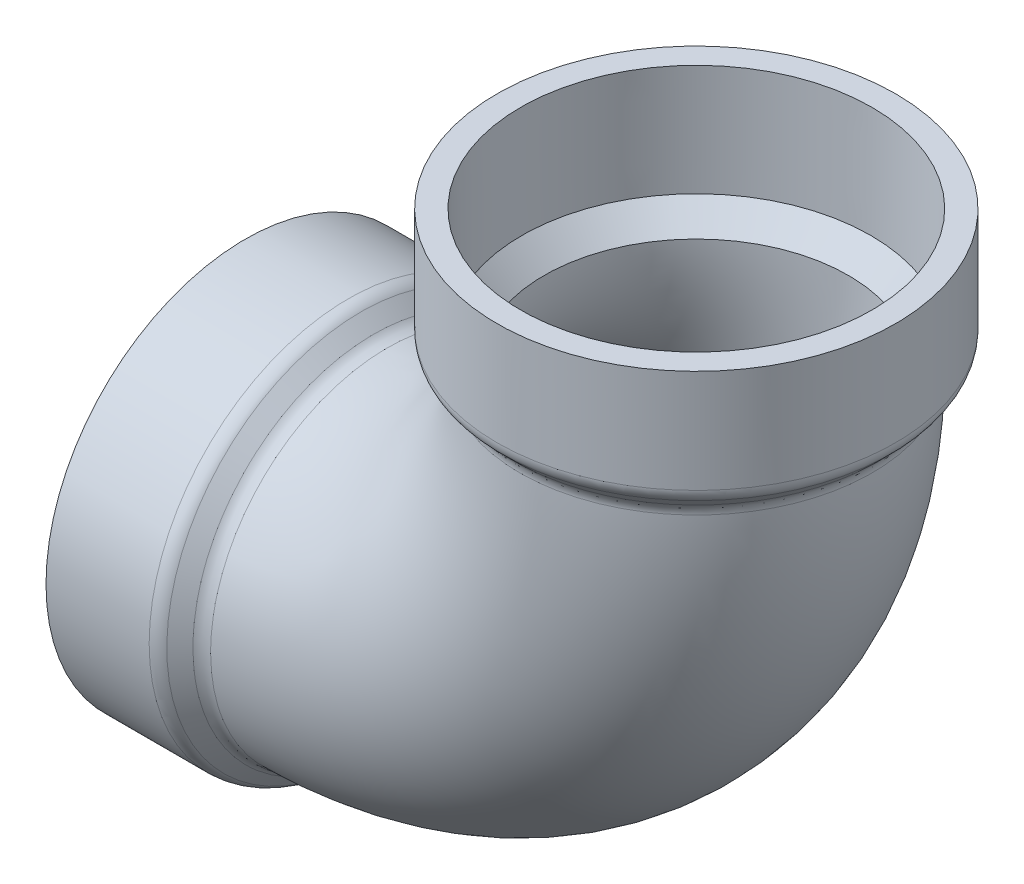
ISO-10303-21;
HEADER;
FILE_DESCRIPTION(('STEP AP214'),'2;1');
FILE_NAME('part.step','',(''),(''),'','','');
FILE_SCHEMA(('AUTOMOTIVE_DESIGN { 1 0 10303 214 1 1 1 1 }'));
ENDSEC;
DATA;
#1=APPLICATION_CONTEXT('core data for automotive mechanical design processes');
#2=APPLICATION_PROTOCOL_DEFINITION('international standard','automotive_design',2000,#1);
#3=PRODUCT_CONTEXT('',#1,'mechanical');
#4=PRODUCT('Part','Part','',(#3));
#5=PRODUCT_RELATED_PRODUCT_CATEGORY('part','',(#4));
#6=PRODUCT_DEFINITION_FORMATION('','',#4);
#7=PRODUCT_DEFINITION_CONTEXT('part definition',#1,'design');
#8=PRODUCT_DEFINITION('design','',#6,#7);
#9=PRODUCT_DEFINITION_SHAPE('','',#8);
#10=(LENGTH_UNIT() NAMED_UNIT(*) SI_UNIT(.MILLI.,.METRE.));
#11=(NAMED_UNIT(*) PLANE_ANGLE_UNIT() SI_UNIT($,.RADIAN.));
#12=(NAMED_UNIT(*) SI_UNIT($,.STERADIAN.) SOLID_ANGLE_UNIT());
#13=UNCERTAINTY_MEASURE_WITH_UNIT(LENGTH_MEASURE(1.E-05),#10,'distance_accuracy_value','');
#14=(GEOMETRIC_REPRESENTATION_CONTEXT(3) GLOBAL_UNCERTAINTY_ASSIGNED_CONTEXT((#13)) GLOBAL_UNIT_ASSIGNED_CONTEXT((#10,
#11,#12)) REPRESENTATION_CONTEXT('',''));
#15=CARTESIAN_POINT('',(0.,0.,0.));
#16=DIRECTION('',(0.,0.,1.));
#17=DIRECTION('',(1.,0.,0.));
#18=AXIS2_PLACEMENT_3D('',#15,#16,#17);
#19=CARTESIAN_POINT('',(-77.7875,-34.3535,0.));
#20=DIRECTION('',(-1.,0.,0.));
#21=DIRECTION('',(0.,0.,1.));
#22=AXIS2_PLACEMENT_3D('',#19,#20,#21);
#23=PLANE('',#22);
#24=CARTESIAN_POINT('',(-77.7875,0.,0.));
#25=DIRECTION('',(-1.,0.,0.));
#26=DIRECTION('',(0.,0.,1.));
#27=AXIS2_PLACEMENT_3D('',#24,#25,#26);
#28=CIRCLE('',#27,34.3535);
#29=CARTESIAN_POINT('',(-77.7875,0.,34.3535));
#30=VERTEX_POINT('',#29);
#31=EDGE_CURVE('E156',#30,#30,#28,.T.);
#32=ORIENTED_EDGE('',*,*,#31,.T.);
#33=EDGE_LOOP('',(#32));
#34=FACE_BOUND('',#33,.T.);
#35=CARTESIAN_POINT('',(-77.7875,0.,0.));
#36=DIRECTION('',(-1.,0.,0.));
#37=DIRECTION('',(0.,0.,1.));
#38=AXIS2_PLACEMENT_3D('',#35,#36,#37);
#39=CIRCLE('',#38,30.2895);
#40=CARTESIAN_POINT('',(-77.7875,0.,30.2895));
#41=VERTEX_POINT('',#40);
#42=EDGE_CURVE('E170',#41,#41,#39,.T.);
#43=ORIENTED_EDGE('',*,*,#42,.F.);
#44=EDGE_LOOP('',(#43));
#45=FACE_BOUND('',#44,.T.);
#46=ADVANCED_FACE('F34',(#34,#45),#23,.T.);
#47=CARTESIAN_POINT('',(-58.7375,0.,0.));
#48=DIRECTION('',(-1.,0.,0.));
#49=DIRECTION('',(0.,0.,1.));
#50=AXIS2_PLACEMENT_3D('',#47,#48,#49);
#51=CONICAL_SURFACE('',#50,30.099,0.00999966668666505);
#52=ORIENTED_EDGE('',*,*,#42,.T.);
#53=EDGE_LOOP('',(#52));
#54=FACE_BOUND('',#53,.T.);
#55=CARTESIAN_POINT('',(-58.7375,0.,0.));
#56=DIRECTION('',(-1.,0.,0.));
#57=DIRECTION('',(0.,0.,1.));
#58=AXIS2_PLACEMENT_3D('',#55,#56,#57);
#59=CIRCLE('',#58,30.099);
#60=CARTESIAN_POINT('',(-58.7375,0.,30.099));
#61=VERTEX_POINT('',#60);
#62=EDGE_CURVE('E161',#61,#61,#59,.T.);
#63=ORIENTED_EDGE('',*,*,#62,.F.);
#64=EDGE_LOOP('',(#63));
#65=FACE_BOUND('',#64,.T.);
#66=ADVANCED_FACE('F95',(#54,#65),#51,.F.);
#67=CARTESIAN_POINT('',(-54.6989,0.,0.));
#68=DIRECTION('',(-1.,0.,0.));
#69=DIRECTION('',(0.,0.,1.));
#70=AXIS2_PLACEMENT_3D('',#67,#68,#69);
#71=CONICAL_SURFACE('',#70,26.2509,0.761248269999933);
#72=ORIENTED_EDGE('',*,*,#62,.T.);
#73=EDGE_LOOP('',(#72));
#74=FACE_BOUND('',#73,.T.);
#75=CARTESIAN_POINT('',(-54.6989,0.,0.));
#76=DIRECTION('',(-1.,0.,0.));
#77=DIRECTION('',(0.,0.,1.));
#78=AXIS2_PLACEMENT_3D('',#75,#76,#77);
#79=CIRCLE('',#78,26.2509);
#80=CARTESIAN_POINT('',(-54.6989,-26.2509,0.));
#81=VERTEX_POINT('',#80);
#82=EDGE_CURVE('E157',#81,#81,#79,.T.);
#83=ORIENTED_EDGE('',*,*,#82,.F.);
#84=EDGE_LOOP('',(#83));
#85=FACE_BOUND('',#84,.T.);
#86=ADVANCED_FACE('F91',(#74,#85),#71,.F.);
#87=CARTESIAN_POINT('',(-58.7375,0.,0.));
#88=DIRECTION('',(-1.,0.,0.));
#89=DIRECTION('',(0.,0.,1.));
#90=AXIS2_PLACEMENT_3D('',#87,#88,#89);
#91=CONICAL_SURFACE('',#90,34.3535,0.785398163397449);
#92=CARTESIAN_POINT('',(-57.8447614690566,0.,0.));
#93=DIRECTION('',(1.,0.,0.));
#94=DIRECTION('',(0.,0.,-1.));
#95=AXIS2_PLACEMENT_3D('',#92,#93,#94);
#96=CIRCLE('',#95,33.4607614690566);
#97=CARTESIAN_POINT('',(-57.8447614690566,0.,-33.4607614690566));
#98=VERTEX_POINT('',#97);
#99=EDGE_CURVE('E10',#98,#98,#96,.T.);
#100=ORIENTED_EDGE('',*,*,#99,.T.);
#101=EDGE_LOOP('',(#100));
#102=FACE_BOUND('',#101,.T.);
#103=CARTESIAN_POINT('',(-53.4437974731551,-4.36847136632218,-29.9965489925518));
#104=CARTESIAN_POINT('',(-54.7008354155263,-4.3694859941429,-30.0003017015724));
#105=CARTESIAN_POINT('',(-55.5896995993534,-4.49826067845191,-30.8797885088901));
#106=CARTESIAN_POINT('',(-53.442484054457,-3.52489103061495,-30.1197447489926));
#107=CARTESIAN_POINT('',(-54.7004940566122,-3.52562310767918,-30.1228637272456));
#108=CARTESIAN_POINT('',(-55.5900441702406,-3.62988015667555,-31.0066337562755));
#109=CARTESIAN_POINT('',(-53.4411019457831,-2.67611039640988,-30.2073508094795));
#110=CARTESIAN_POINT('',(-54.7001344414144,-2.67669423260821,-30.2097666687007));
#111=CARTESIAN_POINT('',(-55.590406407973,-2.75614718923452,-31.0968427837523));
#112=CARTESIAN_POINT('',(-53.4381880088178,-0.974180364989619,-30.3107659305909));
#113=CARTESIAN_POINT('',(-54.6993751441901,-0.974613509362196,-30.3116998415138));
#114=CARTESIAN_POINT('',(-55.5911692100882,-1.00418607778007,-31.2033523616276));
#115=CARTESIAN_POINT('',(-53.4366561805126,-0.12103096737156,-30.3265749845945));
#116=CARTESIAN_POINT('',(-54.6989754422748,-0.12143843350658,-30.3267134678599));
#117=CARTESIAN_POINT('',(-55.5915697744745,-0.125957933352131,-31.2196529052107));
#118=CARTESIAN_POINT('',(-53.4334298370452,1.58357604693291,-30.2862891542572));
#119=CARTESIAN_POINT('',(-54.698132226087,1.58305190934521,-30.2847737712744));
#120=CARTESIAN_POINT('',(-55.5924123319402,1.62875412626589,-31.1782350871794));
#121=CARTESIAN_POINT('',(-53.4317353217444,2.43503366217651,-30.2301942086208));
#122=CARTESIAN_POINT('',(-54.6976886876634,2.43439089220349,-30.2277998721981));
#123=CARTESIAN_POINT('',(-55.5928543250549,2.50523803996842,-31.1205166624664));
#124=CARTESIAN_POINT('',(-53.4281703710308,4.13020881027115,-30.0465045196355));
#125=CARTESIAN_POINT('',(-54.6967538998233,4.12913835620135,-30.0423057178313));
#126=CARTESIAN_POINT('',(-55.5937828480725,4.25023467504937,-30.931476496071));
#127=CARTESIAN_POINT('',(-53.4262999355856,4.97392634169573,-29.9189097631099));
#128=CARTESIAN_POINT('',(-54.6962626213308,4.97257058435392,-29.9137606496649));
#129=CARTESIAN_POINT('',(-55.5942693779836,5.11874739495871,-30.8001547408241));
#130=CARTESIAN_POINT('',(-53.4223696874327,6.64785272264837,-29.5930893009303));
#131=CARTESIAN_POINT('',(-54.6952283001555,6.64571399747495,-29.5860134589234));
#132=CARTESIAN_POINT('',(-55.5952900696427,6.84186242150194,-30.4648017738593));
#133=CARTESIAN_POINT('',(-53.4203098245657,7.47805792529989,-29.3948448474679));
#134=CARTESIAN_POINT('',(-54.6946852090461,7.47544458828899,-29.3867631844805));
#135=CARTESIAN_POINT('',(-55.5958242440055,7.69646097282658,-30.260751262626));
#136=CARTESIAN_POINT('',(-53.4159893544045,9.11883350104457,-28.929145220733));
#137=CARTESIAN_POINT('',(-54.6935436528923,9.11503795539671,-28.9190516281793));
#138=CARTESIAN_POINT('',(-55.5969426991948,9.38544019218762,-29.78140210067));
#139=CARTESIAN_POINT('',(-53.4137287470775,9.92940387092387,-28.661690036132));
#140=CARTESIAN_POINT('',(-54.69294514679,9.92492254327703,-28.6505561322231));
#141=CARTESIAN_POINT('',(-55.5975269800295,10.2198208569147,-29.5061034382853));
#142=CARTESIAN_POINT('',(-53.4089973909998,11.5251554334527,-28.0594740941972));
#143=CARTESIAN_POINT('',(-54.6916895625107,11.5190517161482,-28.0462901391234));
#144=CARTESIAN_POINT('',(-55.5987475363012,11.8624393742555,-28.8862183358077));
#145=CARTESIAN_POINT('',(-53.4065266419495,12.3103365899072,-27.724713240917));
#146=CARTESIAN_POINT('',(-54.6910324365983,12.3033157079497,-27.7104805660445));
#147=CARTESIAN_POINT('',(-55.5993838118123,12.6706771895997,-28.5416317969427));
#148=CARTESIAN_POINT('',(-53.4013697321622,13.8497346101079,-26.9902688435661));
#149=CARTESIAN_POINT('',(-54.689657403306,13.8406152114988,-26.9740058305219));
#150=CARTESIAN_POINT('',(-55.6007091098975,14.2552694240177,-27.7856229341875));
#151=CARTESIAN_POINT('',(-53.39868357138,14.6039514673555,-26.5905852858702));
#152=CARTESIAN_POINT('',(-54.6889394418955,14.5936665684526,-26.5732972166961));
#153=CARTESIAN_POINT('',(-55.6013981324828,15.0316238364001,-27.3742005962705));
#154=CARTESIAN_POINT('',(-53.3930961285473,16.0762960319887,-25.729003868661));
#155=CARTESIAN_POINT('',(-54.6874419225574,16.0634091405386,-25.7097746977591));
#156=CARTESIAN_POINT('',(-55.6028281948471,16.5471720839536,-26.4873070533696));
#157=CARTESIAN_POINT('',(-53.3901947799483,16.794412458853,-25.2670867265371));
#158=CARTESIAN_POINT('',(-54.6866622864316,16.7800997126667,-25.2468944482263));
#159=CARTESIAN_POINT('',(-55.6035692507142,17.286354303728,-26.011815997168));
#160=CARTESIAN_POINT('',(-53.3841882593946,18.1892040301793,-24.2844177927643));
#161=CARTESIAN_POINT('',(-54.6850435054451,18.1717720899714,-24.262456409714));
#162=CARTESIAN_POINT('',(-55.6050998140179,18.7220471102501,-25.000262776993));
#163=CARTESIAN_POINT('',(-53.3810830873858,18.8658791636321,-23.7636659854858));
#164=CARTESIAN_POINT('',(-54.684204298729,18.8467580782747,-23.7408491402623));
#165=CARTESIAN_POINT('',(-55.6058893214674,19.4185576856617,-24.4642005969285));
#166=CARTESIAN_POINT('',(-53.3746924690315,20.1729821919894,-22.6670260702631));
#167=CARTESIAN_POINT('',(-54.6824718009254,20.1502323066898,-22.6427071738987));
#168=CARTESIAN_POINT('',(-55.6075101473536,20.7639586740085,-23.3353108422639));
#169=CARTESIAN_POINT('',(-53.3714070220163,20.8034099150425,-22.0911377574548));
#170=CARTESIAN_POINT('',(-54.6815784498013,20.778716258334,-22.0661227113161));
#171=CARTESIAN_POINT('',(-55.6083414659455,21.4128489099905,-22.7424830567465));
#172=CARTESIAN_POINT('',(-53.3646964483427,22.013532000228,-20.8883164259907));
#173=CARTESIAN_POINT('',(-54.6797478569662,21.98473501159,-20.862171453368));
#174=CARTESIAN_POINT('',(-55.61003508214,22.6583905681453,-21.5042725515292));
#175=CARTESIAN_POINT('',(-53.3612713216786,22.5932263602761,-20.2613834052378));
#176=CARTESIAN_POINT('',(-54.6788105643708,22.5622558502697,-20.2347581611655));
#177=CARTESIAN_POINT('',(-55.6108973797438,23.2550419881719,-20.8588898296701));
#178=CARTESIAN_POINT('',(-53.3543425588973,23.6978223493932,-18.9608421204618));
#179=CARTESIAN_POINT('',(-54.6769082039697,23.6623453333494,-18.9335699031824));
#180=CARTESIAN_POINT('',(-55.6126371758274,24.3919277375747,-19.5200659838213));
#181=CARTESIAN_POINT('',(-53.3508389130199,24.2227171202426,-18.2872280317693));
#182=CARTESIAN_POINT('',(-54.6759431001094,24.1848821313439,-18.25974997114));
#183=CARTESIAN_POINT('',(-55.6135146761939,24.9321550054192,-18.8266188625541));
#184=CARTESIAN_POINT('',(-53.3438393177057,25.2138836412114,-16.8981770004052));
#185=CARTESIAN_POINT('',(-54.6740086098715,25.1712550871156,-16.870644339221));
#186=CARTESIAN_POINT('',(-55.6152631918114,25.9522516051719,-17.3966600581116));
#187=CARTESIAN_POINT('',(-53.3403433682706,25.6801553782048,-16.1827400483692));
#188=CARTESIAN_POINT('',(-54.6730392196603,25.6350550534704,-16.1553318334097));
#189=CARTESIAN_POINT('',(-55.6161342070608,26.4321209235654,-16.6601483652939));
#190=CARTESIAN_POINT('',(-53.3334701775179,26.5507348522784,-14.7151259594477));
#191=CARTESIAN_POINT('',(-54.6711272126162,26.5007209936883,-14.6883515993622));
#192=CARTESIAN_POINT('',(-55.6178423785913,27.3280665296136,-15.1492916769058));
#193=CARTESIAN_POINT('',(-53.3300929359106,26.9550427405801,-13.9629489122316));
#194=CARTESIAN_POINT('',(-54.67018463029,26.90254067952,-13.9366753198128));
#195=CARTESIAN_POINT('',(-55.618679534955,27.7441429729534,-14.3749467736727));
#196=CARTESIAN_POINT('',(-53.3235908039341,27.6987872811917,-12.4271978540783));
#197=CARTESIAN_POINT('',(-54.6683644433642,27.6414693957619,-12.4023146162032));
#198=CARTESIAN_POINT('',(-55.6202875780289,28.5095165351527,-12.7939237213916));
#199=CARTESIAN_POINT('',(-53.3204659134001,28.0382239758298,-11.643623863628));
#200=CARTESIAN_POINT('',(-54.6674869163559,27.9785244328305,-11.6196452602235));
#201=CARTESIAN_POINT('',(-55.6210584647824,28.8588136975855,-11.9872455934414));
#202=CARTESIAN_POINT('',(-53.3146190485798,28.6495826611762,-10.0511441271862));
#203=CARTESIAN_POINT('',(-54.6658406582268,28.58542670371,-10.0293349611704));
#204=CARTESIAN_POINT('',(-55.6224979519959,29.4879161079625,-10.3478002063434));
#205=CARTESIAN_POINT('',(-53.3118968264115,28.9215462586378,-9.24225434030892));
#206=CARTESIAN_POINT('',(-54.6650719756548,28.8552584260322,-9.22175237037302));
#207=CARTESIAN_POINT('',(-55.623166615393,29.7677641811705,-9.51504938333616));
#208=CARTESIAN_POINT('',(-53.3070034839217,29.3962554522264,-7.60443460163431));
#209=CARTESIAN_POINT('',(-54.6636872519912,29.3261537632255,-7.58684186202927));
#210=CARTESIAN_POINT('',(-55.6243666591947,30.2562247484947,-7.82890723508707));
#211=CARTESIAN_POINT('',(-53.304832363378,29.5990010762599,-6.7755046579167));
#212=CARTESIAN_POINT('',(-54.6630713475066,29.5271634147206,-6.75958618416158));
#213=CARTESIAN_POINT('',(-55.6248980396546,30.4648372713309,-6.97551591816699));
#214=CARTESIAN_POINT('',(-53.3011761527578,29.9337913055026,-5.10351523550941));
#215=CARTESIAN_POINT('',(-54.6620325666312,29.8590569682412,-5.09113812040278));
#216=CARTESIAN_POINT('',(-55.6257919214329,30.8093097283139,-5.25417967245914));
#217=CARTESIAN_POINT('',(-53.2996910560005,30.0658365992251,-4.26045589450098));
#218=CARTESIAN_POINT('',(-54.6616098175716,29.9898974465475,-4.25004519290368));
#219=CARTESIAN_POINT('',(-55.6261544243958,30.9451703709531,-4.38623488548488));
#220=CARTESIAN_POINT('',(-53.2975070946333,30.2582594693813,-2.566210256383));
#221=CARTESIAN_POINT('',(-54.6609876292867,30.1805717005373,-2.559794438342));
#222=CARTESIAN_POINT('',(-55.6266872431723,31.1431515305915,-2.64197410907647));
#223=CARTESIAN_POINT('',(-53.2968082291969,30.3186371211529,-1.71502396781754));
#224=CARTESIAN_POINT('',(-54.6607882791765,30.2403776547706,-1.71075646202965));
#225=CARTESIAN_POINT('',(-55.6268575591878,31.2052721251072,-1.76565812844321));
#226=CARTESIAN_POINT('',(-53.296246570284,30.3672468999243,-0.0117678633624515));
#227=CARTESIAN_POINT('',(-54.6606280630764,30.2885355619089,-0.0117117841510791));
#228=CARTESIAN_POINT('',(-55.6269944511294,31.2552852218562,-0.0121154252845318));
#229=CARTESIAN_POINT('',(-53.2963826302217,30.3555779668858,0.840299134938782));
#230=CARTESIAN_POINT('',(-54.6606668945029,30.2769781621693,0.838162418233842));
#231=CARTESIAN_POINT('',(-55.6269613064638,31.2432795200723,0.865108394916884));
#232=CARTESIAN_POINT('',(-53.2974784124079,30.2604118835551,2.54041824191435));
#233=CARTESIAN_POINT('',(-54.6609793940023,30.1826928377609,2.53411599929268));
#234=CARTESIAN_POINT('',(-55.6266941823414,31.1453657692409,2.61542041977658));
#235=CARTESIAN_POINT('',(-53.2984381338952,30.1769147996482,3.3884703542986));
#236=CARTESIAN_POINT('',(-54.6612530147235,30.0999792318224,3.38006785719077));
#237=CARTESIAN_POINT('',(-55.6264602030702,31.0594577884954,3.48850862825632));
#238=CARTESIAN_POINT('',(-53.3011142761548,29.93870509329,5.07452937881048));
#239=CARTESIAN_POINT('',(-54.6620148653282,29.8639062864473,5.06226022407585));
#240=CARTESIAN_POINT('',(-55.625806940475,30.8143649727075,5.22433805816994));
#241=CARTESIAN_POINT('',(-53.302830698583,29.7839923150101,5.91253626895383));
#242=CARTESIAN_POINT('',(-54.6625029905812,29.7105803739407,5.89838698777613));
#243=CARTESIAN_POINT('',(-55.6253876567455,30.6551799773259,6.08707925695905));
#244=CARTESIAN_POINT('',(-53.3069073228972,29.404482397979,7.57254785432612));
#245=CARTESIAN_POINT('',(-54.6636598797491,29.3342853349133,7.55504855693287));
#246=CARTESIAN_POINT('',(-55.6243901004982,30.2646891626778,7.79607944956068));
#247=CARTESIAN_POINT('',(-53.309267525,29.1796852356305,8.39455254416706));
#248=CARTESIAN_POINT('',(-54.6643285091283,29.1113640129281,8.37549259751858));
#249=CARTESIAN_POINT('',(-55.6238118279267,30.0333833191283,8.64233843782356));
#250=CARTESIAN_POINT('',(-53.3144897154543,28.6617003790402,10.0165409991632));
#251=CARTESIAN_POINT('',(-54.6658040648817,28.5974229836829,9.99480442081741));
#252=CARTESIAN_POINT('',(-55.6225296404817,29.500384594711,10.3121763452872));
#253=CARTESIAN_POINT('',(-53.3173515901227,28.3685281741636,10.8165297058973));
#254=CARTESIAN_POINT('',(-54.6666108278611,28.3064741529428,10.7936143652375));
#255=CARTESIAN_POINT('',(-55.6218257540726,29.1987076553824,11.1357603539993));
#256=CARTESIAN_POINT('',(-53.32342663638,27.7158845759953,12.3890112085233));
#257=CARTESIAN_POINT('',(-54.6683183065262,27.6584220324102,12.3641771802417));
#258=CARTESIAN_POINT('',(-55.6203280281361,28.5271101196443,12.7546112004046));
#259=CARTESIAN_POINT('',(-53.3266398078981,27.3564131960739,13.1615040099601));
#260=CARTESIAN_POINT('',(-54.6692189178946,27.301375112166,13.1358965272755));
#261=CARTESIAN_POINT('',(-55.6195341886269,28.1571895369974,13.5498780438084));
#262=CARTESIAN_POINT('',(-53.3332732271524,26.573762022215,14.6735118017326));
#263=CARTESIAN_POINT('',(-54.6710722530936,26.523586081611,14.6467603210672));
#264=CARTESIAN_POINT('',(-55.6178911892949,27.3517637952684,15.1064512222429));
#265=CARTESIAN_POINT('',(-53.3366934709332,26.150583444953,15.4130274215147));
#266=CARTESIAN_POINT('',(-54.6720249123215,26.1028968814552,15.3858983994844));
#267=CARTESIAN_POINT('',(-55.6170420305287,26.916259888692,15.8677582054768));
#268=CARTESIAN_POINT('',(-53.3436148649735,25.2435389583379,16.8538667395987));
#269=CARTESIAN_POINT('',(-54.6739464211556,25.2007384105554,16.8263295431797));
#270=CARTESIAN_POINT('',(-55.6153191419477,25.9827717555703,17.351044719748));
#271=CARTESIAN_POINT('',(-53.3471160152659,24.7596730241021,17.5551904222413));
#272=CARTESIAN_POINT('',(-54.6749152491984,24.7193122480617,17.5276374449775));
#273=CARTESIAN_POINT('',(-55.6144454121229,25.4847875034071,18.0730242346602));
#274=CARTESIAN_POINT('',(-53.3541010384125,23.7340645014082,18.9155309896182));
#275=CARTESIAN_POINT('',(-54.6768417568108,23.6984161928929,18.8882272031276));
#276=CARTESIAN_POINT('',(-55.6126977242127,24.4292287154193,19.4734209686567));
#277=CARTESIAN_POINT('',(-53.3575848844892,23.1922509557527,19.5744943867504));
#278=CARTESIAN_POINT('',(-54.6777994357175,23.1589073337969,19.5474875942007));
#279=CARTESIAN_POINT('',(-55.6118237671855,23.8715811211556,20.1517831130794));
#280=CARTESIAN_POINT('',(-53.3644531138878,22.0550965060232,20.8444968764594));
#281=CARTESIAN_POINT('',(-54.6796813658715,22.0261404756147,20.8182980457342));
#282=CARTESIAN_POINT('',(-55.610096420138,22.701171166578,21.4591636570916));
#283=CARTESIAN_POINT('',(-53.367837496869,21.4597554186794,21.4555358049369));
#284=CARTESIAN_POINT('',(-54.680605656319,21.43290367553,21.4298898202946));
#285=CARTESIAN_POINT('',(-55.6092430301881,22.0884086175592,22.0881818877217));
#286=CARTESIAN_POINT('',(-53.3744527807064,20.2196755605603,22.6254523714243));
#287=CARTESIAN_POINT('',(-54.682406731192,20.1967830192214,22.601062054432));
#288=CARTESIAN_POINT('',(-55.6075708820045,20.8120197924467,23.2925144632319));
#289=CARTESIAN_POINT('',(-53.3776836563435,19.5749287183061,23.1843214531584));
#290=CARTESIAN_POINT('',(-54.6832835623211,19.55390173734,23.1606817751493));
#291=CARTESIAN_POINT('',(-55.6067521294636,20.148385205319,23.8678199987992));
#292=CARTESIAN_POINT('',(-53.3839564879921,18.2407080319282,24.245815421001));
#293=CARTESIAN_POINT('',(-54.6849809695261,18.2231523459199,24.2237698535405));
#294=CARTESIAN_POINT('',(-55.6051588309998,18.7750611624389,24.9605256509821));
#295=CARTESIAN_POINT('',(-53.386998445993,17.5512346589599,24.7484408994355));
#296=CARTESIAN_POINT('',(-54.6858016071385,17.5352860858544,24.7272885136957));
#297=CARTESIAN_POINT('',(-55.6043842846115,18.0653721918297,25.4779263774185));
#298=CARTESIAN_POINT('',(-53.3928778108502,16.1316166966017,25.6944386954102));
#299=CARTESIAN_POINT('',(-54.6873833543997,16.1186278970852,25.6751174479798));
#300=CARTESIAN_POINT('',(-55.6028840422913,16.6041158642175,26.4517263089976));
#301=CARTESIAN_POINT('',(-53.3957149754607,15.4014256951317,26.1377413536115));
#302=CARTESIAN_POINT('',(-54.6881444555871,15.3897824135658,26.1194073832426));
#303=CARTESIAN_POINT('',(-55.6021584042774,15.8525007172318,26.9080537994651));
#304=CARTESIAN_POINT('',(-53.4011735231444,13.9063011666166,26.961249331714));
#305=CARTESIAN_POINT('',(-54.6896050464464,13.89710409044,26.9448934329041));
#306=CARTESIAN_POINT('',(-55.600759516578,14.3134965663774,27.7557512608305));
#307=CARTESIAN_POINT('',(-53.403794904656,13.1413673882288,27.3414541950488));
#308=CARTESIAN_POINT('',(-54.6903045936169,13.1332584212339,27.3261353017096));
#309=CARTESIAN_POINT('',(-55.6000862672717,13.5261073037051,28.1471207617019));
#310=CARTESIAN_POINT('',(-53.4088213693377,11.582687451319,28.035826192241));
#311=CARTESIAN_POINT('',(-54.6916428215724,11.5765269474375,28.0225515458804));
#312=CARTESIAN_POINT('',(-55.5987929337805,11.9216610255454,28.8618764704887));
#313=CARTESIAN_POINT('',(-53.4112265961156,10.7889609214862,28.3500373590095));
#314=CARTESIAN_POINT('',(-54.6922815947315,10.7836440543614,28.3378120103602));
#315=CARTESIAN_POINT('',(-55.5981728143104,11.1046242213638,29.1853080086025));
#316=CARTESIAN_POINT('',(-53.4158287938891,9.17812593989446,28.9104371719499));
#317=CARTESIAN_POINT('',(-54.6935012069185,9.17429124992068,28.9002558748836));
#318=CARTESIAN_POINT('',(-55.5969842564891,9.44647451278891,29.762145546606));
#319=CARTESIAN_POINT('',(-53.4180258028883,8.36102179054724,29.156638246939));
#320=CARTESIAN_POINT('',(-54.6940821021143,8.35780537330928,29.1474892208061));
#321=CARTESIAN_POINT('',(-55.5964158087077,8.60536603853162,30.0155643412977));
#322=CARTESIAN_POINT('',(-53.4232469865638,6.30565624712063,29.6824964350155));
#323=CARTESIAN_POINT('',(-54.695459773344,6.30393232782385,29.675775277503));
#324=CARTESIAN_POINT('',(-55.5950628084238,6.48961217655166,30.5568285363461));
#325=CARTESIAN_POINT('',(-53.4261519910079,5.05635074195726,29.9199080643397));
#326=CARTESIAN_POINT('',(-54.6962239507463,5.05514768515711,29.914672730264));
#327=CARTESIAN_POINT('',(-55.5943080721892,5.20359471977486,30.8011849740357));
#328=CARTESIAN_POINT('',(-53.431565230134,2.53818438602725,30.2363545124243));
#329=CARTESIAN_POINT('',(-54.6976443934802,2.53771996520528,30.2338457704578));
#330=CARTESIAN_POINT('',(-55.5928989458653,2.61142128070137,31.1268614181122));
#331=CARTESIAN_POINT('',(-53.4340735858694,1.26932963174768,30.3154377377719));
#332=CARTESIAN_POINT('',(-54.6983007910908,1.269005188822,30.3142546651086));
#333=CARTESIAN_POINT('',(-55.5922445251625,1.30527157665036,31.2082312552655));
#334=CARTESIAN_POINT('',(-53.4377852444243,-0.749702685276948,30.3145768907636));
#335=CARTESIAN_POINT('',(-54.6992700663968,-0.750149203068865,30.3152973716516));
#336=CARTESIAN_POINT('',(-55.5912745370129,-0.773109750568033,31.2072823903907));
#337=CARTESIAN_POINT('',(-53.4391034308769,-1.50026307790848,30.2863548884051));
#338=CARTESIAN_POINT('',(-54.6996138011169,-1.50075539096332,30.2877556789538));
#339=CARTESIAN_POINT('',(-55.5909296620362,-1.54573366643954,31.1782070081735));
#340=CARTESIAN_POINT('',(-53.4416256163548,-2.99736487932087,30.1743187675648));
#341=CARTESIAN_POINT('',(-54.7002707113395,-2.99802536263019,30.1769976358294));
#342=CARTESIAN_POINT('',(-55.5902691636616,-3.08684585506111,31.0628292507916));
#343=CARTESIAN_POINT('',(-53.4428296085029,-3.74390604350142,30.0905013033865));
#344=CARTESIAN_POINT('',(-54.7005838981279,-3.74470464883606,30.0937888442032));
#345=CARTESIAN_POINT('',(-55.5899535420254,-3.85533387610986,30.976523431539));
#346=CARTESIAN_POINT('',(-53.4451322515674,-5.22920526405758,29.867632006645));
#347=CARTESIAN_POINT('',(-54.7011822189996,-5.23034313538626,29.8720523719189));
#348=CARTESIAN_POINT('',(-55.5893493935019,-5.3842991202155,30.7470532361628));
#349=CARTESIAN_POINT('',(-53.4462308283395,-5.96795752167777,29.7285416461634));
#350=CARTESIAN_POINT('',(-54.701467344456,-5.96931198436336,29.7334949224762));
#351=CARTESIAN_POINT('',(-55.589060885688,-6.14477037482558,30.6038491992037));
#352=CARTESIAN_POINT('',(-53.448329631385,-7.43310379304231,29.3959016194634));
#353=CARTESIAN_POINT('',(-54.7020115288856,-7.43494161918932,29.4018353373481));
#354=CARTESIAN_POINT('',(-55.5885092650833,-7.65299214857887,30.2613805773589));
#355=CARTESIAN_POINT('',(-53.4493298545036,-8.15949740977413,29.2023502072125));
#356=CARTESIAN_POINT('',(-54.7022705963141,-8.16161667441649,29.2087383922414));
#357=CARTESIAN_POINT('',(-55.588246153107,-8.40074225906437,30.0621141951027));
#358=CARTESIAN_POINT('',(-53.4513679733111,-9.6927459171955,28.7321382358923));
#359=CARTESIAN_POINT('',(-54.702798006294,-9.6954899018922,28.7394110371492));
#360=CARTESIAN_POINT('',(-55.5877096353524,-9.97907002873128,29.5780255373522));
#361=CARTESIAN_POINT('',(-53.4523927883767,-10.4972557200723,28.4477937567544));
#362=CARTESIAN_POINT('',(-54.7030629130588,-10.5003843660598,28.4554865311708));
#363=CARTESIAN_POINT('',(-55.5874396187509,-10.8072337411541,29.2852934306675));
#364=CARTESIAN_POINT('',(-53.4543350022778,-12.0795050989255,27.8123209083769));
#365=CARTESIAN_POINT('',(-54.7035645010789,-12.0834333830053,27.8207456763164));
#366=CARTESIAN_POINT('',(-55.5869275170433,-12.4360043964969,28.6310819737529));
#367=CARTESIAN_POINT('',(-53.4552523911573,-12.8572421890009,27.4611863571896));
#368=CARTESIAN_POINT('',(-54.7038011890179,-12.8616045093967,27.4699283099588));
#369=CARTESIAN_POINT('',(-55.5866854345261,-13.2366087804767,28.2695962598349));
#370=CARTESIAN_POINT('',(-53.4569886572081,-14.3805159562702,26.6945631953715));
#371=CARTESIAN_POINT('',(-54.7042487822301,-14.3857618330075,26.7038355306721));
#372=CARTESIAN_POINT('',(-55.586226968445,-14.8046707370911,27.4803789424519));
#373=CARTESIAN_POINT('',(-53.4578075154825,-15.1260464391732,26.2790622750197));
#374=CARTESIAN_POINT('',(-54.7044596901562,-15.1317595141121,26.2885507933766));
#375=CARTESIAN_POINT('',(-55.5860105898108,-15.5721219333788,27.0526346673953));
#376=CARTESIAN_POINT('',(-53.4593543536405,-16.5794173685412,25.3867209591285));
#377=CARTESIAN_POINT('',(-54.7048578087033,-16.5860666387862,25.3965427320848));
#378=CARTESIAN_POINT('',(-55.5856016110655,-17.0682263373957,26.134003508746));
#379=CARTESIAN_POINT('',(-53.4600823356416,-17.287258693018,24.9098819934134));
#380=CARTESIAN_POINT('',(-54.705045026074,-17.2943931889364,24.9198219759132));
#381=CARTESIAN_POINT('',(-55.5854090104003,-17.7968804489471,25.6431180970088));
#382=CARTESIAN_POINT('',(-53.4614542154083,-18.6600325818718,23.8983960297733));
#383=CARTESIAN_POINT('',(-54.7053976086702,-18.6681268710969,23.9084792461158));
#384=CARTESIAN_POINT('',(-55.585045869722,-19.2100184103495,24.6018399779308));
#385=CARTESIAN_POINT('',(-53.4620981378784,-19.3249777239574,23.3637661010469));
#386=CARTESIAN_POINT('',(-54.705562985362,-19.3335613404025,23.3738738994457));
#387=CARTESIAN_POINT('',(-55.5848753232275,-19.894515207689,24.0514648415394));
#388=CARTESIAN_POINT('',(-53.4633082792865,-20.6074598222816,22.2403802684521));
#389=CARTESIAN_POINT('',(-54.7058736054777,-20.6170004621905,22.2504509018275));
#390=CARTESIAN_POINT('',(-55.5845546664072,-21.2147067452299,22.894997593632));
#391=CARTESIAN_POINT('',(-53.463874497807,-21.2249965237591,21.6516240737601));
#392=CARTESIAN_POINT('',(-54.7060188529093,-21.2350182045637,21.6616310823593));
#393=CARTESIAN_POINT('',(-55.5844045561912,-21.85040122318,22.2889051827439));
#394=CARTESIAN_POINT('',(-53.4649345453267,-22.4082325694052,20.4242071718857));
#395=CARTESIAN_POINT('',(-54.7062906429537,-22.4191847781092,20.4340080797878));
#396=CARTESIAN_POINT('',(-55.5841234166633,-23.0684286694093,21.0253489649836));
#397=CARTESIAN_POINT('',(-53.4654283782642,-22.9739347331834,19.7855491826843));
#398=CARTESIAN_POINT('',(-54.7064171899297,-22.9853483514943,19.7952045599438));
#399=CARTESIAN_POINT('',(-55.5839923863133,-23.650764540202,20.3678879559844));
#400=CARTESIAN_POINT('',(-53.4663483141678,-24.0495146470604,18.4628421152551));
#401=CARTESIAN_POINT('',(-54.7066528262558,-24.0618108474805,18.4721356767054));
#402=CARTESIAN_POINT('',(-55.5837482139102,-24.7579704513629,19.0062406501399));
#403=CARTESIAN_POINT('',(-53.466774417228,-24.5593924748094,17.7787931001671));
#404=CARTESIAN_POINT('',(-54.7067619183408,-24.5721203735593,17.7878663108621));
#405=CARTESIAN_POINT('',(-55.5836350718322,-25.2828405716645,18.3020544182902));
#406=CARTESIAN_POINT('',(-53.4675627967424,-25.5196342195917,16.3702596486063));
#407=CARTESIAN_POINT('',(-54.7069636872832,-25.5331776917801,16.3788300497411));
#408=CARTESIAN_POINT('',(-55.5834256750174,-26.2713169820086,16.8520580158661));
#409=CARTESIAN_POINT('',(-53.4679250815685,-25.9700059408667,15.645780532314));
#410=CARTESIAN_POINT('',(-54.707056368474,-25.9839424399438,15.6540635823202));
#411=CARTESIAN_POINT('',(-55.5833294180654,-26.734931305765,16.1062533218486));
#412=CARTESIAN_POINT('',(-53.4685892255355,-26.8081110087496,14.1614552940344));
#413=CARTESIAN_POINT('',(-54.7072262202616,-26.8227794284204,14.1691105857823));
#414=CARTESIAN_POINT('',(-55.5831529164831,-27.5976797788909,14.5782373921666));
#415=CARTESIAN_POINT('',(-53.4688910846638,-27.1958443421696,13.4016091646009));
#416=CARTESIAN_POINT('',(-54.7073033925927,-27.2108594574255,13.4089184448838));
#417=CARTESIAN_POINT('',(-55.583072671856,-27.9968139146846,13.796026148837));
#418=CARTESIAN_POINT('',(-53.4694371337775,-27.9059179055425,11.8519452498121));
#419=CARTESIAN_POINT('',(-54.7074429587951,-27.9215670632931,11.8585188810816));
#420=CARTESIAN_POINT('',(-55.5829274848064,-28.7277662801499,12.2007510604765));
#421=CARTESIAN_POINT('',(-53.4696813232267,-28.2282575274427,11.0621271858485));
#422=CARTESIAN_POINT('',(-54.7075053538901,-28.2442005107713,11.0683050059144));
#423=CARTESIAN_POINT('',(-55.5828625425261,-29.0595838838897,11.3876869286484));
#424=CARTESIAN_POINT('',(-53.470114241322,-28.8052462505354,9.45814204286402));
#425=CARTESIAN_POINT('',(-54.7076159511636,-28.8217134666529,9.4634943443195));
#426=CARTESIAN_POINT('',(-55.5827473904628,-29.6535382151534,9.73649397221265));
#427=CARTESIAN_POINT('',(-53.4703029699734,-29.0598953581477,8.64397496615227));
#428=CARTESIAN_POINT('',(-54.7076641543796,-29.0765981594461,8.64889093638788));
#429=CARTESIAN_POINT('',(-55.5826971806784,-29.9156749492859,8.89836514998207));
#430=CARTESIAN_POINT('',(-53.4706266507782,-29.4996714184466,6.99715693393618));
#431=CARTESIAN_POINT('',(-54.7077468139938,-29.5167790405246,7.00117633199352));
#432=CARTESIAN_POINT('',(-55.5826110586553,-30.3683820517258,7.20308034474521));
#433=CARTESIAN_POINT('',(-53.470761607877,-29.6848047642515,6.16450768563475));
#434=CARTESIAN_POINT('',(-54.7077812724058,-29.7020855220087,6.16805988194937));
#435=CARTESIAN_POINT('',(-55.5825751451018,-30.5589590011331,6.34592611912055));
#436=CARTESIAN_POINT('',(-53.4709789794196,-29.984265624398,4.48657283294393));
#437=CARTESIAN_POINT('',(-54.7078367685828,-30.0018245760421,4.48917677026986));
#438=CARTESIAN_POINT('',(-55.5825172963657,-30.8672251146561,4.61860990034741));
#439=CARTESIAN_POINT('',(-53.4710613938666,-30.0985931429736,3.64128722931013));
#440=CARTESIAN_POINT('',(-54.7078578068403,-30.116259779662,3.64340290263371));
#441=CARTESIAN_POINT('',(-55.5824953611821,-30.9849142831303,3.74844790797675));
#442=CARTESIAN_POINT('',(-53.471174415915,-30.2556291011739,1.94409079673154));
#443=CARTESIAN_POINT('',(-54.7078866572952,-30.2734424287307,1.94522624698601));
#444=CARTESIAN_POINT('',(-55.5824652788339,-31.1465676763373,2.00130396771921));
#445=CARTESIAN_POINT('',(-53.4712050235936,-30.2983376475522,1.09217997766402));
#446=CARTESIAN_POINT('',(-54.7078944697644,-30.3161913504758,1.09281611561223));
#447=CARTESIAN_POINT('',(-55.5824571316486,-31.1905320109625,1.12432202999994));
#448=CARTESIAN_POINT('',(-53.471214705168,-30.3118322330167,-0.612211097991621));
#449=CARTESIAN_POINT('',(-54.7078969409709,-30.3296985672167,-0.612567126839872));
#450=CARTESIAN_POINT('',(-55.582454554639,-31.2044233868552,-0.630228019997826));
#451=CARTESIAN_POINT('',(-53.4711937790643,-30.2826182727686,-1.46469135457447));
#452=CARTESIAN_POINT('',(-54.70789159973,-30.3004569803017,-1.46554764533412));
#453=CARTESIAN_POINT('',(-55.5824601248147,-31.1743504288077,-1.5077961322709));
#454=CARTESIAN_POINT('',(-53.4711002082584,-30.1524779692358,-3.16412967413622));
#455=CARTESIAN_POINT('',(-54.7078677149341,-30.1701950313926,-3.16596994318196));
#456=CARTESIAN_POINT('',(-55.5824850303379,-31.0403835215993,-3.25724785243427));
#457=CARTESIAN_POINT('',(-53.4710275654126,-30.0515541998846,-4.01108793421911));
#458=CARTESIAN_POINT('',(-54.7078491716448,-30.0691761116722,-4.01341929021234));
#459=CARTESIAN_POINT('',(-55.5825043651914,-30.9364922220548,-4.12913166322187));
#460=CARTESIAN_POINT('',(-53.4708299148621,-29.7787148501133,-5.69349182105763));
#461=CARTESIAN_POINT('',(-54.707798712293,-29.7960829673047,-5.69677891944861));
#462=CARTESIAN_POINT('',(-55.5825569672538,-30.6556303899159,-5.86104826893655));
#463=CARTESIAN_POINT('',(-53.4707049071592,-29.60679927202,-6.52893744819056));
#464=CARTESIAN_POINT('',(-54.7077667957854,-29.6240063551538,-6.53269644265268));
#465=CARTESIAN_POINT('',(-55.5825902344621,-30.4786598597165,-6.72108106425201));
#466=CARTESIAN_POINT('',(-53.4704014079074,-29.1931989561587,-8.18237659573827));
#467=CARTESIAN_POINT('',(-54.7076892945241,-29.2100245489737,-8.18704329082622));
#468=CARTESIAN_POINT('',(-55.5826709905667,-30.0528981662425,-8.42318158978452));
#469=CARTESIAN_POINT('',(-53.4702229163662,-28.9515142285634,-9.00037011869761));
#470=CARTESIAN_POINT('',(-54.7076437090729,-28.9681157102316,-9.00547963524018));
#471=CARTESIAN_POINT('',(-55.5827184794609,-29.8041070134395,-9.26524932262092));
#472=CARTESIAN_POINT('',(-53.4698108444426,-28.4000943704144,-10.6130900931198));
#473=CARTESIAN_POINT('',(-54.7075384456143,-28.4161934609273,-10.6190398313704));
#474=CARTESIAN_POINT('',(-55.5828280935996,-29.2364733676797,-10.9254338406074));
#475=CARTESIAN_POINT('',(-53.4695772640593,-28.0903592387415,-11.4078165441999));
#476=CARTESIAN_POINT('',(-54.7074787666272,-28.1061751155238,-11.4141703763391));
#477=CARTESIAN_POINT('',(-55.5828902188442,-28.9176308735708,-11.7435506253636));
#478=CARTESIAN_POINT('',(-53.4690528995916,-27.4050384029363,-12.9683593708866));
#479=CARTESIAN_POINT('',(-54.7073447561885,-27.4202401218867,-12.9754670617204));
#480=CARTESIAN_POINT('',(-55.5830296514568,-28.2121590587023,-13.3500243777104));
#481=CARTESIAN_POINT('',(-53.4687621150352,-27.0294521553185,-13.7341755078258));
#482=CARTESIAN_POINT('',(-54.7072704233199,-27.0443166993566,-13.741639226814));
#483=CARTESIAN_POINT('',(-55.58310695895,-27.8255291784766,-14.1383810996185));
#484=CARTESIAN_POINT('',(-53.4681206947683,-26.2151017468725,-15.2314470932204));
#485=CARTESIAN_POINT('',(-54.7071064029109,-26.2292518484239,-15.2395601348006));
#486=CARTESIAN_POINT('',(-55.5832774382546,-26.9872338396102,-15.6797238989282));
#487=CARTESIAN_POINT('',(-53.4677700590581,-25.7763375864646,-15.9629025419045));
#488=CARTESIAN_POINT('',(-54.707016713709,-25.7901028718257,-15.9713145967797));
#489=CARTESIAN_POINT('',(-55.5833706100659,-26.5355683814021,-16.4327099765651));
#490=CARTESIAN_POINT('',(-53.4670057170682,-24.8387513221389,-17.3862538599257));
#491=CARTESIAN_POINT('',(-54.7068211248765,-24.8517157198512,-17.3951934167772));
#492=CARTESIAN_POINT('',(-55.5835736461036,-25.5704136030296,-17.8979597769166));
#493=CARTESIAN_POINT('',(-53.4665920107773,-24.3399292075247,-18.0781497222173));
#494=CARTESIAN_POINT('',(-54.7067152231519,-24.3524686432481,-18.0873228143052));
#495=CARTESIAN_POINT('',(-55.5836835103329,-25.0569242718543,-18.6102234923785));
#496=CARTESIAN_POINT('',(-53.4656976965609,-23.2857740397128,-19.4174643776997));
#497=CARTESIAN_POINT('',(-54.706486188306,-23.2974423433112,-19.4270269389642));
#498=CARTESIAN_POINT('',(-55.5839209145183,-23.9717730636,-19.9889665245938));
#499=CARTESIAN_POINT('',(-53.4652170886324,-22.7304409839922,-20.0648831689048));
#500=CARTESIAN_POINT('',(-54.7063630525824,-22.7416528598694,-20.0746058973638));
#501=CARTESIAN_POINT('',(-55.5840484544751,-23.4001111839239,-20.6554458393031));
#502=CARTESIAN_POINT('',(-53.4641844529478,-21.5671807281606,-21.310676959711));
#503=CARTESIAN_POINT('',(-54.706098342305,-21.5774697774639,-21.3206361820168));
#504=CARTESIAN_POINT('',(-55.5843223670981,-22.2026468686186,-21.9379190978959));
#505=CARTESIAN_POINT('',(-53.4636324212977,-20.9592506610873,-21.9090492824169));
#506=CARTESIAN_POINT('',(-54.7059567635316,-20.9690616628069,-21.919088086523));
#507=CARTESIAN_POINT('',(-55.5844687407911,-21.5768414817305,-22.5539102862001));
#508=CARTESIAN_POINT('',(-53.4624517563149,-19.6951450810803,-23.0524587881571));
#509=CARTESIAN_POINT('',(-54.7056537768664,-19.7040025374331,-23.0625675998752));
#510=CARTESIAN_POINT('',(-55.5847816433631,-20.2755667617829,-23.7309897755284));
#511=CARTESIAN_POINT('',(-53.4618231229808,-19.0389695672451,-23.5974959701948));
#512=CARTESIAN_POINT('',(-54.7054923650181,-19.0473384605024,-23.6075973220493));
#513=CARTESIAN_POINT('',(-55.5849481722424,-19.6000974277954,-24.2920780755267));
#514=CARTESIAN_POINT('',(-53.4604832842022,-17.6830383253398,-24.6303630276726));
#515=CARTESIAN_POINT('',(-54.7051481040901,-17.6904463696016,-24.6403560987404));
#516=CARTESIAN_POINT('',(-55.5853029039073,-18.2042972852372,-25.3553657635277));
#517=CARTESIAN_POINT('',(-53.4597720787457,-16.9832825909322,-25.1181928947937));
#518=CARTESIAN_POINT('',(-54.7049652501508,-16.9902038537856,-25.1280859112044));
#519=CARTESIAN_POINT('',(-55.585491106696,-17.4839664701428,-25.8575651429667));
#520=CARTESIAN_POINT('',(-53.4582602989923,-15.5451656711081,-26.0331802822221));
#521=CARTESIAN_POINT('',(-54.7045762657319,-15.551144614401,-26.0427768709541));
#522=CARTESIAN_POINT('',(-55.5858909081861,-16.0035644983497,-26.7995080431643));
#523=CARTESIAN_POINT('',(-53.4574597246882,-14.8068044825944,-26.4603377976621));
#524=CARTESIAN_POINT('',(-54.7043701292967,-14.8123119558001,-26.4697372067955));
#525=CARTESIAN_POINT('',(-55.5861025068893,-15.2434933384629,-27.2392515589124));
#526=CARTESIAN_POINT('',(-53.4557614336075,-13.2966419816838,-27.250990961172));
#527=CARTESIAN_POINT('',(-54.7039324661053,-13.3012538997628,-27.2598981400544));
#528=CARTESIAN_POINT('',(-55.5865510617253,-13.6889280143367,-28.0532052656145));
#529=CARTESIAN_POINT('',(-53.4548637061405,-12.5248369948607,-27.6144795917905));
#530=CARTESIAN_POINT('',(-54.7037009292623,-12.5290074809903,-27.623089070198));
#531=CARTESIAN_POINT('',(-55.5867880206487,-12.8944300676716,-28.4274082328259));
#532=CARTESIAN_POINT('',(-53.4529625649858,-10.9533495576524,-28.2751569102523));
#533=CARTESIAN_POINT('',(-54.7032101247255,-10.9567020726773,-28.2830732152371));
#534=CARTESIAN_POINT('',(-55.5872894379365,-11.2767375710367,-29.1075651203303));
#535=CARTESIAN_POINT('',(-53.4519591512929,-10.1536671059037,-28.5723455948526));
#536=CARTESIAN_POINT('',(-54.7029508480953,-10.1566243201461,-28.5798616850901));
#537=CARTESIAN_POINT('',(-55.5875538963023,-10.453543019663,-29.4135190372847));
#538=CARTESIAN_POINT('',(-53.4498370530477,-8.53210848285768,-29.0983146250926));
#539=CARTESIAN_POINT('',(-54.7024019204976,-8.53435861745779,-29.1049344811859));
#540=CARTESIAN_POINT('',(-55.5881127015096,-8.78430841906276,-29.9550073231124));
#541=CARTESIAN_POINT('',(-53.4487183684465,-7.71023230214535,-29.3270949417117));
#542=CARTESIAN_POINT('',(-54.7021122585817,-7.71215056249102,-29.3332116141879));
#543=CARTESIAN_POINT('',(-55.5884070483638,-7.93826836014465,-30.1905416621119));
#544=CARTESIAN_POINT('',(-53.4463551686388,-6.0501273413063,-29.7146254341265));
#545=CARTESIAN_POINT('',(-54.7014996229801,-6.05148513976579,-29.7196440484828));
#546=CARTESIAN_POINT('',(-55.5890282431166,-6.22935592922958,-30.589521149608));
#547=CARTESIAN_POINT('',(-53.4451106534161,-5.21189855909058,-29.873375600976));
#548=CARTESIAN_POINT('',(-54.701176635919,-5.21300644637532,-29.8777894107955));
#549=CARTESIAN_POINT('',(-55.5893550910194,-5.36648355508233,-30.7529662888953));
#550=CARTESIAN_POINT('',(-53.4437974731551,-4.36847136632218,-29.9965489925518));
#551=CARTESIAN_POINT('',(-54.7008354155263,-4.3694859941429,-30.0003017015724));
#552=CARTESIAN_POINT('',(-55.5896995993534,-4.49826067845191,-30.8797885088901));
#553=(BOUNDED_SURFACE() B_SPLINE_SURFACE(3,2,((#103,#104,#105),(#106,#107,#108),(#109,#110,
#111),(#112,#113,#114),(#115,#116,#117),(#118,#119,#120),(#121,#122,#123),(#124,#125,#126),
(#127,#128,#129),(#130,#131,#132),(#133,#134,#135),(#136,#137,#138),(#139,#140,#141),(#142,#143,
#144),(#145,#146,#147),(#148,#149,#150),(#151,#152,#153),(#154,#155,#156),(#157,#158,#159),
(#160,#161,#162),(#163,#164,#165),(#166,#167,#168),(#169,#170,#171),(#172,#173,#174),(#175,#176,
#177),(#178,#179,#180),(#181,#182,#183),(#184,#185,#186),(#187,#188,#189),(#190,#191,#192),
(#193,#194,#195),(#196,#197,#198),(#199,#200,#201),(#202,#203,#204),(#205,#206,#207),(#208,#209,
#210),(#211,#212,#213),(#214,#215,#216),(#217,#218,#219),(#220,#221,#222),(#223,#224,#225),
(#226,#227,#228),(#229,#230,#231),(#232,#233,#234),(#235,#236,#237),(#238,#239,#240),(#241,#242,
#243),(#244,#245,#246),(#247,#248,#249),(#250,#251,#252),(#253,#254,#255),(#256,#257,#258),
(#259,#260,#261),(#262,#263,#264),(#265,#266,#267),(#268,#269,#270),(#271,#272,#273),(#274,#275,
#276),(#277,#278,#279),(#280,#281,#282),(#283,#284,#285),(#286,#287,#288),(#289,#290,#291),
(#292,#293,#294),(#295,#296,#297),(#298,#299,#300),(#301,#302,#303),(#304,#305,#306),(#307,#308,
#309),(#310,#311,#312),(#313,#314,#315),(#316,#317,#318),(#319,#320,#321),(#322,#323,#324),
(#325,#326,#327),(#328,#329,#330),(#331,#332,#333),(#334,#335,#336),(#337,#338,#339),(#340,#341,
#342),(#343,#344,#345),(#346,#347,#348),(#349,#350,#351),(#352,#353,#354),(#355,#356,#357),
(#358,#359,#360),(#361,#362,#363),(#364,#365,#366),(#367,#368,#369),(#370,#371,#372),(#373,#374,
#375),(#376,#377,#378),(#379,#380,#381),(#382,#383,#384),(#385,#386,#387),(#388,#389,#390),
(#391,#392,#393),(#394,#395,#396),(#397,#398,#399),(#400,#401,#402),(#403,#404,#405),(#406,#407,
#408),(#409,#410,#411),(#412,#413,#414),(#415,#416,#417),(#418,#419,#420),(#421,#422,#423),
(#424,#425,#426),(#427,#428,#429),(#430,#431,#432),(#433,#434,#435),(#436,#437,#438),(#439,#440,
#441),(#442,#443,#444),(#445,#446,#447),(#448,#449,#450),(#451,#452,#453),(#454,#455,#456),
(#457,#458,#459),(#460,#461,#462),(#463,#464,#465),(#466,#467,#468),(#469,#470,#471),(#472,#473,
#474),(#475,#476,#477),(#478,#479,#480),(#481,#482,#483),(#484,#485,#486),(#487,#488,#489),
(#490,#491,#492),(#493,#494,#495),(#496,#497,#498),(#499,#500,#501),(#502,#503,#504),(#505,#506,
#507),(#508,#509,#510),(#511,#512,#513),(#514,#515,#516),(#517,#518,#519),(#520,#521,#522),
(#523,#524,#525),(#526,#527,#528),(#529,#530,#531),(#532,#533,#534),(#535,#536,#537),(#538,#539,
#540),(#541,#542,#543),(#544,#545,#546),(#547,#548,#549),(#550,#551,#552)),.UNSPECIFIED.,.T.,
.F.,.F.) B_SPLINE_SURFACE_WITH_KNOTS((4,2,2,2,2,2,2,2,2,2,2,2,2,2,2,2,2,2,2,2,2,2,2,2,2,2,2,2,2,
2,2,2,2,2,2,2,2,2,2,2,2,2,2,2,2,2,2,2,2,2,2,2,2,2,2,2,2,2,2,2,2,2,2,2,2,2,2,2,2,2,2,2,2,2,4),(3,
3),(0.,2.81379147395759,5.62758320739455,8.44137733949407,11.2551719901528,14.0697138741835,
16.884256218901,19.6988025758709,22.5133495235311,25.3287705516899,28.1441923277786,
30.9596245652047,33.7750569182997,36.5908412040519,39.4066261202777,42.222404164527,
45.0381803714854,47.8522159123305,50.6662503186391,53.4802573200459,56.2942613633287,
59.1044018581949,61.9145397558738,64.7246838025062,67.5348287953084,70.3443378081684,
73.1538462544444,75.9633010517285,78.7727570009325,81.5856934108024,84.3986394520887,
87.2120460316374,90.0254229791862,92.842075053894,95.658747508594,98.473534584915,
101.287806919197,105.474637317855,109.660187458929,112.137880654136,114.615722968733,
117.09529549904,119.574947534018,122.388683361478,125.202679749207,128.017214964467,
130.831684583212,133.645325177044,136.458980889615,139.27248345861,142.085982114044,
144.899111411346,147.712241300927,150.525397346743,153.338553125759,156.151450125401,
158.964346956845,161.777239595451,164.590132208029,167.402923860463,170.215715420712,
173.028506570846,175.84129776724,178.654112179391,181.466926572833,184.27974146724,
187.092556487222,189.905524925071,192.718493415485,195.531462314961,198.344431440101,
201.157710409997,203.970989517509,206.784269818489,209.597550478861),(0.,1.),
.UNSPECIFIED.) GEOMETRIC_REPRESENTATION_ITEM() RATIONAL_B_SPLINE_SURFACE(((1.,0.92446597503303,
1.),(1.,0.924362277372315,1.),(1.,0.924253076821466,1.),(1.,0.924022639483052,1.),(1.,
0.923901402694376,1.),(1.,0.923645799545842,1.),(1.,0.923511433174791,1.),(1.,0.923228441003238,
1.),(1.,0.923079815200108,1.),(1.,0.922767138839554,1.),(1.,0.922603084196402,1.),(1.,
0.922258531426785,1.),(1.,0.922078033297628,1.),(1.,0.921699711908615,1.),(1.,0.921501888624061,
1.),(1.,0.921088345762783,1.),(1.,0.920872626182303,1.),(1.,0.920423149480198,1.),(1.,
0.920189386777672,1.),(1.,0.919704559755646,1.),(1.,0.919453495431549,1.),(1.,0.918935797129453,
1.),(1.,0.918669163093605,1.),(1.,0.91812346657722,1.),(1.,0.917844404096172,1.),(1.,
0.917278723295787,1.),(1.,0.916992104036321,1.),(1.,0.916418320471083,1.),(1.,0.916131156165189,
1.),(1.,0.915565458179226,1.),(1.,0.915286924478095,1.),(1.,0.914749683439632,1.),(1.,
0.914490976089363,1.),(1.,0.914006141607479,1.),(1.,0.913779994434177,1.),(1.,0.913372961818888,
1.),(1.,0.913192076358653,1.),(1.,0.912887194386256,1.),(1.,0.91276319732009,1.),(1.,
0.912580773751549,1.),(1.,0.912522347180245,1.),(1.,0.912475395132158,1.),(1.,0.912486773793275,
1.),(1.,0.912578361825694,1.),(1.,0.912658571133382,1.),(1.,0.912882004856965,1.),(1.,
0.913025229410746,1.),(1.,0.913364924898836,1.),(1.,0.913561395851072,1.),(1.,0.913995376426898,
1.),(1.,0.914232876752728,1.),(1.,0.914736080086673,1.),(1.,0.915001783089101,1.),(1.,
0.915549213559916,1.),(1.,0.915830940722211,1.),(1.,0.916399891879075,1.),(1.,0.916687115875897,
1.),(1.,0.917258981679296,1.),(1.,0.917543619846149,1.),(1.,0.918103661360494,1.),(1.,
0.918379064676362,1.),(1.,0.9189163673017,1.),(1.,0.919178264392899,1.),(1.,0.919685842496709,
1.),(1.,0.919931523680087,1.),(1.,0.920405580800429,1.),(1.,0.92063393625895,1.),(1.,
0.921072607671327,1.),(1.,0.921282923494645,1.),(1.,0.921685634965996,1.),(1.,0.921878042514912,
1.),(1.,0.922245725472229,1.),(1.,0.922421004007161,1.),(1.,0.922837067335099,1.),(1.,
0.923068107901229,1.),(1.,0.92349800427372,1.),(1.,0.923696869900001,1.),(1.,0.923990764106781,
1.),(1.,0.924095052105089,1.),(1.,0.924294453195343,1.),(1.,0.924389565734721,1.),(1.,
0.924571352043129,1.),(1.,0.924658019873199,1.),(1.,0.924823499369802,1.),(1.,0.924902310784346,
1.),(1.,0.925062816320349,1.),(1.,0.92514346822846,1.),(1.,0.925296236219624,1.),(1.,
0.925368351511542,1.),(1.,0.925504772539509,1.),(1.,0.925569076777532,1.),(1.,0.9256904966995,
1.),(1.,0.92574761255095,1.),(1.,0.925855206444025,1.),(1.,0.925905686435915,1.),(1.,
0.926000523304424,1.),(1.,0.926044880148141,1.),(1.,0.926127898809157,1.),(1.,0.926166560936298,
1.),(1.,0.926238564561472,1.),(1.,0.926271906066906,1.),(1.,0.926333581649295,1.),(1.,
0.926361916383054,1.),(1.,0.926413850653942,1.),(1.,0.926437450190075,1.),(1.,0.926480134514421,
1.),(1.,0.926499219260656,1.),(1.,0.926533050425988,1.),(1.,0.926547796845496,1.),(1.,
0.926573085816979,1.),(1.,0.926583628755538,1.),(1.,0.926600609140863,1.),(1.,0.926607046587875,
1.),(1.,0.926615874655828,1.),(1.,0.926618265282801,1.),(1.,0.926619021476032,1.),(1.,
0.926617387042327,1.),(1.,0.926610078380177,1.),(1.,0.926604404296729,1.),(1.,0.926588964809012,
1.),(1.,0.926579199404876,1.),(1.,0.926555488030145,1.),(1.,0.926541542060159,1.),(1.,
0.926509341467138,1.),(1.,0.926491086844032,1.),(1.,0.926450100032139,1.),(1.,0.926427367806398,
1.),(1.,0.926377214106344,1.),(1.,0.926349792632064,1.),(1.,0.926290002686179,1.),(1.,
0.926257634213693,1.),(1.,0.92618764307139,1.),(1.,0.926150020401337,1.),(1.,0.92606915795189,
1.),(1.,0.926025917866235,1.),(1.,0.925933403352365,1.),(1.,0.925884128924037,1.),(1.,
0.925779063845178,1.),(1.,0.9257232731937,1.),(1.,0.92560462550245,1.),(1.,0.925541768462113,
1.),(1.,0.925408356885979,1.),(1.,0.925337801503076,1.),(1.,0.925188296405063,1.),(1.,
0.925109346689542,1.),(1.,0.924942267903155,1.),(1.,0.924854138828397,1.),(1.,0.924667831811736,
1.),(1.,0.92456965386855,1.),(1.,0.92446597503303,1.))) REPRESENTATION_ITEM('') SURFACE());
#554=CARTESIAN_POINT('',(-55.5896995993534,-4.49826067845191,-30.8797885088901));
#555=CARTESIAN_POINT('',(-55.5893550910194,-5.36648355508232,-30.7529662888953));
#556=CARTESIAN_POINT('',(-55.5890282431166,-6.22935592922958,-30.589521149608));
#557=CARTESIAN_POINT('',(-55.5884070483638,-7.93826836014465,-30.1905416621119));
#558=CARTESIAN_POINT('',(-55.5881127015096,-8.78430841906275,-29.9550073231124));
#559=CARTESIAN_POINT('',(-55.5875538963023,-10.453543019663,-29.4135190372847));
#560=CARTESIAN_POINT('',(-55.5872894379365,-11.2767375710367,-29.1075651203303));
#561=CARTESIAN_POINT('',(-55.5867880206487,-12.8944300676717,-28.4274082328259));
#562=CARTESIAN_POINT('',(-55.5865510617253,-13.6889280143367,-28.0532052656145));
#563=CARTESIAN_POINT('',(-55.5861025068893,-15.2434933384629,-27.2392515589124));
#564=CARTESIAN_POINT('',(-55.5858909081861,-16.0035644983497,-26.7995080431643));
#565=CARTESIAN_POINT('',(-55.585491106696,-17.4839664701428,-25.8575651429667));
#566=CARTESIAN_POINT('',(-55.5853029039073,-18.2042972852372,-25.3553657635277));
#567=CARTESIAN_POINT('',(-55.5849481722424,-19.6000974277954,-24.2920780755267));
#568=CARTESIAN_POINT('',(-55.5847816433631,-20.2755667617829,-23.7309897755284));
#569=CARTESIAN_POINT('',(-55.5844687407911,-21.5768414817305,-22.5539102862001));
#570=CARTESIAN_POINT('',(-55.5843223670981,-22.2026468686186,-21.9379190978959));
#571=CARTESIAN_POINT('',(-55.5840484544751,-23.4001111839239,-20.6554458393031));
#572=CARTESIAN_POINT('',(-55.5839209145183,-23.9717730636,-19.9889665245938));
#573=CARTESIAN_POINT('',(-55.5836835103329,-25.0569242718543,-18.6102234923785));
#574=CARTESIAN_POINT('',(-55.5835736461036,-25.5704136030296,-17.8979597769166));
#575=CARTESIAN_POINT('',(-55.5833706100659,-26.5355683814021,-16.4327099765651));
#576=CARTESIAN_POINT('',(-55.5832774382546,-26.9872338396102,-15.6797238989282));
#577=CARTESIAN_POINT('',(-55.58310695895,-27.8255291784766,-14.1383810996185));
#578=CARTESIAN_POINT('',(-55.5830296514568,-28.2121590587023,-13.3500243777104));
#579=CARTESIAN_POINT('',(-55.5828902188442,-28.9176308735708,-11.7435506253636));
#580=CARTESIAN_POINT('',(-55.5828280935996,-29.2364733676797,-10.9254338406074));
#581=CARTESIAN_POINT('',(-55.5827184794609,-29.8041070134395,-9.26524932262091));
#582=CARTESIAN_POINT('',(-55.5826709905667,-30.0528981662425,-8.42318158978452));
#583=CARTESIAN_POINT('',(-55.5825902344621,-30.4786598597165,-6.72108106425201));
#584=CARTESIAN_POINT('',(-55.5825569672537,-30.6556303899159,-5.86104826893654));
#585=CARTESIAN_POINT('',(-55.5825043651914,-30.9364922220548,-4.12913166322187));
#586=CARTESIAN_POINT('',(-55.5824850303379,-31.0403835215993,-3.25724785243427));
#587=CARTESIAN_POINT('',(-55.5824601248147,-31.1743504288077,-1.5077961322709));
#588=CARTESIAN_POINT('',(-55.582454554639,-31.2044233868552,-0.630228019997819));
#589=CARTESIAN_POINT('',(-55.5824571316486,-31.1905320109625,1.12432202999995));
#590=CARTESIAN_POINT('',(-55.5824652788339,-31.1465676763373,2.00130396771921));
#591=CARTESIAN_POINT('',(-55.5824953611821,-30.9849142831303,3.74844790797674));
#592=CARTESIAN_POINT('',(-55.5825172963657,-30.8672251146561,4.61860990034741));
#593=CARTESIAN_POINT('',(-55.5825751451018,-30.5589590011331,6.34592611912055));
#594=CARTESIAN_POINT('',(-55.5826110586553,-30.3683820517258,7.20308034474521));
#595=CARTESIAN_POINT('',(-55.5826971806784,-29.9156749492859,8.89836514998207));
#596=CARTESIAN_POINT('',(-55.5827473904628,-29.6535382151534,9.73649397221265));
#597=CARTESIAN_POINT('',(-55.5828625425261,-29.0595838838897,11.3876869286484));
#598=CARTESIAN_POINT('',(-55.5829274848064,-28.7277662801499,12.2007510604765));
#599=CARTESIAN_POINT('',(-55.583072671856,-27.9968139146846,13.796026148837));
#600=CARTESIAN_POINT('',(-55.5831529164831,-27.5976797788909,14.5782373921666));
#601=CARTESIAN_POINT('',(-55.5833294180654,-26.734931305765,16.1062533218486));
#602=CARTESIAN_POINT('',(-55.5834256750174,-26.2713169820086,16.8520580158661));
#603=CARTESIAN_POINT('',(-55.5836350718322,-25.2828405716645,18.3020544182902));
#604=CARTESIAN_POINT('',(-55.5837482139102,-24.7579704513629,19.0062406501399));
#605=CARTESIAN_POINT('',(-55.5839923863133,-23.650764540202,20.3678879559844));
#606=CARTESIAN_POINT('',(-55.5841234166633,-23.0684286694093,21.0253489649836));
#607=CARTESIAN_POINT('',(-55.5844045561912,-21.85040122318,22.2889051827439));
#608=CARTESIAN_POINT('',(-55.5845546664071,-21.2147067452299,22.894997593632));
#609=CARTESIAN_POINT('',(-55.5848753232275,-19.894515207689,24.0514648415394));
#610=CARTESIAN_POINT('',(-55.585045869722,-19.2100184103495,24.6018399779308));
#611=CARTESIAN_POINT('',(-55.5854090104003,-17.7968804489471,25.6431180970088));
#612=CARTESIAN_POINT('',(-55.5856016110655,-17.0682263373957,26.134003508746));
#613=CARTESIAN_POINT('',(-55.5860105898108,-15.5721219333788,27.0526346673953));
#614=CARTESIAN_POINT('',(-55.586226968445,-14.8046707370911,27.4803789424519));
#615=CARTESIAN_POINT('',(-55.5866854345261,-13.2366087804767,28.2695962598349));
#616=CARTESIAN_POINT('',(-55.5869275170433,-12.4360043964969,28.6310819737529));
#617=CARTESIAN_POINT('',(-55.5874396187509,-10.8072337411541,29.2852934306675));
#618=CARTESIAN_POINT('',(-55.5877096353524,-9.97907002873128,29.5780255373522));
#619=CARTESIAN_POINT('',(-55.588246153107,-8.40074225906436,30.0621141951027));
#620=CARTESIAN_POINT('',(-55.5885092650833,-7.65299214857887,30.2613805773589));
#621=CARTESIAN_POINT('',(-55.589060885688,-6.14477037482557,30.6038491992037));
#622=CARTESIAN_POINT('',(-55.5893493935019,-5.38429912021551,30.7470532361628));
#623=CARTESIAN_POINT('',(-55.5899535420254,-3.85533387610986,30.976523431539));
#624=CARTESIAN_POINT('',(-55.5902691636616,-3.08684585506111,31.0628292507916));
#625=CARTESIAN_POINT('',(-55.5909296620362,-1.54573366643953,31.1782070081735));
#626=CARTESIAN_POINT('',(-55.5912745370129,-0.773109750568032,31.2072823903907));
#627=CARTESIAN_POINT('',(-55.5922445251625,1.30527157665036,31.2082312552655));
#628=CARTESIAN_POINT('',(-55.5928989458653,2.61142128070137,31.1268614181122));
#629=CARTESIAN_POINT('',(-55.5943080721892,5.20359471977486,30.8011849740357));
#630=CARTESIAN_POINT('',(-55.5950628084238,6.48961217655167,30.5568285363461));
#631=CARTESIAN_POINT('',(-55.5964158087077,8.60536603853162,30.0155643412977));
#632=CARTESIAN_POINT('',(-55.5969842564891,9.4464745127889,29.762145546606));
#633=CARTESIAN_POINT('',(-55.5981728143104,11.1046242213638,29.1853080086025));
#634=CARTESIAN_POINT('',(-55.5987929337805,11.9216610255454,28.8618764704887));
#635=CARTESIAN_POINT('',(-55.6000862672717,13.5261073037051,28.1471207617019));
#636=CARTESIAN_POINT('',(-55.600759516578,14.3134965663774,27.7557512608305));
#637=CARTESIAN_POINT('',(-55.6021584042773,15.8525007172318,26.9080537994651));
#638=CARTESIAN_POINT('',(-55.6028840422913,16.6041158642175,26.4517263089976));
#639=CARTESIAN_POINT('',(-55.6043842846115,18.0653721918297,25.4779263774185));
#640=CARTESIAN_POINT('',(-55.6051588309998,18.7750611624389,24.9605256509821));
#641=CARTESIAN_POINT('',(-55.6067521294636,20.148385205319,23.8678199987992));
#642=CARTESIAN_POINT('',(-55.6075708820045,20.8120197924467,23.2925144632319));
#643=CARTESIAN_POINT('',(-55.6092430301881,22.0884086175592,22.0881818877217));
#644=CARTESIAN_POINT('',(-55.610096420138,22.701171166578,21.4591636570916));
#645=CARTESIAN_POINT('',(-55.6118237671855,23.8715811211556,20.1517831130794));
#646=CARTESIAN_POINT('',(-55.6126977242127,24.4292287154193,19.4734209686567));
#647=CARTESIAN_POINT('',(-55.6144454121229,25.4847875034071,18.0730242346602));
#648=CARTESIAN_POINT('',(-55.6153191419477,25.9827717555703,17.351044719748));
#649=CARTESIAN_POINT('',(-55.6170420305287,26.916259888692,15.8677582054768));
#650=CARTESIAN_POINT('',(-55.6178911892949,27.3517637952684,15.1064512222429));
#651=CARTESIAN_POINT('',(-55.6195341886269,28.1571895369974,13.5498780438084));
#652=CARTESIAN_POINT('',(-55.6203280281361,28.5271101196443,12.7546112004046));
#653=CARTESIAN_POINT('',(-55.6218257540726,29.1987076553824,11.1357603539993));
#654=CARTESIAN_POINT('',(-55.6225296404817,29.500384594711,10.3121763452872));
#655=CARTESIAN_POINT('',(-55.6238118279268,30.0333833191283,8.64233843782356));
#656=CARTESIAN_POINT('',(-55.6243901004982,30.2646891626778,7.79607944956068));
#657=CARTESIAN_POINT('',(-55.6253876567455,30.6551799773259,6.08707925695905));
#658=CARTESIAN_POINT('',(-55.625806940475,30.8143649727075,5.22433805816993));
#659=CARTESIAN_POINT('',(-55.6264602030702,31.0594577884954,3.48850862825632));
#660=CARTESIAN_POINT('',(-55.6266941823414,31.1453657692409,2.61542041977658));
#661=CARTESIAN_POINT('',(-55.6269613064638,31.2432795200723,0.865108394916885));
#662=CARTESIAN_POINT('',(-55.6269944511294,31.2552852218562,-0.0121154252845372));
#663=CARTESIAN_POINT('',(-55.6268575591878,31.2052721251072,-1.76565812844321));
#664=CARTESIAN_POINT('',(-55.6266872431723,31.1431515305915,-2.64197410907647));
#665=CARTESIAN_POINT('',(-55.6261544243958,30.9451703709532,-4.38623488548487));
#666=CARTESIAN_POINT('',(-55.6257919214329,30.8093097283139,-5.25417967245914));
#667=CARTESIAN_POINT('',(-55.6248980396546,30.4648372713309,-6.97551591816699));
#668=CARTESIAN_POINT('',(-55.6243666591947,30.2562247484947,-7.82890723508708));
#669=CARTESIAN_POINT('',(-55.623166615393,29.7677641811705,-9.51504938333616));
#670=CARTESIAN_POINT('',(-55.6224979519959,29.4879161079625,-10.3478002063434));
#671=CARTESIAN_POINT('',(-55.6210584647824,28.8588136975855,-11.9872455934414));
#672=CARTESIAN_POINT('',(-55.6202875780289,28.5095165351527,-12.7939237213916));
#673=CARTESIAN_POINT('',(-55.6186795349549,27.7441429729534,-14.3749467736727));
#674=CARTESIAN_POINT('',(-55.6178423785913,27.3280665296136,-15.1492916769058));
#675=CARTESIAN_POINT('',(-55.6161342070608,26.4321209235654,-16.6601483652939));
#676=CARTESIAN_POINT('',(-55.6152631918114,25.9522516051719,-17.3966600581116));
#677=CARTESIAN_POINT('',(-55.6135146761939,24.9321550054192,-18.8266188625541));
#678=CARTESIAN_POINT('',(-55.6126371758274,24.3919277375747,-19.5200659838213));
#679=CARTESIAN_POINT('',(-55.6108973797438,23.2550419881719,-20.8588898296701));
#680=CARTESIAN_POINT('',(-55.61003508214,22.6583905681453,-21.5042725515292));
#681=CARTESIAN_POINT('',(-55.6083414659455,21.4128489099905,-22.7424830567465));
#682=CARTESIAN_POINT('',(-55.6075101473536,20.7639586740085,-23.3353108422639));
#683=CARTESIAN_POINT('',(-55.6058893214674,19.4185576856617,-24.4642005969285));
#684=CARTESIAN_POINT('',(-55.6050998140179,18.7220471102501,-25.000262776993));
#685=CARTESIAN_POINT('',(-55.6035692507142,17.286354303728,-26.011815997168));
#686=CARTESIAN_POINT('',(-55.6028281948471,16.5471720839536,-26.4873070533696));
#687=CARTESIAN_POINT('',(-55.6013981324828,15.0316238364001,-27.3742005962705));
#688=CARTESIAN_POINT('',(-55.6007091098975,14.2552694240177,-27.7856229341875));
#689=CARTESIAN_POINT('',(-55.5993838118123,12.6706771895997,-28.5416317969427));
#690=CARTESIAN_POINT('',(-55.5987475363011,11.8624393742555,-28.8862183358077));
#691=CARTESIAN_POINT('',(-55.5975269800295,10.2198208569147,-29.5061034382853));
#692=CARTESIAN_POINT('',(-55.5969426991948,9.38544019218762,-29.78140210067));
#693=CARTESIAN_POINT('',(-55.5958242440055,7.69646097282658,-30.260751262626));
#694=CARTESIAN_POINT('',(-55.5952900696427,6.84186242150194,-30.4648017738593));
#695=CARTESIAN_POINT('',(-55.5942693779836,5.11874739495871,-30.8001547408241));
#696=CARTESIAN_POINT('',(-55.5937828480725,4.25023467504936,-30.931476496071));
#697=CARTESIAN_POINT('',(-55.5928543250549,2.50523803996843,-31.1205166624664));
#698=CARTESIAN_POINT('',(-55.5924123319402,1.62875412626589,-31.1782350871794));
#699=CARTESIAN_POINT('',(-55.5915697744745,-0.125957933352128,-31.2196529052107));
#700=CARTESIAN_POINT('',(-55.5911692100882,-1.00418607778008,-31.2033523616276));
#701=CARTESIAN_POINT('',(-55.590406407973,-2.75614718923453,-31.0968427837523));
#702=CARTESIAN_POINT('',(-55.5900441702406,-3.62988015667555,-31.0066337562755));
#703=CARTESIAN_POINT('',(-55.5896995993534,-4.49826067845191,-30.8797885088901));
#704=B_SPLINE_CURVE_WITH_KNOTS('',3,(#554,#555,#556,#557,#558,#559,#560,#561,#562,#563,#564,
#565,#566,#567,#568,#569,#570,#571,#572,#573,#574,#575,#576,#577,#578,#579,#580,#581,#582,#583,
#584,#585,#586,#587,#588,#589,#590,#591,#592,#593,#594,#595,#596,#597,#598,#599,#600,#601,#602,
#603,#604,#605,#606,#607,#608,#609,#610,#611,#612,#613,#614,#615,#616,#617,#618,#619,#620,#621,
#622,#623,#624,#625,#626,#627,#628,#629,#630,#631,#632,#633,#634,#635,#636,#637,#638,#639,#640,
#641,#642,#643,#644,#645,#646,#647,#648,#649,#650,#651,#652,#653,#654,#655,#656,#657,#658,#659,
#660,#661,#662,#663,#664,#665,#666,#667,#668,#669,#670,#671,#672,#673,#674,#675,#676,#677,#678,
#679,#680,#681,#682,#683,#684,#685,#686,#687,#688,#689,#690,#691,#692,#693,#694,#695,#696,#697,
#698,#699,#700,#701,#702,#703),.UNSPECIFIED.,.T.,.F.,(4,2,2,2,2,2,2,2,2,2,2,2,2,2,2,2,2,2,2,2,2,
2,2,2,2,2,2,2,2,2,2,2,2,2,2,2,2,2,2,2,2,2,2,2,2,2,2,2,2,2,2,2,2,2,2,2,2,2,2,2,2,2,2,2,2,2,2,2,2,
2,2,2,2,2,4),(0.,2.81328066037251,5.62656096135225,8.43984006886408,11.2531190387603,
14.0660881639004,16.8790570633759,19.6920255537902,22.5049939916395,25.3178090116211,
28.1306239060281,30.9434382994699,33.7562527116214,36.5690439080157,39.3818350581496,
42.194626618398,45.0074182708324,47.8203108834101,50.6332035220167,53.4461003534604,
56.2589973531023,59.0721531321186,61.8853091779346,64.6984390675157,67.5115683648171,
70.3250670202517,73.1385695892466,75.9522253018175,78.7658658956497,81.5803355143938,
84.3948707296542,87.2088671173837,90.0226029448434,92.502254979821,94.981827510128,
97.4596698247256,99.9373630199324,104.122913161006,108.309743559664,111.124015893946,
113.938802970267,116.755475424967,119.572127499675,122.385504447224,125.198911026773,
128.011857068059,130.824793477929,133.634249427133,136.443704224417,139.253212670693,
142.062721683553,144.872866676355,147.683010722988,150.493148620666,153.303289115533,
156.117293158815,158.931300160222,161.745334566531,164.559370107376,167.375146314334,
170.190924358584,173.006709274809,175.822493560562,178.637925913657,181.453358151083,
184.268779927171,187.08420095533,189.89874790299,192.71329425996,195.527836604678,
198.342378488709,201.156173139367,203.969967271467,206.783759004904,209.597550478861),.UNSPECIFIED.);
#705=CARTESIAN_POINT('',(-55.5896995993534,-4.49826067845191,-30.8797885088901));
#706=VERTEX_POINT('',#705);
#707=EDGE_CURVE('E44',#706,#706,#704,.T.);
#708=ORIENTED_EDGE('',*,*,#707,.T.);
#709=EDGE_LOOP('',(#708));
#710=FACE_BOUND('',#709,.T.);
#711=ADVANCED_FACE('F86',(#102,#710),#91,.T.);
#712=CARTESIAN_POINT('',(-77.7875,0.,0.));
#713=DIRECTION('',(-1.,0.,0.));
#714=DIRECTION('',(0.,0.,1.));
#715=AXIS2_PLACEMENT_3D('',#712,#713,#714);
#716=CYLINDRICAL_SURFACE('',#715,34.3535);
#717=CARTESIAN_POINT('',(-60.0000229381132,0.,0.));
#718=DIRECTION('',(1.,0.,0.));
#719=DIRECTION('',(0.,0.,-1.));
#720=AXIS2_PLACEMENT_3D('',#717,#718,#719);
#721=CIRCLE('',#720,34.3535);
#722=CARTESIAN_POINT('',(-60.0000229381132,0.,-34.3535));
#723=VERTEX_POINT('',#722);
#724=EDGE_CURVE('E49',#723,#723,#721,.F.);
#725=ORIENTED_EDGE('',*,*,#724,.T.);
#726=EDGE_LOOP('',(#725));
#727=FACE_BOUND('',#726,.T.);
#728=ORIENTED_EDGE('',*,*,#31,.F.);
#729=EDGE_LOOP('',(#728));
#730=FACE_BOUND('',#729,.T.);
#731=ADVANCED_FACE('F90',(#727,#730),#716,.T.);
#732=CARTESIAN_POINT('',(-54.6989,54.6989,0.));
#733=DIRECTION('',(0.,0.,-1.));
#734=DIRECTION('',(-1.,0.,0.));
#735=AXIS2_PLACEMENT_3D('',#732,#733,#734);
#736=TOROIDAL_SURFACE('',#735,54.6989,26.2509);
#737=CARTESIAN_POINT('',(0.,54.6989,0.));
#738=DIRECTION('',(0.,-1.,0.));
#739=DIRECTION('',(0.,0.,-1.));
#740=AXIS2_PLACEMENT_3D('',#737,#738,#739);
#741=CIRCLE('',#740,26.2509);
#742=CARTESIAN_POINT('',(26.2509,54.6989,0.));
#743=VERTEX_POINT('',#742);
#744=EDGE_CURVE('E165',#743,#743,#741,.T.);
#745=CARTESIAN_POINT('',(-54.6989,54.6989,0.));
#746=DIRECTION('',(0.,0.,-1.));
#747=DIRECTION('',(-1.,0.,0.));
#748=AXIS2_PLACEMENT_3D('',#745,#746,#747);
#749=CIRCLE('',#748,80.9498);
#750=EDGE_CURVE('',#743,#81,#749,.T.);
#751=ORIENTED_EDGE('',*,*,#744,.F.);
#752=ORIENTED_EDGE('',*,*,#82,.T.);
#753=ORIENTED_EDGE('',*,*,#750,.T.);
#754=ORIENTED_EDGE('',*,*,#750,.F.);
#755=EDGE_LOOP('',(#751,#753,#752,#754));
#756=FACE_BOUND('',#755,.T.);
#757=ADVANCED_FACE('F153',(#756),#736,.F.);
#758=CARTESIAN_POINT('',(-54.6989,54.6989,0.));
#759=DIRECTION('',(0.,0.,-1.));
#760=DIRECTION('',(-1.,0.,0.));
#761=AXIS2_PLACEMENT_3D('',#758,#759,#760);
#762=TOROIDAL_SURFACE('',#761,54.6989,30.3149);
#763=CARTESIAN_POINT('',(4.4982606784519,55.5896995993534,-30.8797885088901));
#764=CARTESIAN_POINT('',(4.36948599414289,54.7008354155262,-30.0003017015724));
#765=CARTESIAN_POINT('',(4.36847136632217,53.4437974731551,-29.9965489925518));
#766=CARTESIAN_POINT('',(3.62988015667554,55.5900441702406,-31.0066337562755));
#767=CARTESIAN_POINT('',(3.52562310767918,54.7004940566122,-30.1228637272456));
#768=CARTESIAN_POINT('',(3.52489103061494,53.442484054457,-30.1197447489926));
#769=CARTESIAN_POINT('',(2.75614718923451,55.590406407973,-31.0968427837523));
#770=CARTESIAN_POINT('',(2.6766942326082,54.7001344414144,-30.2097666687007));
#771=CARTESIAN_POINT('',(2.67611039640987,53.4411019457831,-30.2073508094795));
#772=CARTESIAN_POINT('',(1.00418607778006,55.5911692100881,-31.2033523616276));
#773=CARTESIAN_POINT('',(0.974613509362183,54.6993751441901,-30.3116998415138));
#774=CARTESIAN_POINT('',(0.974180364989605,53.4381880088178,-30.3107659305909));
#775=CARTESIAN_POINT('',(0.125957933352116,55.5915697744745,-31.2196529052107));
#776=CARTESIAN_POINT('',(0.121438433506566,54.6989754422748,-30.3267134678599));
#777=CARTESIAN_POINT('',(0.121030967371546,53.4366561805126,-30.3265749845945));
#778=CARTESIAN_POINT('',(-1.6287541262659,55.5924123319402,-31.1782350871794));
#779=CARTESIAN_POINT('',(-1.58305190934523,54.698132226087,-30.2847737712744));
#780=CARTESIAN_POINT('',(-1.58357604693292,53.4334298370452,-30.2862891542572));
#781=CARTESIAN_POINT('',(-2.50523803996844,55.5928543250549,-31.1205166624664));
#782=CARTESIAN_POINT('',(-2.43439089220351,54.6976886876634,-30.2277998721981));
#783=CARTESIAN_POINT('',(-2.43503366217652,53.4317353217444,-30.2301942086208));
#784=CARTESIAN_POINT('',(-4.25023467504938,55.5937828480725,-30.931476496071));
#785=CARTESIAN_POINT('',(-4.12913835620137,54.6967538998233,-30.0423057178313));
#786=CARTESIAN_POINT('',(-4.13020881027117,53.4281703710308,-30.0465045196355));
#787=CARTESIAN_POINT('',(-5.11874739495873,55.5942693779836,-30.8001547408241));
#788=CARTESIAN_POINT('',(-4.97257058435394,54.6962626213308,-29.9137606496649));
#789=CARTESIAN_POINT('',(-4.97392634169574,53.4262999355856,-29.9189097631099));
#790=CARTESIAN_POINT('',(-6.84186242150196,55.5952900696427,-30.4648017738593));
#791=CARTESIAN_POINT('',(-6.64571399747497,54.6952283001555,-29.5860134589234));
#792=CARTESIAN_POINT('',(-6.64785272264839,53.4223696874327,-29.5930893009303));
#793=CARTESIAN_POINT('',(-7.6964609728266,55.5958242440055,-30.260751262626));
#794=CARTESIAN_POINT('',(-7.475444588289,54.6946852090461,-29.3867631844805));
#795=CARTESIAN_POINT('',(-7.4780579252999,53.4203098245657,-29.3948448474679));
#796=CARTESIAN_POINT('',(-9.38544019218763,55.5969426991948,-29.78140210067));
#797=CARTESIAN_POINT('',(-9.11503795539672,54.6935436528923,-28.9190516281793));
#798=CARTESIAN_POINT('',(-9.11883350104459,53.4159893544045,-28.929145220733));
#799=CARTESIAN_POINT('',(-10.2198208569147,55.5975269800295,-29.5061034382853));
#800=CARTESIAN_POINT('',(-9.92492254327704,54.69294514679,-28.6505561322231));
#801=CARTESIAN_POINT('',(-9.92940387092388,53.4137287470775,-28.661690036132));
#802=CARTESIAN_POINT('',(-11.8624393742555,55.5987475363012,-28.8862183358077));
#803=CARTESIAN_POINT('',(-11.5190517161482,54.6916895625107,-28.0462901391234));
#804=CARTESIAN_POINT('',(-11.5251554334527,53.4089973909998,-28.0594740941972));
#805=CARTESIAN_POINT('',(-12.6706771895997,55.5993838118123,-28.5416317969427));
#806=CARTESIAN_POINT('',(-12.3033157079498,54.6910324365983,-27.7104805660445));
#807=CARTESIAN_POINT('',(-12.3103365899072,53.4065266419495,-27.724713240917));
#808=CARTESIAN_POINT('',(-14.2552694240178,55.6007091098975,-27.7856229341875));
#809=CARTESIAN_POINT('',(-13.8406152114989,54.689657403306,-26.9740058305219));
#810=CARTESIAN_POINT('',(-13.8497346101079,53.4013697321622,-26.9902688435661));
#811=CARTESIAN_POINT('',(-15.0316238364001,55.6013981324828,-27.3742005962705));
#812=CARTESIAN_POINT('',(-14.5936665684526,54.6889394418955,-26.5732972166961));
#813=CARTESIAN_POINT('',(-14.6039514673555,53.39868357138,-26.5905852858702));
#814=CARTESIAN_POINT('',(-16.5471720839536,55.6028281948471,-26.4873070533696));
#815=CARTESIAN_POINT('',(-16.0634091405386,54.6874419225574,-25.709774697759));
#816=CARTESIAN_POINT('',(-16.0762960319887,53.3930961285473,-25.729003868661));
#817=CARTESIAN_POINT('',(-17.286354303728,55.6035692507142,-26.011815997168));
#818=CARTESIAN_POINT('',(-16.7800997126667,54.6866622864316,-25.2468944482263));
#819=CARTESIAN_POINT('',(-16.794412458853,53.3901947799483,-25.2670867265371));
#820=CARTESIAN_POINT('',(-18.7220471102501,55.6050998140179,-25.0002627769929));
#821=CARTESIAN_POINT('',(-18.1717720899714,54.6850435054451,-24.262456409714));
#822=CARTESIAN_POINT('',(-18.1892040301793,53.3841882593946,-24.2844177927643));
#823=CARTESIAN_POINT('',(-19.4185576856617,55.6058893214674,-24.4642005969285));
#824=CARTESIAN_POINT('',(-18.8467580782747,54.684204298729,-23.7408491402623));
#825=CARTESIAN_POINT('',(-18.8658791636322,53.3810830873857,-23.7636659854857));
#826=CARTESIAN_POINT('',(-20.7639586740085,55.6075101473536,-23.3353108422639));
#827=CARTESIAN_POINT('',(-20.1502323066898,54.6824718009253,-22.6427071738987));
#828=CARTESIAN_POINT('',(-20.1729821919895,53.3746924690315,-22.667026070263));
#829=CARTESIAN_POINT('',(-21.4128489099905,55.6083414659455,-22.7424830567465));
#830=CARTESIAN_POINT('',(-20.778716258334,54.6815784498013,-22.0661227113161));
#831=CARTESIAN_POINT('',(-20.8034099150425,53.3714070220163,-22.0911377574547));
#832=CARTESIAN_POINT('',(-22.6583905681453,55.61003508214,-21.5042725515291));
#833=CARTESIAN_POINT('',(-21.98473501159,54.6797478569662,-20.862171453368));
#834=CARTESIAN_POINT('',(-22.013532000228,53.3646964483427,-20.8883164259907));
#835=CARTESIAN_POINT('',(-23.255041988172,55.6108973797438,-20.85888982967));
#836=CARTESIAN_POINT('',(-22.5622558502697,54.6788105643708,-20.2347581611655));
#837=CARTESIAN_POINT('',(-22.5932263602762,53.3612713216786,-20.2613834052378));
#838=CARTESIAN_POINT('',(-24.3919277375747,55.6126371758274,-19.5200659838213));
#839=CARTESIAN_POINT('',(-23.6623453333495,54.6769082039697,-18.9335699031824));
#840=CARTESIAN_POINT('',(-23.6978223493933,53.3543425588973,-18.9608421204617));
#841=CARTESIAN_POINT('',(-24.9321550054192,55.6135146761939,-18.826618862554));
#842=CARTESIAN_POINT('',(-24.1848821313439,54.6759431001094,-18.2597499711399));
#843=CARTESIAN_POINT('',(-24.2227171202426,53.3508389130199,-18.2872280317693));
#844=CARTESIAN_POINT('',(-25.9522516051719,55.6152631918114,-17.3966600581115));
#845=CARTESIAN_POINT('',(-25.1712550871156,54.6740086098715,-16.870644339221));
#846=CARTESIAN_POINT('',(-25.2138836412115,53.3438393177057,-16.8981770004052));
#847=CARTESIAN_POINT('',(-26.4321209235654,55.6161342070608,-16.6601483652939));
#848=CARTESIAN_POINT('',(-25.6350550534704,54.6730392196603,-16.1553318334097));
#849=CARTESIAN_POINT('',(-25.6801553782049,53.3403433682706,-16.1827400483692));
#850=CARTESIAN_POINT('',(-27.3280665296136,55.6178423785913,-15.1492916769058));
#851=CARTESIAN_POINT('',(-26.5007209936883,54.6711272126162,-14.6883515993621));
#852=CARTESIAN_POINT('',(-26.5507348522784,53.3334701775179,-14.7151259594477));
#853=CARTESIAN_POINT('',(-27.7441429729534,55.6186795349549,-14.3749467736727));
#854=CARTESIAN_POINT('',(-26.90254067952,54.67018463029,-13.9366753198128));
#855=CARTESIAN_POINT('',(-26.9550427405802,53.3300929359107,-13.9629489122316));
#856=CARTESIAN_POINT('',(-28.5095165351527,55.6202875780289,-12.7939237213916));
#857=CARTESIAN_POINT('',(-27.6414693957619,54.6683644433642,-12.4023146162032));
#858=CARTESIAN_POINT('',(-27.6987872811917,53.3235908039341,-12.4271978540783));
#859=CARTESIAN_POINT('',(-28.8588136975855,55.6210584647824,-11.9872455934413));
#860=CARTESIAN_POINT('',(-27.9785244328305,54.6674869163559,-11.6196452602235));
#861=CARTESIAN_POINT('',(-28.0382239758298,53.3204659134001,-11.6436238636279));
#862=CARTESIAN_POINT('',(-29.4879161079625,55.6224979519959,-10.3478002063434));
#863=CARTESIAN_POINT('',(-28.58542670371,54.6658406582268,-10.0293349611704));
#864=CARTESIAN_POINT('',(-28.6495826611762,53.3146190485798,-10.0511441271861));
#865=CARTESIAN_POINT('',(-29.7677641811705,55.623166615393,-9.51504938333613));
#866=CARTESIAN_POINT('',(-28.8552584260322,54.6650719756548,-9.22175237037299));
#867=CARTESIAN_POINT('',(-28.9215462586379,53.3118968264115,-9.24225434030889));
#868=CARTESIAN_POINT('',(-30.2562247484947,55.6243666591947,-7.82890723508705));
#869=CARTESIAN_POINT('',(-29.3261537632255,54.6636872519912,-7.58684186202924));
#870=CARTESIAN_POINT('',(-29.3962554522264,53.3070034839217,-7.60443460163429));
#871=CARTESIAN_POINT('',(-30.4648372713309,55.6248980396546,-6.97551591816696));
#872=CARTESIAN_POINT('',(-29.5271634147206,54.6630713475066,-6.75958618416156));
#873=CARTESIAN_POINT('',(-29.5990010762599,53.304832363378,-6.77550465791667));
#874=CARTESIAN_POINT('',(-30.8093097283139,55.6257919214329,-5.25417967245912));
#875=CARTESIAN_POINT('',(-29.8590569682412,54.6620325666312,-5.09113812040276));
#876=CARTESIAN_POINT('',(-29.9337913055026,53.3011761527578,-5.10351523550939));
#877=CARTESIAN_POINT('',(-30.9451703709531,55.6261544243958,-4.38623488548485));
#878=CARTESIAN_POINT('',(-29.9898974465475,54.6616098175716,-4.25004519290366));
#879=CARTESIAN_POINT('',(-30.0658365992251,53.2996910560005,-4.26045589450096));
#880=CARTESIAN_POINT('',(-31.1431515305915,55.6266872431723,-2.64197410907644));
#881=CARTESIAN_POINT('',(-30.1805717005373,54.6609876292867,-2.55979443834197));
#882=CARTESIAN_POINT('',(-30.2582594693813,53.2975070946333,-2.56621025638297));
#883=CARTESIAN_POINT('',(-31.2052721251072,55.6268575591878,-1.76565812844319));
#884=CARTESIAN_POINT('',(-30.2403776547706,54.6607882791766,-1.71075646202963));
#885=CARTESIAN_POINT('',(-30.3186371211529,53.2968082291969,-1.71502396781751));
#886=CARTESIAN_POINT('',(-31.2552852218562,55.6269944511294,-0.0121154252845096));
#887=CARTESIAN_POINT('',(-30.2885355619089,54.6606280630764,-0.0117117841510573));
#888=CARTESIAN_POINT('',(-30.3672468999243,53.296246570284,-0.0117678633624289));
#889=CARTESIAN_POINT('',(-31.2432795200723,55.6269613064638,0.865108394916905));
#890=CARTESIAN_POINT('',(-30.2769781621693,54.6606668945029,0.838162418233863));
#891=CARTESIAN_POINT('',(-30.3555779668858,53.2963826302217,0.840299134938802));
#892=CARTESIAN_POINT('',(-31.1453657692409,55.6266941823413,2.61542041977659));
#893=CARTESIAN_POINT('',(-30.1826928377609,54.6609793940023,2.53411599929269));
#894=CARTESIAN_POINT('',(-30.2604118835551,53.2974784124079,2.54041824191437));
#895=CARTESIAN_POINT('',(-31.0594577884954,55.6264602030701,3.48850862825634));
#896=CARTESIAN_POINT('',(-30.0999792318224,54.6612530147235,3.38006785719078));
#897=CARTESIAN_POINT('',(-30.1769147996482,53.2984381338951,3.38847035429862));
#898=CARTESIAN_POINT('',(-30.8143649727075,55.625806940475,5.22433805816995));
#899=CARTESIAN_POINT('',(-29.8639062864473,54.6620148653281,5.06226022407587));
#900=CARTESIAN_POINT('',(-29.9387050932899,53.3011142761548,5.0745293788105));
#901=CARTESIAN_POINT('',(-30.6551799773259,55.6253876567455,6.08707925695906));
#902=CARTESIAN_POINT('',(-29.7105803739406,54.6625029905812,5.89838698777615));
#903=CARTESIAN_POINT('',(-29.7839923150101,53.3028306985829,5.91253626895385));
#904=CARTESIAN_POINT('',(-30.2646891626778,55.6243901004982,7.79607944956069));
#905=CARTESIAN_POINT('',(-29.3342853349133,54.6636598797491,7.55504855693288));
#906=CARTESIAN_POINT('',(-29.404482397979,53.3069073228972,7.57254785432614));
#907=CARTESIAN_POINT('',(-30.0333833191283,55.6238118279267,8.64233843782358));
#908=CARTESIAN_POINT('',(-29.1113640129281,54.6643285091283,8.3754925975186));
#909=CARTESIAN_POINT('',(-29.1796852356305,53.309267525,8.39455254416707));
#910=CARTESIAN_POINT('',(-29.500384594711,55.6225296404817,10.3121763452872));
#911=CARTESIAN_POINT('',(-28.5974229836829,54.6658040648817,9.99480442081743));
#912=CARTESIAN_POINT('',(-28.6617003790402,53.3144897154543,10.0165409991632));
#913=CARTESIAN_POINT('',(-29.1987076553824,55.6218257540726,11.1357603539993));
#914=CARTESIAN_POINT('',(-28.3064741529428,54.6666108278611,10.7936143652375));
#915=CARTESIAN_POINT('',(-28.3685281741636,53.3173515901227,10.8165297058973));
#916=CARTESIAN_POINT('',(-28.5271101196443,55.6203280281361,12.7546112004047));
#917=CARTESIAN_POINT('',(-27.6584220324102,54.6683183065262,12.3641771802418));
#918=CARTESIAN_POINT('',(-27.7158845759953,53.32342663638,12.3890112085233));
#919=CARTESIAN_POINT('',(-28.1571895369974,55.6195341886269,13.5498780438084));
#920=CARTESIAN_POINT('',(-27.301375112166,54.6692189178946,13.1358965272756));
#921=CARTESIAN_POINT('',(-27.3564131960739,53.3266398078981,13.1615040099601));
#922=CARTESIAN_POINT('',(-27.3517637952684,55.6178911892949,15.1064512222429));
#923=CARTESIAN_POINT('',(-26.523586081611,54.6710722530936,14.6467603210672));
#924=CARTESIAN_POINT('',(-26.573762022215,53.3332732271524,14.6735118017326));
#925=CARTESIAN_POINT('',(-26.916259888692,55.6170420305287,15.8677582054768));
#926=CARTESIAN_POINT('',(-26.1028968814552,54.6720249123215,15.3858983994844));
#927=CARTESIAN_POINT('',(-26.150583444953,53.3366934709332,15.4130274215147));
#928=CARTESIAN_POINT('',(-25.9827717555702,55.6153191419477,17.351044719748));
#929=CARTESIAN_POINT('',(-25.2007384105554,54.6739464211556,16.8263295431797));
#930=CARTESIAN_POINT('',(-25.2435389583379,53.3436148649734,16.8538667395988));
#931=CARTESIAN_POINT('',(-25.484787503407,55.6144454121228,18.0730242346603));
#932=CARTESIAN_POINT('',(-24.7193122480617,54.6749152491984,17.5276374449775));
#933=CARTESIAN_POINT('',(-24.7596730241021,53.3471160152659,17.5551904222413));
#934=CARTESIAN_POINT('',(-24.4292287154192,55.6126977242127,19.4734209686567));
#935=CARTESIAN_POINT('',(-23.6984161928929,54.6768417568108,18.8882272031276));
#936=CARTESIAN_POINT('',(-23.7340645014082,53.3541010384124,18.9155309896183));
#937=CARTESIAN_POINT('',(-23.8715811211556,55.6118237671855,20.1517831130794));
#938=CARTESIAN_POINT('',(-23.1589073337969,54.6777994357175,19.5474875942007));
#939=CARTESIAN_POINT('',(-23.1922509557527,53.3575848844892,19.5744943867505));
#940=CARTESIAN_POINT('',(-22.701171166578,55.610096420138,21.4591636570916));
#941=CARTESIAN_POINT('',(-22.0261404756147,54.6796813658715,20.8182980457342));
#942=CARTESIAN_POINT('',(-22.0550965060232,53.3644531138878,20.8444968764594));
#943=CARTESIAN_POINT('',(-22.0884086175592,55.6092430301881,22.0881818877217));
#944=CARTESIAN_POINT('',(-21.43290367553,54.680605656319,21.4298898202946));
#945=CARTESIAN_POINT('',(-21.4597554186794,53.367837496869,21.4555358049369));
#946=CARTESIAN_POINT('',(-20.8120197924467,55.6075708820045,23.2925144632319));
#947=CARTESIAN_POINT('',(-20.1967830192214,54.682406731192,22.601062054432));
#948=CARTESIAN_POINT('',(-20.2196755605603,53.3744527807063,22.6254523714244));
#949=CARTESIAN_POINT('',(-20.148385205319,55.6067521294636,23.8678199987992));
#950=CARTESIAN_POINT('',(-19.5539017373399,54.6832835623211,23.1606817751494));
#951=CARTESIAN_POINT('',(-19.5749287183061,53.3776836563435,23.1843214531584));
#952=CARTESIAN_POINT('',(-18.7750611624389,55.6051588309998,24.9605256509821));
#953=CARTESIAN_POINT('',(-18.2231523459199,54.6849809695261,24.2237698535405));
#954=CARTESIAN_POINT('',(-18.2407080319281,53.3839564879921,24.245815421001));
#955=CARTESIAN_POINT('',(-18.0653721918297,55.6043842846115,25.4779263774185));
#956=CARTESIAN_POINT('',(-17.5352860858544,54.6858016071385,24.7272885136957));
#957=CARTESIAN_POINT('',(-17.5512346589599,53.386998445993,24.7484408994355));
#958=CARTESIAN_POINT('',(-16.6041158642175,55.6028840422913,26.4517263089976));
#959=CARTESIAN_POINT('',(-16.1186278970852,54.6873833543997,25.6751174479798));
#960=CARTESIAN_POINT('',(-16.1316166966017,53.3928778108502,25.6944386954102));
#961=CARTESIAN_POINT('',(-15.8525007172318,55.6021584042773,26.9080537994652));
#962=CARTESIAN_POINT('',(-15.3897824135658,54.6881444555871,26.1194073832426));
#963=CARTESIAN_POINT('',(-15.4014256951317,53.3957149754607,26.1377413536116));
#964=CARTESIAN_POINT('',(-14.3134965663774,55.600759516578,27.7557512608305));
#965=CARTESIAN_POINT('',(-13.89710409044,54.6896050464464,26.9448934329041));
#966=CARTESIAN_POINT('',(-13.9063011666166,53.4011735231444,26.9612493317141));
#967=CARTESIAN_POINT('',(-13.5261073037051,55.6000862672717,28.1471207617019));
#968=CARTESIAN_POINT('',(-13.1332584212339,54.6903045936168,27.3261353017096));
#969=CARTESIAN_POINT('',(-13.1413673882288,53.403794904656,27.3414541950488));
#970=CARTESIAN_POINT('',(-11.9216610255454,55.5987929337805,28.8618764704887));
#971=CARTESIAN_POINT('',(-11.5765269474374,54.6916428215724,28.0225515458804));
#972=CARTESIAN_POINT('',(-11.582687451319,53.4088213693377,28.0358261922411));
#973=CARTESIAN_POINT('',(-11.1046242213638,55.5981728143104,29.1853080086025));
#974=CARTESIAN_POINT('',(-10.7836440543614,54.6922815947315,28.3378120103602));
#975=CARTESIAN_POINT('',(-10.7889609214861,53.4112265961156,28.3500373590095));
#976=CARTESIAN_POINT('',(-9.44647451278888,55.5969842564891,29.762145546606));
#977=CARTESIAN_POINT('',(-9.17429124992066,54.6935012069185,28.9002558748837));
#978=CARTESIAN_POINT('',(-9.17812593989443,53.4158287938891,28.9104371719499));
#979=CARTESIAN_POINT('',(-8.6053660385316,55.5964158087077,30.0155643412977));
#980=CARTESIAN_POINT('',(-8.35780537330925,54.6940821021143,29.1474892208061));
#981=CARTESIAN_POINT('',(-8.36102179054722,53.4180258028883,29.1566382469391));
#982=CARTESIAN_POINT('',(-6.48961217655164,55.5950628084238,30.5568285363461));
#983=CARTESIAN_POINT('',(-6.30393232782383,54.695459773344,29.675775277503));
#984=CARTESIAN_POINT('',(-6.30565624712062,53.4232469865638,29.6824964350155));
#985=CARTESIAN_POINT('',(-5.20359471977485,55.5943080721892,30.8011849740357));
#986=CARTESIAN_POINT('',(-5.0551476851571,54.6962239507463,29.914672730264));
#987=CARTESIAN_POINT('',(-5.05635074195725,53.4261519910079,29.9199080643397));
#988=CARTESIAN_POINT('',(-2.61142128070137,55.5928989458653,31.1268614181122));
#989=CARTESIAN_POINT('',(-2.53771996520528,54.6976443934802,30.2338457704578));
#990=CARTESIAN_POINT('',(-2.53818438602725,53.431565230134,30.2363545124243));
#991=CARTESIAN_POINT('',(-1.30527157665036,55.5922445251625,31.2082312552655));
#992=CARTESIAN_POINT('',(-1.269005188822,54.6983007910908,30.3142546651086));
#993=CARTESIAN_POINT('',(-1.26932963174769,53.4340735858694,30.3154377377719));
#994=CARTESIAN_POINT('',(0.773109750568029,55.5912745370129,31.2072823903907));
#995=CARTESIAN_POINT('',(0.750149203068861,54.6992700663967,30.3152973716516));
#996=CARTESIAN_POINT('',(0.749702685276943,53.4377852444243,30.3145768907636));
#997=CARTESIAN_POINT('',(1.54573366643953,55.5909296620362,31.1782070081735));
#998=CARTESIAN_POINT('',(1.50075539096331,54.6996138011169,30.2877556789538));
#999=CARTESIAN_POINT('',(1.50026307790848,53.4391034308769,30.2863548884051));
#1000=CARTESIAN_POINT('',(3.08684585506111,55.5902691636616,31.0628292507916));
#1001=CARTESIAN_POINT('',(2.99802536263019,54.7002707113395,30.1769976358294));
#1002=CARTESIAN_POINT('',(2.99736487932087,53.4416256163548,30.1743187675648));
#1003=CARTESIAN_POINT('',(3.85533387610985,55.5899535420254,30.976523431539));
#1004=CARTESIAN_POINT('',(3.74470464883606,54.7005838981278,30.0937888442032));
#1005=CARTESIAN_POINT('',(3.74390604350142,53.4428296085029,30.0905013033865));
#1006=CARTESIAN_POINT('',(5.38429912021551,55.5893493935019,30.7470532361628));
#1007=CARTESIAN_POINT('',(5.23034313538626,54.7011822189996,29.8720523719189));
#1008=CARTESIAN_POINT('',(5.22920526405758,53.4451322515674,29.867632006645));
#1009=CARTESIAN_POINT('',(6.14477037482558,55.589060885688,30.6038491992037));
#1010=CARTESIAN_POINT('',(5.96931198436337,54.701467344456,29.7334949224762));
#1011=CARTESIAN_POINT('',(5.96795752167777,53.4462308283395,29.7285416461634));
#1012=CARTESIAN_POINT('',(7.65299214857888,55.5885092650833,30.2613805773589));
#1013=CARTESIAN_POINT('',(7.43494161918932,54.7020115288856,29.4018353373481));
#1014=CARTESIAN_POINT('',(7.43310379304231,53.448329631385,29.3959016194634));
#1015=CARTESIAN_POINT('',(8.40074225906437,55.588246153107,30.0621141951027));
#1016=CARTESIAN_POINT('',(8.16161667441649,54.7022705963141,29.2087383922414));
#1017=CARTESIAN_POINT('',(8.15949740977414,53.4493298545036,29.2023502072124));
#1018=CARTESIAN_POINT('',(9.97907002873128,55.5877096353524,29.5780255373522));
#1019=CARTESIAN_POINT('',(9.69548990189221,54.702798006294,28.7394110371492));
#1020=CARTESIAN_POINT('',(9.6927459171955,53.4513679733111,28.7321382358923));
#1021=CARTESIAN_POINT('',(10.8072337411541,55.5874396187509,29.2852934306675));
#1022=CARTESIAN_POINT('',(10.5003843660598,54.7030629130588,28.4554865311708));
#1023=CARTESIAN_POINT('',(10.4972557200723,53.4523927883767,28.4477937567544));
#1024=CARTESIAN_POINT('',(12.4360043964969,55.5869275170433,28.6310819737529));
#1025=CARTESIAN_POINT('',(12.0834333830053,54.7035645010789,27.8207456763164));
#1026=CARTESIAN_POINT('',(12.0795050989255,53.4543350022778,27.8123209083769));
#1027=CARTESIAN_POINT('',(13.2366087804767,55.5866854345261,28.2695962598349));
#1028=CARTESIAN_POINT('',(12.8616045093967,54.703801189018,27.4699283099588));
#1029=CARTESIAN_POINT('',(12.8572421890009,53.4552523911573,27.4611863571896));
#1030=CARTESIAN_POINT('',(14.8046707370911,55.586226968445,27.4803789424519));
#1031=CARTESIAN_POINT('',(14.3857618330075,54.7042487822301,26.7038355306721));
#1032=CARTESIAN_POINT('',(14.3805159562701,53.4569886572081,26.6945631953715));
#1033=CARTESIAN_POINT('',(15.5721219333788,55.5860105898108,27.0526346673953));
#1034=CARTESIAN_POINT('',(15.1317595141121,54.7044596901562,26.2885507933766));
#1035=CARTESIAN_POINT('',(15.1260464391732,53.4578075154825,26.2790622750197));
#1036=CARTESIAN_POINT('',(17.0682263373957,55.5856016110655,26.134003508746));
#1037=CARTESIAN_POINT('',(16.5860666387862,54.7048578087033,25.3965427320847));
#1038=CARTESIAN_POINT('',(16.5794173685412,53.4593543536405,25.3867209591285));
#1039=CARTESIAN_POINT('',(17.7968804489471,55.5854090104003,25.6431180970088));
#1040=CARTESIAN_POINT('',(17.2943931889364,54.705045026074,24.9198219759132));
#1041=CARTESIAN_POINT('',(17.287258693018,53.4600823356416,24.9098819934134));
#1042=CARTESIAN_POINT('',(19.2100184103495,55.585045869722,24.6018399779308));
#1043=CARTESIAN_POINT('',(18.6681268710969,54.7053976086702,23.9084792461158));
#1044=CARTESIAN_POINT('',(18.6600325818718,53.4614542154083,23.8983960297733));
#1045=CARTESIAN_POINT('',(19.894515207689,55.5848753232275,24.0514648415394));
#1046=CARTESIAN_POINT('',(19.3335613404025,54.705562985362,23.3738738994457));
#1047=CARTESIAN_POINT('',(19.3249777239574,53.4620981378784,23.3637661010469));
#1048=CARTESIAN_POINT('',(21.2147067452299,55.5845546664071,22.894997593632));
#1049=CARTESIAN_POINT('',(20.6170004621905,54.7058736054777,22.2504509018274));
#1050=CARTESIAN_POINT('',(20.6074598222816,53.4633082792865,22.2403802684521));
#1051=CARTESIAN_POINT('',(21.85040122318,55.5844045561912,22.2889051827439));
#1052=CARTESIAN_POINT('',(21.2350182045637,54.7060188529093,21.6616310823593));
#1053=CARTESIAN_POINT('',(21.2249965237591,53.463874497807,21.6516240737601));
#1054=CARTESIAN_POINT('',(23.0684286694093,55.5841234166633,21.0253489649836));
#1055=CARTESIAN_POINT('',(22.4191847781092,54.7062906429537,20.4340080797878));
#1056=CARTESIAN_POINT('',(22.4082325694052,53.4649345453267,20.4242071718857));
#1057=CARTESIAN_POINT('',(23.650764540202,55.5839923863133,20.3678879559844));
#1058=CARTESIAN_POINT('',(22.9853483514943,54.7064171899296,19.7952045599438));
#1059=CARTESIAN_POINT('',(22.9739347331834,53.4654283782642,19.7855491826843));
#1060=CARTESIAN_POINT('',(24.7579704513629,55.5837482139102,19.0062406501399));
#1061=CARTESIAN_POINT('',(24.0618108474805,54.7066528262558,18.4721356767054));
#1062=CARTESIAN_POINT('',(24.0495146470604,53.4663483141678,18.4628421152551));
#1063=CARTESIAN_POINT('',(25.2828405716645,55.5836350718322,18.3020544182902));
#1064=CARTESIAN_POINT('',(24.5721203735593,54.7067619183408,17.7878663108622));
#1065=CARTESIAN_POINT('',(24.5593924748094,53.466774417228,17.7787931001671));
#1066=CARTESIAN_POINT('',(26.2713169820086,55.5834256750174,16.8520580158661));
#1067=CARTESIAN_POINT('',(25.5331776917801,54.7069636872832,16.3788300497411));
#1068=CARTESIAN_POINT('',(25.5196342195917,53.4675627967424,16.3702596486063));
#1069=CARTESIAN_POINT('',(26.734931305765,55.5833294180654,16.1062533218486));
#1070=CARTESIAN_POINT('',(25.9839424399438,54.707056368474,15.6540635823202));
#1071=CARTESIAN_POINT('',(25.9700059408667,53.4679250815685,15.645780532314));
#1072=CARTESIAN_POINT('',(27.5976797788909,55.583152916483,14.5782373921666));
#1073=CARTESIAN_POINT('',(26.8227794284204,54.7072262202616,14.1691105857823));
#1074=CARTESIAN_POINT('',(26.8081110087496,53.4685892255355,14.1614552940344));
#1075=CARTESIAN_POINT('',(27.9968139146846,55.583072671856,13.796026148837));
#1076=CARTESIAN_POINT('',(27.2108594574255,54.7073033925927,13.4089184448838));
#1077=CARTESIAN_POINT('',(27.1958443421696,53.4688910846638,13.4016091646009));
#1078=CARTESIAN_POINT('',(28.7277662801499,55.5829274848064,12.2007510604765));
#1079=CARTESIAN_POINT('',(27.9215670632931,54.7074429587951,11.8585188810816));
#1080=CARTESIAN_POINT('',(27.9059179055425,53.4694371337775,11.851945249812));
#1081=CARTESIAN_POINT('',(29.0595838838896,55.5828625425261,11.3876869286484));
#1082=CARTESIAN_POINT('',(28.2442005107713,54.70750535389,11.0683050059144));
#1083=CARTESIAN_POINT('',(28.2282575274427,53.4696813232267,11.0621271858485));
#1084=CARTESIAN_POINT('',(29.6535382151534,55.5827473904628,9.73649397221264));
#1085=CARTESIAN_POINT('',(28.8217134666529,54.7076159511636,9.4634943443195));
#1086=CARTESIAN_POINT('',(28.8052462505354,53.470114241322,9.45814204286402));
#1087=CARTESIAN_POINT('',(29.9156749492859,55.5826971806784,8.89836514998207));
#1088=CARTESIAN_POINT('',(29.0765981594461,54.7076641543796,8.64889093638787));
#1089=CARTESIAN_POINT('',(29.0598953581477,53.4703029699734,8.64397496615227));
#1090=CARTESIAN_POINT('',(30.3683820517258,55.5826110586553,7.20308034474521));
#1091=CARTESIAN_POINT('',(29.5167790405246,54.7077468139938,7.00117633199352));
#1092=CARTESIAN_POINT('',(29.4996714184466,53.4706266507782,6.99715693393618));
#1093=CARTESIAN_POINT('',(30.558959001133,55.5825751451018,6.34592611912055));
#1094=CARTESIAN_POINT('',(29.7020855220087,54.7077812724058,6.16805988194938));
#1095=CARTESIAN_POINT('',(29.6848047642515,53.4707616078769,6.16450768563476));
#1096=CARTESIAN_POINT('',(30.8672251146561,55.5825172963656,4.61860990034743));
#1097=CARTESIAN_POINT('',(30.0018245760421,54.7078367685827,4.48917677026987));
#1098=CARTESIAN_POINT('',(29.984265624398,53.4709789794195,4.48657283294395));
#1099=CARTESIAN_POINT('',(30.9849142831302,55.5824953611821,3.74844790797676));
#1100=CARTESIAN_POINT('',(30.116259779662,54.7078578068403,3.64340290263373));
#1101=CARTESIAN_POINT('',(30.0985931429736,53.4710613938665,3.64128722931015));
#1102=CARTESIAN_POINT('',(31.1465676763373,55.5824652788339,2.00130396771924));
#1103=CARTESIAN_POINT('',(30.2734424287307,54.7078866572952,1.94522624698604));
#1104=CARTESIAN_POINT('',(30.2556291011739,53.471174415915,1.94409079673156));
#1105=CARTESIAN_POINT('',(31.1905320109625,55.5824571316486,1.12432202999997));
#1106=CARTESIAN_POINT('',(30.3161913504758,54.7078944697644,1.09281611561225));
#1107=CARTESIAN_POINT('',(30.2983376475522,53.4712050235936,1.09217997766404));
#1108=CARTESIAN_POINT('',(31.2044233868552,55.582454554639,-0.630228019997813));
#1109=CARTESIAN_POINT('',(30.3296985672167,54.707896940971,-0.61256712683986));
#1110=CARTESIAN_POINT('',(30.3118322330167,53.471214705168,-0.612211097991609));
#1111=CARTESIAN_POINT('',(31.1743504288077,55.5824601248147,-1.5077961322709));
#1112=CARTESIAN_POINT('',(30.3004569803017,54.70789159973,-1.46554764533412));
#1113=CARTESIAN_POINT('',(30.2826182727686,53.4711937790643,-1.46469135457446));
#1114=CARTESIAN_POINT('',(31.0403835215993,55.5824850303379,-3.25724785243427));
#1115=CARTESIAN_POINT('',(30.1701950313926,54.7078677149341,-3.16596994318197));
#1116=CARTESIAN_POINT('',(30.1524779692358,53.4711002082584,-3.16412967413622));
#1117=CARTESIAN_POINT('',(30.9364922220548,55.5825043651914,-4.12913166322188));
#1118=CARTESIAN_POINT('',(30.0691761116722,54.7078491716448,-4.01341929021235));
#1119=CARTESIAN_POINT('',(30.0515541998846,53.4710275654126,-4.01108793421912));
#1120=CARTESIAN_POINT('',(30.6556303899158,55.5825569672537,-5.86104826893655));
#1121=CARTESIAN_POINT('',(29.7960829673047,54.707798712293,-5.69677891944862));
#1122=CARTESIAN_POINT('',(29.7787148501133,53.4708299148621,-5.69349182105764));
#1123=CARTESIAN_POINT('',(30.4786598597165,55.5825902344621,-6.72108106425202));
#1124=CARTESIAN_POINT('',(29.6240063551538,54.7077667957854,-6.53269644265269));
#1125=CARTESIAN_POINT('',(29.60679927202,53.4707049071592,-6.52893744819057));
#1126=CARTESIAN_POINT('',(30.0528981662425,55.5826709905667,-8.42318158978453));
#1127=CARTESIAN_POINT('',(29.2100245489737,54.7076892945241,-8.18704329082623));
#1128=CARTESIAN_POINT('',(29.1931989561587,53.4704014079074,-8.18237659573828));
#1129=CARTESIAN_POINT('',(29.8041070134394,55.582718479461,-9.26524932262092));
#1130=CARTESIAN_POINT('',(28.9681157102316,54.7076437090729,-9.00547963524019));
#1131=CARTESIAN_POINT('',(28.9515142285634,53.4702229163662,-9.00037011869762));
#1132=CARTESIAN_POINT('',(29.2364733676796,55.5828280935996,-10.9254338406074));
#1133=CARTESIAN_POINT('',(28.4161934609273,54.7075384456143,-10.6190398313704));
#1134=CARTESIAN_POINT('',(28.4000943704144,53.4698108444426,-10.6130900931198));
#1135=CARTESIAN_POINT('',(28.9176308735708,55.5828902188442,-11.7435506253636));
#1136=CARTESIAN_POINT('',(28.1061751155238,54.7074787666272,-11.4141703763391));
#1137=CARTESIAN_POINT('',(28.0903592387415,53.4695772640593,-11.4078165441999));
#1138=CARTESIAN_POINT('',(28.2121590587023,55.5830296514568,-13.3500243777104));
#1139=CARTESIAN_POINT('',(27.4202401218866,54.7073447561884,-12.9754670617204));
#1140=CARTESIAN_POINT('',(27.4050384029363,53.4690528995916,-12.9683593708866));
#1141=CARTESIAN_POINT('',(27.8255291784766,55.58310695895,-14.1383810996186));
#1142=CARTESIAN_POINT('',(27.0443166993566,54.7072704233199,-13.741639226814));
#1143=CARTESIAN_POINT('',(27.0294521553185,53.4687621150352,-13.7341755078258));
#1144=CARTESIAN_POINT('',(26.9872338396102,55.5832774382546,-15.6797238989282));
#1145=CARTESIAN_POINT('',(26.2292518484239,54.7071064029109,-15.2395601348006));
#1146=CARTESIAN_POINT('',(26.2151017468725,53.4681206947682,-15.2314470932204));
#1147=CARTESIAN_POINT('',(26.5355683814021,55.5833706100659,-16.4327099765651));
#1148=CARTESIAN_POINT('',(25.7901028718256,54.707016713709,-15.9713145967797));
#1149=CARTESIAN_POINT('',(25.7763375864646,53.4677700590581,-15.9629025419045));
#1150=CARTESIAN_POINT('',(25.5704136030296,55.5835736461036,-17.8979597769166));
#1151=CARTESIAN_POINT('',(24.8517157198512,54.7068211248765,-17.3951934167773));
#1152=CARTESIAN_POINT('',(24.8387513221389,53.4670057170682,-17.3862538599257));
#1153=CARTESIAN_POINT('',(25.0569242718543,55.5836835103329,-18.6102234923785));
#1154=CARTESIAN_POINT('',(24.3524686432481,54.7067152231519,-18.0873228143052));
#1155=CARTESIAN_POINT('',(24.3399292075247,53.4665920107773,-18.0781497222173));
#1156=CARTESIAN_POINT('',(23.9717730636,55.5839209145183,-19.9889665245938));
#1157=CARTESIAN_POINT('',(23.2974423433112,54.7064861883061,-19.4270269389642));
#1158=CARTESIAN_POINT('',(23.2857740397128,53.4656976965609,-19.4174643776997));
#1159=CARTESIAN_POINT('',(23.4001111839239,55.5840484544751,-20.6554458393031));
#1160=CARTESIAN_POINT('',(22.7416528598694,54.7063630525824,-20.0746058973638));
#1161=CARTESIAN_POINT('',(22.7304409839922,53.4652170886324,-20.0648831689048));
#1162=CARTESIAN_POINT('',(22.2026468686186,55.5843223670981,-21.9379190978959));
#1163=CARTESIAN_POINT('',(21.5774697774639,54.706098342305,-21.3206361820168));
#1164=CARTESIAN_POINT('',(21.5671807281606,53.4641844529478,-21.3106769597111));
#1165=CARTESIAN_POINT('',(21.5768414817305,55.5844687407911,-22.5539102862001));
#1166=CARTESIAN_POINT('',(20.9690616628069,54.7059567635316,-21.9190880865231));
#1167=CARTESIAN_POINT('',(20.9592506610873,53.4636324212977,-21.9090492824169));
#1168=CARTESIAN_POINT('',(20.2755667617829,55.5847816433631,-23.7309897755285));
#1169=CARTESIAN_POINT('',(19.7040025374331,54.7056537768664,-23.0625675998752));
#1170=CARTESIAN_POINT('',(19.6951450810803,53.4624517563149,-23.0524587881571));
#1171=CARTESIAN_POINT('',(19.6000974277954,55.5849481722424,-24.2920780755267));
#1172=CARTESIAN_POINT('',(19.0473384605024,54.7054923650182,-23.6075973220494));
#1173=CARTESIAN_POINT('',(19.0389695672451,53.4618231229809,-23.5974959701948));
#1174=CARTESIAN_POINT('',(18.2042972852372,55.5853029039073,-25.3553657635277));
#1175=CARTESIAN_POINT('',(17.6904463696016,54.7051481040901,-24.6403560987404));
#1176=CARTESIAN_POINT('',(17.6830383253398,53.4604832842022,-24.6303630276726));
#1177=CARTESIAN_POINT('',(17.4839664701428,55.585491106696,-25.8575651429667));
#1178=CARTESIAN_POINT('',(16.9902038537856,54.7049652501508,-25.1280859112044));
#1179=CARTESIAN_POINT('',(16.9832825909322,53.4597720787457,-25.1181928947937));
#1180=CARTESIAN_POINT('',(16.0035644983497,55.5858909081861,-26.7995080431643));
#1181=CARTESIAN_POINT('',(15.551144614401,54.7045762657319,-26.0427768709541));
#1182=CARTESIAN_POINT('',(15.5451656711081,53.4582602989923,-26.0331802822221));
#1183=CARTESIAN_POINT('',(15.2434933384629,55.5861025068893,-27.2392515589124));
#1184=CARTESIAN_POINT('',(14.8123119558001,54.7043701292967,-26.4697372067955));
#1185=CARTESIAN_POINT('',(14.8068044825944,53.4574597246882,-26.4603377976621));
#1186=CARTESIAN_POINT('',(13.6889280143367,55.5865510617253,-28.0532052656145));
#1187=CARTESIAN_POINT('',(13.3012538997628,54.7039324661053,-27.2598981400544));
#1188=CARTESIAN_POINT('',(13.2966419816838,53.4557614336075,-27.250990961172));
#1189=CARTESIAN_POINT('',(12.8944300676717,55.5867880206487,-28.4274082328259));
#1190=CARTESIAN_POINT('',(12.5290074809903,54.7037009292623,-27.623089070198));
#1191=CARTESIAN_POINT('',(12.5248369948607,53.4548637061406,-27.6144795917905));
#1192=CARTESIAN_POINT('',(11.2767375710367,55.5872894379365,-29.1075651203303));
#1193=CARTESIAN_POINT('',(10.9567020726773,54.7032101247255,-28.2830732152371));
#1194=CARTESIAN_POINT('',(10.9533495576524,53.4529625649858,-28.2751569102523));
#1195=CARTESIAN_POINT('',(10.453543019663,55.5875538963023,-29.4135190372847));
#1196=CARTESIAN_POINT('',(10.1566243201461,54.7029508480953,-28.5798616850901));
#1197=CARTESIAN_POINT('',(10.1536671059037,53.4519591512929,-28.5723455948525));
#1198=CARTESIAN_POINT('',(8.78430841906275,55.5881127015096,-29.9550073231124));
#1199=CARTESIAN_POINT('',(8.53435861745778,54.7024019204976,-29.1049344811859));
#1200=CARTESIAN_POINT('',(8.53210848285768,53.4498370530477,-29.0983146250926));
#1201=CARTESIAN_POINT('',(7.93826836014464,55.5884070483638,-30.1905416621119));
#1202=CARTESIAN_POINT('',(7.71215056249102,54.7021122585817,-29.3332116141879));
#1203=CARTESIAN_POINT('',(7.71023230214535,53.4487183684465,-29.3270949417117));
#1204=CARTESIAN_POINT('',(6.22935592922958,55.5890282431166,-30.589521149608));
#1205=CARTESIAN_POINT('',(6.05148513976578,54.7014996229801,-29.7196440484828));
#1206=CARTESIAN_POINT('',(6.0501273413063,53.4463551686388,-29.7146254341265));
#1207=CARTESIAN_POINT('',(5.36648355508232,55.5893550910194,-30.7529662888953));
#1208=CARTESIAN_POINT('',(5.21300644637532,54.701176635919,-29.8777894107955));
#1209=CARTESIAN_POINT('',(5.21189855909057,53.4451106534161,-29.873375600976));
#1210=CARTESIAN_POINT('',(4.4982606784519,55.5896995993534,-30.8797885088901));
#1211=CARTESIAN_POINT('',(4.36948599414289,54.7008354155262,-30.0003017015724));
#1212=CARTESIAN_POINT('',(4.36847136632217,53.4437974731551,-29.9965489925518));
#1213=(BOUNDED_SURFACE() B_SPLINE_SURFACE(3,2,((#763,#764,#765),(#766,#767,#768),(#769,#770,
#771),(#772,#773,#774),(#775,#776,#777),(#778,#779,#780),(#781,#782,#783),(#784,#785,#786),
(#787,#788,#789),(#790,#791,#792),(#793,#794,#795),(#796,#797,#798),(#799,#800,#801),(#802,#803,
#804),(#805,#806,#807),(#808,#809,#810),(#811,#812,#813),(#814,#815,#816),(#817,#818,#819),
(#820,#821,#822),(#823,#824,#825),(#826,#827,#828),(#829,#830,#831),(#832,#833,#834),(#835,#836,
#837),(#838,#839,#840),(#841,#842,#843),(#844,#845,#846),(#847,#848,#849),(#850,#851,#852),
(#853,#854,#855),(#856,#857,#858),(#859,#860,#861),(#862,#863,#864),(#865,#866,#867),(#868,#869,
#870),(#871,#872,#873),(#874,#875,#876),(#877,#878,#879),(#880,#881,#882),(#883,#884,#885),
(#886,#887,#888),(#889,#890,#891),(#892,#893,#894),(#895,#896,#897),(#898,#899,#900),(#901,#902,
#903),(#904,#905,#906),(#907,#908,#909),(#910,#911,#912),(#913,#914,#915),(#916,#917,#918),
(#919,#920,#921),(#922,#923,#924),(#925,#926,#927),(#928,#929,#930),(#931,#932,#933),(#934,#935,
#936),(#937,#938,#939),(#940,#941,#942),(#943,#944,#945),(#946,#947,#948),(#949,#950,#951),
(#952,#953,#954),(#955,#956,#957),(#958,#959,#960),(#961,#962,#963),(#964,#965,#966),(#967,#968,
#969),(#970,#971,#972),(#973,#974,#975),(#976,#977,#978),(#979,#980,#981),(#982,#983,#984),
(#985,#986,#987),(#988,#989,#990),(#991,#992,#993),(#994,#995,#996),(#997,#998,#999),(#1000,
#1001,#1002),(#1003,#1004,#1005),(#1006,#1007,#1008),(#1009,#1010,#1011),(#1012,#1013,#1014),
(#1015,#1016,#1017),(#1018,#1019,#1020),(#1021,#1022,#1023),(#1024,#1025,#1026),(#1027,#1028,
#1029),(#1030,#1031,#1032),(#1033,#1034,#1035),(#1036,#1037,#1038),(#1039,#1040,#1041),(#1042,
#1043,#1044),(#1045,#1046,#1047),(#1048,#1049,#1050),(#1051,#1052,#1053),(#1054,#1055,#1056),
(#1057,#1058,#1059),(#1060,#1061,#1062),(#1063,#1064,#1065),(#1066,#1067,#1068),(#1069,#1070,
#1071),(#1072,#1073,#1074),(#1075,#1076,#1077),(#1078,#1079,#1080),(#1081,#1082,#1083),(#1084,
#1085,#1086),(#1087,#1088,#1089),(#1090,#1091,#1092),(#1093,#1094,#1095),(#1096,#1097,#1098),
(#1099,#1100,#1101),(#1102,#1103,#1104),(#1105,#1106,#1107),(#1108,#1109,#1110),(#1111,#1112,
#1113),(#1114,#1115,#1116),(#1117,#1118,#1119),(#1120,#1121,#1122),(#1123,#1124,#1125),(#1126,
#1127,#1128),(#1129,#1130,#1131),(#1132,#1133,#1134),(#1135,#1136,#1137),(#1138,#1139,#1140),
(#1141,#1142,#1143),(#1144,#1145,#1146),(#1147,#1148,#1149),(#1150,#1151,#1152),(#1153,#1154,
#1155),(#1156,#1157,#1158),(#1159,#1160,#1161),(#1162,#1163,#1164),(#1165,#1166,#1167),(#1168,
#1169,#1170),(#1171,#1172,#1173),(#1174,#1175,#1176),(#1177,#1178,#1179),(#1180,#1181,#1182),
(#1183,#1184,#1185),(#1186,#1187,#1188),(#1189,#1190,#1191),(#1192,#1193,#1194),(#1195,#1196,
#1197),(#1198,#1199,#1200),(#1201,#1202,#1203),(#1204,#1205,#1206),(#1207,#1208,#1209),(#1210,
#1211,#1212)),.UNSPECIFIED.,.T.,.F.,.F.) B_SPLINE_SURFACE_WITH_KNOTS((4,2,2,2,2,2,2,2,2,2,2,2,2,
2,2,2,2,2,2,2,2,2,2,2,2,2,2,2,2,2,2,2,2,2,2,2,2,2,2,2,2,2,2,2,2,2,2,2,2,2,2,2,2,2,2,2,2,2,2,2,2,
2,2,2,2,2,2,2,2,2,2,2,2,2,4),(3,3),(0.,2.81379147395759,5.62758320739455,8.44137733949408,
11.2551719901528,14.0697138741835,16.884256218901,19.6988025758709,22.5133495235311,
25.3287705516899,28.1441923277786,30.9596245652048,33.7750569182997,36.5908412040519,
39.4066261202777,42.222404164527,45.0381803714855,47.8522159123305,50.6662503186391,
53.4802573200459,56.2942613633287,59.1044018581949,61.9145397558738,64.7246838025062,
67.5348287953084,70.3443378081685,73.1538462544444,75.9633010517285,78.7727570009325,
81.5856934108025,84.3986394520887,87.2120460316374,90.0254229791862,92.842075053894,
95.658747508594,98.473534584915,101.287806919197,105.474637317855,109.660187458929,
112.137880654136,114.615722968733,117.09529549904,119.574947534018,122.388683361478,
125.202679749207,128.017214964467,130.831684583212,133.645325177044,136.458980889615,
139.27248345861,142.085982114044,144.899111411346,147.712241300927,150.525397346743,
153.338553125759,156.151450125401,158.964346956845,161.777239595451,164.590132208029,
167.402923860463,170.215715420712,173.028506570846,175.84129776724,178.654112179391,
181.466926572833,184.27974146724,187.092556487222,189.905524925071,192.718493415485,
195.531462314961,198.344431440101,201.157710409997,203.970989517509,206.784269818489,
209.597550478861),(0.,1.),
.UNSPECIFIED.) GEOMETRIC_REPRESENTATION_ITEM() RATIONAL_B_SPLINE_SURFACE(((1.,0.924465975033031,
1.),(1.,0.924362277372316,1.),(1.,0.924253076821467,1.),(1.,0.924022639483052,1.),(1.,
0.923901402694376,1.),(1.,0.923645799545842,1.),(1.,0.923511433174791,1.),(1.,0.923228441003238,
1.),(1.,0.923079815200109,1.),(1.,0.922767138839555,1.),(1.,0.922603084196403,1.),(1.,
0.922258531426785,1.),(1.,0.922078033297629,1.),(1.,0.921699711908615,1.),(1.,0.921501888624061,
1.),(1.,0.921088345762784,1.),(1.,0.920872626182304,1.),(1.,0.920423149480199,1.),(1.,
0.920189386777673,1.),(1.,0.919704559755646,1.),(1.,0.919453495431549,1.),(1.,0.918935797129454,
1.),(1.,0.918669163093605,1.),(1.,0.91812346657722,1.),(1.,0.917844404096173,1.),(1.,
0.917278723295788,1.),(1.,0.916992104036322,1.),(1.,0.916418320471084,1.),(1.,0.91613115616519,
1.),(1.,0.915565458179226,1.),(1.,0.915286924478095,1.),(1.,0.914749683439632,1.),(1.,
0.914490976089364,1.),(1.,0.914006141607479,1.),(1.,0.913779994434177,1.),(1.,0.913372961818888,
1.),(1.,0.913192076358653,1.),(1.,0.912887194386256,1.),(1.,0.912763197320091,1.),(1.,
0.912580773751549,1.),(1.,0.912522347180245,1.),(1.,0.912475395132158,1.),(1.,0.912486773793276,
1.),(1.,0.912578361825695,1.),(1.,0.912658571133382,1.),(1.,0.912882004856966,1.),(1.,
0.913025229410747,1.),(1.,0.913364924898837,1.),(1.,0.913561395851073,1.),(1.,0.913995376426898,
1.),(1.,0.914232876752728,1.),(1.,0.914736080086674,1.),(1.,0.915001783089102,1.),(1.,
0.915549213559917,1.),(1.,0.915830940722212,1.),(1.,0.916399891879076,1.),(1.,0.916687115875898,
1.),(1.,0.917258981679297,1.),(1.,0.91754361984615,1.),(1.,0.918103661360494,1.),(1.,
0.918379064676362,1.),(1.,0.9189163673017,1.),(1.,0.919178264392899,1.),(1.,0.91968584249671,
1.),(1.,0.919931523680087,1.),(1.,0.92040558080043,1.),(1.,0.920633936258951,1.),(1.,
0.921072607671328,1.),(1.,0.921282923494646,1.),(1.,0.921685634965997,1.),(1.,0.921878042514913,
1.),(1.,0.922245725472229,1.),(1.,0.922421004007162,1.),(1.,0.9228370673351,1.),(1.,
0.923068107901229,1.),(1.,0.923498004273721,1.),(1.,0.923696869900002,1.),(1.,0.923990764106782,
1.),(1.,0.92409505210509,1.),(1.,0.924294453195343,1.),(1.,0.924389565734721,1.),(1.,
0.924571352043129,1.),(1.,0.924658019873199,1.),(1.,0.924823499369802,1.),(1.,0.924902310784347,
1.),(1.,0.92506281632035,1.),(1.,0.925143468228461,1.),(1.,0.925296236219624,1.),(1.,
0.925368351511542,1.),(1.,0.92550477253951,1.),(1.,0.925569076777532,1.),(1.,0.925690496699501,
1.),(1.,0.925747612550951,1.),(1.,0.925855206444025,1.),(1.,0.925905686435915,1.),(1.,
0.926000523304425,1.),(1.,0.926044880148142,1.),(1.,0.926127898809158,1.),(1.,0.926166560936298,
1.),(1.,0.926238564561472,1.),(1.,0.926271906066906,1.),(1.,0.926333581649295,1.),(1.,
0.926361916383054,1.),(1.,0.926413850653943,1.),(1.,0.926437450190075,1.),(1.,0.926480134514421,
1.),(1.,0.926499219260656,1.),(1.,0.926533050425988,1.),(1.,0.926547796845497,1.),(1.,
0.926573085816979,1.),(1.,0.926583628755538,1.),(1.,0.926600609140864,1.),(1.,0.926607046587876,
1.),(1.,0.926615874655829,1.),(1.,0.926618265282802,1.),(1.,0.926619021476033,1.),(1.,
0.926617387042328,1.),(1.,0.926610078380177,1.),(1.,0.92660440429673,1.),(1.,0.926588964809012,
1.),(1.,0.926579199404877,1.),(1.,0.926555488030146,1.),(1.,0.926541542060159,1.),(1.,
0.926509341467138,1.),(1.,0.926491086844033,1.),(1.,0.92645010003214,1.),(1.,0.926427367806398,
1.),(1.,0.926377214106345,1.),(1.,0.926349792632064,1.),(1.,0.926290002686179,1.),(1.,
0.926257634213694,1.),(1.,0.92618764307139,1.),(1.,0.926150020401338,1.),(1.,0.92606915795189,
1.),(1.,0.926025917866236,1.),(1.,0.925933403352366,1.),(1.,0.925884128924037,1.),(1.,
0.925779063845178,1.),(1.,0.9257232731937,1.),(1.,0.925604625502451,1.),(1.,0.925541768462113,
1.),(1.,0.925408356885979,1.),(1.,0.925337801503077,1.),(1.,0.925188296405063,1.),(1.,
0.925109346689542,1.),(1.,0.924942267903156,1.),(1.,0.924854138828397,1.),(1.,0.924667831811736,
1.),(1.,0.924569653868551,1.),(1.,0.924465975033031,1.))) REPRESENTATION_ITEM('') SURFACE());
#1214=CARTESIAN_POINT('',(4.36847136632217,53.4437974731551,-29.9965489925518));
#1215=CARTESIAN_POINT('',(5.21189855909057,53.4451106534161,-29.873375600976));
#1216=CARTESIAN_POINT('',(6.0501273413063,53.4463551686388,-29.7146254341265));
#1217=CARTESIAN_POINT('',(7.71023230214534,53.4487183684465,-29.3270949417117));
#1218=CARTESIAN_POINT('',(8.53210848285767,53.4498370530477,-29.0983146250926));
#1219=CARTESIAN_POINT('',(10.1536671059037,53.4519591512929,-28.5723455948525));
#1220=CARTESIAN_POINT('',(10.9533495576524,53.4529625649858,-28.2751569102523));
#1221=CARTESIAN_POINT('',(12.5248369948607,53.4548637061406,-27.6144795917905));
#1222=CARTESIAN_POINT('',(13.2966419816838,53.4557614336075,-27.250990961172));
#1223=CARTESIAN_POINT('',(14.8068044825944,53.4574597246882,-26.4603377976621));
#1224=CARTESIAN_POINT('',(15.5451656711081,53.4582602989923,-26.0331802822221));
#1225=CARTESIAN_POINT('',(16.9832825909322,53.4597720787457,-25.1181928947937));
#1226=CARTESIAN_POINT('',(17.6830383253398,53.4604832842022,-24.6303630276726));
#1227=CARTESIAN_POINT('',(19.0389695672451,53.4618231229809,-23.5974959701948));
#1228=CARTESIAN_POINT('',(19.6951450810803,53.4624517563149,-23.0524587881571));
#1229=CARTESIAN_POINT('',(20.9592506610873,53.4636324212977,-21.9090492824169));
#1230=CARTESIAN_POINT('',(21.5671807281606,53.4641844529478,-21.3106769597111));
#1231=CARTESIAN_POINT('',(22.7304409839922,53.4652170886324,-20.0648831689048));
#1232=CARTESIAN_POINT('',(23.2857740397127,53.4656976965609,-19.4174643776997));
#1233=CARTESIAN_POINT('',(24.3399292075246,53.4665920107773,-18.0781497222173));
#1234=CARTESIAN_POINT('',(24.8387513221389,53.4670057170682,-17.3862538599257));
#1235=CARTESIAN_POINT('',(25.7763375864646,53.4677700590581,-15.9629025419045));
#1236=CARTESIAN_POINT('',(26.2151017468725,53.4681206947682,-15.2314470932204));
#1237=CARTESIAN_POINT('',(27.0294521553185,53.4687621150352,-13.7341755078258));
#1238=CARTESIAN_POINT('',(27.4050384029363,53.4690528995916,-12.9683593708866));
#1239=CARTESIAN_POINT('',(28.0903592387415,53.4695772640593,-11.4078165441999));
#1240=CARTESIAN_POINT('',(28.4000943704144,53.4698108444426,-10.6130900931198));
#1241=CARTESIAN_POINT('',(28.9515142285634,53.4702229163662,-9.00037011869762));
#1242=CARTESIAN_POINT('',(29.1931989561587,53.4704014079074,-8.18237659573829));
#1243=CARTESIAN_POINT('',(29.60679927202,53.4707049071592,-6.52893744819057));
#1244=CARTESIAN_POINT('',(29.7787148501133,53.4708299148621,-5.69349182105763));
#1245=CARTESIAN_POINT('',(30.0515541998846,53.4710275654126,-4.01108793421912));
#1246=CARTESIAN_POINT('',(30.1524779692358,53.4711002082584,-3.16412967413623));
#1247=CARTESIAN_POINT('',(30.2826182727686,53.4711937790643,-1.46469135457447));
#1248=CARTESIAN_POINT('',(30.3118322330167,53.471214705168,-0.612211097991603));
#1249=CARTESIAN_POINT('',(30.2983376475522,53.4712050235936,1.09217997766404));
#1250=CARTESIAN_POINT('',(30.2556291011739,53.471174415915,1.94409079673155));
#1251=CARTESIAN_POINT('',(30.0985931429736,53.4710613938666,3.64128722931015));
#1252=CARTESIAN_POINT('',(29.984265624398,53.4709789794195,4.48657283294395));
#1253=CARTESIAN_POINT('',(29.6848047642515,53.4707616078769,6.16450768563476));
#1254=CARTESIAN_POINT('',(29.4996714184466,53.4706266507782,6.99715693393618));
#1255=CARTESIAN_POINT('',(29.0598953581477,53.4703029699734,8.64397496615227));
#1256=CARTESIAN_POINT('',(28.8052462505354,53.470114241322,9.45814204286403));
#1257=CARTESIAN_POINT('',(28.2282575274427,53.4696813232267,11.0621271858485));
#1258=CARTESIAN_POINT('',(27.9059179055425,53.4694371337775,11.851945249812));
#1259=CARTESIAN_POINT('',(27.1958443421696,53.4688910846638,13.4016091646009));
#1260=CARTESIAN_POINT('',(26.8081110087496,53.4685892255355,14.1614552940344));
#1261=CARTESIAN_POINT('',(25.9700059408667,53.4679250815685,15.645780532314));
#1262=CARTESIAN_POINT('',(25.5196342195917,53.4675627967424,16.3702596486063));
#1263=CARTESIAN_POINT('',(24.5593924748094,53.466774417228,17.7787931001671));
#1264=CARTESIAN_POINT('',(24.0495146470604,53.4663483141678,18.4628421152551));
#1265=CARTESIAN_POINT('',(22.9739347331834,53.4654283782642,19.7855491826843));
#1266=CARTESIAN_POINT('',(22.4082325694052,53.4649345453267,20.4242071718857));
#1267=CARTESIAN_POINT('',(21.2249965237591,53.463874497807,21.6516240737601));
#1268=CARTESIAN_POINT('',(20.6074598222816,53.4633082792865,22.2403802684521));
#1269=CARTESIAN_POINT('',(19.3249777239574,53.4620981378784,23.3637661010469));
#1270=CARTESIAN_POINT('',(18.6600325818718,53.4614542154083,23.8983960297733));
#1271=CARTESIAN_POINT('',(17.287258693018,53.4600823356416,24.9098819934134));
#1272=CARTESIAN_POINT('',(16.5794173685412,53.4593543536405,25.3867209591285));
#1273=CARTESIAN_POINT('',(15.1260464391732,53.4578075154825,26.2790622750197));
#1274=CARTESIAN_POINT('',(14.3805159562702,53.4569886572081,26.6945631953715));
#1275=CARTESIAN_POINT('',(12.8572421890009,53.4552523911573,27.4611863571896));
#1276=CARTESIAN_POINT('',(12.0795050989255,53.4543350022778,27.8123209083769));
#1277=CARTESIAN_POINT('',(10.4972557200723,53.4523927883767,28.4477937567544));
#1278=CARTESIAN_POINT('',(9.6927459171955,53.4513679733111,28.7321382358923));
#1279=CARTESIAN_POINT('',(8.15949740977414,53.4493298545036,29.2023502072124));
#1280=CARTESIAN_POINT('',(7.43310379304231,53.4483296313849,29.3959016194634));
#1281=CARTESIAN_POINT('',(5.96795752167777,53.4462308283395,29.7285416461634));
#1282=CARTESIAN_POINT('',(5.22920526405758,53.4451322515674,29.867632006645));
#1283=CARTESIAN_POINT('',(3.74390604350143,53.4428296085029,30.0905013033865));
#1284=CARTESIAN_POINT('',(2.99736487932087,53.4416256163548,30.1743187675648));
#1285=CARTESIAN_POINT('',(1.50026307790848,53.4391034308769,30.2863548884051));
#1286=CARTESIAN_POINT('',(0.749702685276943,53.4377852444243,30.3145768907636));
#1287=CARTESIAN_POINT('',(-1.26932963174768,53.4340735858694,30.3154377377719));
#1288=CARTESIAN_POINT('',(-2.53818438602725,53.431565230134,30.2363545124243));
#1289=CARTESIAN_POINT('',(-5.05635074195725,53.4261519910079,29.9199080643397));
#1290=CARTESIAN_POINT('',(-6.30565624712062,53.4232469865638,29.6824964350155));
#1291=CARTESIAN_POINT('',(-8.36102179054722,53.4180258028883,29.1566382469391));
#1292=CARTESIAN_POINT('',(-9.17812593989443,53.4158287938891,28.9104371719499));
#1293=CARTESIAN_POINT('',(-10.7889609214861,53.4112265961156,28.3500373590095));
#1294=CARTESIAN_POINT('',(-11.582687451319,53.4088213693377,28.0358261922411));
#1295=CARTESIAN_POINT('',(-13.1413673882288,53.403794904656,27.3414541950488));
#1296=CARTESIAN_POINT('',(-13.9063011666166,53.4011735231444,26.9612493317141));
#1297=CARTESIAN_POINT('',(-15.4014256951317,53.3957149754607,26.1377413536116));
#1298=CARTESIAN_POINT('',(-16.1316166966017,53.3928778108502,25.6944386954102));
#1299=CARTESIAN_POINT('',(-17.5512346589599,53.386998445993,24.7484408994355));
#1300=CARTESIAN_POINT('',(-18.2407080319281,53.3839564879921,24.245815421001));
#1301=CARTESIAN_POINT('',(-19.5749287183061,53.3776836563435,23.1843214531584));
#1302=CARTESIAN_POINT('',(-20.2196755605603,53.3744527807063,22.6254523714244));
#1303=CARTESIAN_POINT('',(-21.4597554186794,53.367837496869,21.4555358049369));
#1304=CARTESIAN_POINT('',(-22.0550965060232,53.3644531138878,20.8444968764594));
#1305=CARTESIAN_POINT('',(-23.1922509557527,53.3575848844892,19.5744943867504));
#1306=CARTESIAN_POINT('',(-23.7340645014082,53.3541010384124,18.9155309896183));
#1307=CARTESIAN_POINT('',(-24.7596730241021,53.3471160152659,17.5551904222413));
#1308=CARTESIAN_POINT('',(-25.2435389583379,53.3436148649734,16.8538667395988));
#1309=CARTESIAN_POINT('',(-26.150583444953,53.3366934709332,15.4130274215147));
#1310=CARTESIAN_POINT('',(-26.573762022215,53.3332732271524,14.6735118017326));
#1311=CARTESIAN_POINT('',(-27.3564131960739,53.3266398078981,13.1615040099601));
#1312=CARTESIAN_POINT('',(-27.7158845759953,53.32342663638,12.3890112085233));
#1313=CARTESIAN_POINT('',(-28.3685281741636,53.3173515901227,10.8165297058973));
#1314=CARTESIAN_POINT('',(-28.6617003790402,53.3144897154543,10.0165409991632));
#1315=CARTESIAN_POINT('',(-29.1796852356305,53.309267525,8.39455254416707));
#1316=CARTESIAN_POINT('',(-29.404482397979,53.3069073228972,7.57254785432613));
#1317=CARTESIAN_POINT('',(-29.7839923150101,53.3028306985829,5.91253626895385));
#1318=CARTESIAN_POINT('',(-29.9387050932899,53.3011142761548,5.07452937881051));
#1319=CARTESIAN_POINT('',(-30.1769147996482,53.2984381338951,3.38847035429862));
#1320=CARTESIAN_POINT('',(-30.2604118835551,53.2974784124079,2.54041824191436));
#1321=CARTESIAN_POINT('',(-30.3555779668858,53.2963826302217,0.840299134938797));
#1322=CARTESIAN_POINT('',(-30.3672468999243,53.296246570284,-0.0117678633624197));
#1323=CARTESIAN_POINT('',(-30.3186371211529,53.2968082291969,-1.71502396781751));
#1324=CARTESIAN_POINT('',(-30.2582594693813,53.2975070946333,-2.56621025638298));
#1325=CARTESIAN_POINT('',(-30.0658365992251,53.2996910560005,-4.26045589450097));
#1326=CARTESIAN_POINT('',(-29.9337913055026,53.3011761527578,-5.10351523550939));
#1327=CARTESIAN_POINT('',(-29.5990010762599,53.304832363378,-6.77550465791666));
#1328=CARTESIAN_POINT('',(-29.3962554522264,53.3070034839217,-7.60443460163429));
#1329=CARTESIAN_POINT('',(-28.9215462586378,53.3118968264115,-9.24225434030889));
#1330=CARTESIAN_POINT('',(-28.6495826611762,53.3146190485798,-10.0511441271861));
#1331=CARTESIAN_POINT('',(-28.0382239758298,53.3204659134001,-11.6436238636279));
#1332=CARTESIAN_POINT('',(-27.6987872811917,53.3235908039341,-12.4271978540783));
#1333=CARTESIAN_POINT('',(-26.9550427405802,53.3300929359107,-13.9629489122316));
#1334=CARTESIAN_POINT('',(-26.5507348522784,53.3334701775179,-14.7151259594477));
#1335=CARTESIAN_POINT('',(-25.6801553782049,53.3403433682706,-16.1827400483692));
#1336=CARTESIAN_POINT('',(-25.2138836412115,53.3438393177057,-16.8981770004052));
#1337=CARTESIAN_POINT('',(-24.2227171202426,53.3508389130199,-18.2872280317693));
#1338=CARTESIAN_POINT('',(-23.6978223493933,53.3543425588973,-18.9608421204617));
#1339=CARTESIAN_POINT('',(-22.5932263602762,53.3612713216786,-20.2613834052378));
#1340=CARTESIAN_POINT('',(-22.013532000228,53.3646964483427,-20.8883164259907));
#1341=CARTESIAN_POINT('',(-20.8034099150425,53.3714070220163,-22.0911377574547));
#1342=CARTESIAN_POINT('',(-20.1729821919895,53.3746924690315,-22.667026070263));
#1343=CARTESIAN_POINT('',(-18.8658791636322,53.3810830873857,-23.7636659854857));
#1344=CARTESIAN_POINT('',(-18.1892040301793,53.3841882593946,-24.2844177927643));
#1345=CARTESIAN_POINT('',(-16.794412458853,53.3901947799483,-25.2670867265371));
#1346=CARTESIAN_POINT('',(-16.0762960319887,53.3930961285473,-25.729003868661));
#1347=CARTESIAN_POINT('',(-14.6039514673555,53.39868357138,-26.5905852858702));
#1348=CARTESIAN_POINT('',(-13.8497346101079,53.4013697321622,-26.9902688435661));
#1349=CARTESIAN_POINT('',(-12.3103365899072,53.4065266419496,-27.7247132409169));
#1350=CARTESIAN_POINT('',(-11.5251554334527,53.4089973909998,-28.0594740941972));
#1351=CARTESIAN_POINT('',(-9.92940387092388,53.4137287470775,-28.661690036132));
#1352=CARTESIAN_POINT('',(-9.11883350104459,53.4159893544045,-28.929145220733));
#1353=CARTESIAN_POINT('',(-7.47805792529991,53.4203098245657,-29.3948448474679));
#1354=CARTESIAN_POINT('',(-6.64785272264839,53.4223696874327,-29.5930893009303));
#1355=CARTESIAN_POINT('',(-4.97392634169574,53.4262999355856,-29.9189097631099));
#1356=CARTESIAN_POINT('',(-4.13020881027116,53.4281703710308,-30.0465045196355));
#1357=CARTESIAN_POINT('',(-2.43503366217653,53.4317353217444,-30.2301942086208));
#1358=CARTESIAN_POINT('',(-1.58357604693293,53.4334298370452,-30.2862891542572));
#1359=CARTESIAN_POINT('',(0.121030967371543,53.4366561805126,-30.3265749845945));
#1360=CARTESIAN_POINT('',(0.97418036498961,53.4381880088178,-30.3107659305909));
#1361=CARTESIAN_POINT('',(2.67611039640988,53.4411019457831,-30.2073508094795));
#1362=CARTESIAN_POINT('',(3.52489103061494,53.442484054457,-30.1197447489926));
#1363=CARTESIAN_POINT('',(4.36847136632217,53.4437974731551,-29.9965489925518));
#1364=B_SPLINE_CURVE_WITH_KNOTS('',3,(#1214,#1215,#1216,#1217,#1218,#1219,#1220,#1221,#1222,
#1223,#1224,#1225,#1226,#1227,#1228,#1229,#1230,#1231,#1232,#1233,#1234,#1235,#1236,#1237,#1238,
#1239,#1240,#1241,#1242,#1243,#1244,#1245,#1246,#1247,#1248,#1249,#1250,#1251,#1252,#1253,#1254,
#1255,#1256,#1257,#1258,#1259,#1260,#1261,#1262,#1263,#1264,#1265,#1266,#1267,#1268,#1269,#1270,
#1271,#1272,#1273,#1274,#1275,#1276,#1277,#1278,#1279,#1280,#1281,#1282,#1283,#1284,#1285,#1286,
#1287,#1288,#1289,#1290,#1291,#1292,#1293,#1294,#1295,#1296,#1297,#1298,#1299,#1300,#1301,#1302,
#1303,#1304,#1305,#1306,#1307,#1308,#1309,#1310,#1311,#1312,#1313,#1314,#1315,#1316,#1317,#1318,
#1319,#1320,#1321,#1322,#1323,#1324,#1325,#1326,#1327,#1328,#1329,#1330,#1331,#1332,#1333,#1334,
#1335,#1336,#1337,#1338,#1339,#1340,#1341,#1342,#1343,#1344,#1345,#1346,#1347,#1348,#1349,#1350,
#1351,#1352,#1353,#1354,#1355,#1356,#1357,#1358,#1359,#1360,#1361,#1362,#1363),.UNSPECIFIED.,
.T.,.F.,(4,2,2,2,2,2,2,2,2,2,2,2,2,2,2,2,2,2,2,2,2,2,2,2,2,2,2,2,2,2,2,2,2,2,2,2,2,2,2,2,2,2,2,
2,2,2,2,2,2,2,2,2,2,2,2,2,2,2,2,2,2,2,2,2,2,2,2,2,2,2,2,2,2,2,4),(0.,2.81328066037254,
5.62656096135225,8.43984006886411,11.2531190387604,14.0660881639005,16.879057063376,
19.6920255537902,22.5049939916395,25.3178090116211,28.1306239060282,30.9434382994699,
33.7562527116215,36.5690439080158,39.3818350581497,42.194626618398,45.0074182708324,
47.8203108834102,50.6332035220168,53.4461003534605,56.2589973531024,59.0721531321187,
61.8853091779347,64.6984390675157,67.5115683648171,70.3250670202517,73.1385695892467,
75.9522253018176,78.7658658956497,81.5803355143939,84.3948707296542,87.2088671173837,
90.0226029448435,92.502254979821,94.9818275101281,97.4596698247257,99.9373630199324,
104.122913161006,108.309743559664,111.124015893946,113.938802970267,116.755475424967,
119.572127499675,122.385504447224,125.198911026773,128.011857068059,130.824793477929,
133.634249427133,136.443704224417,139.253212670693,142.062721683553,144.872866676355,
147.683010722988,150.493148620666,153.303289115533,156.117293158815,158.931300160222,
161.745334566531,164.559370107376,167.375146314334,170.190924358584,173.006709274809,
175.822493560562,178.637925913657,181.453358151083,184.268779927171,187.08420095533,
189.898747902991,192.71329425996,195.527836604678,198.342378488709,201.156173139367,
203.969967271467,206.783759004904,209.597550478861),.UNSPECIFIED.);
#1365=CARTESIAN_POINT('',(4.36847136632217,53.4437974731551,-29.9965489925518));
#1366=VERTEX_POINT('',#1365);
#1367=EDGE_CURVE('E138',#1366,#1366,#1364,.T.);
#1368=ORIENTED_EDGE('',*,*,#1367,.T.);
#1369=EDGE_LOOP('',(#1368));
#1370=FACE_BOUND('',#1369,.T.);
#1371=CARTESIAN_POINT('',(-53.4437974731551,-4.36847136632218,-29.9965489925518));
#1372=CARTESIAN_POINT('',(-53.442484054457,-3.52489103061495,-30.1197447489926));
#1373=CARTESIAN_POINT('',(-53.4411019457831,-2.67611039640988,-30.2073508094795));
#1374=CARTESIAN_POINT('',(-53.4381880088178,-0.974180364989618,-30.3107659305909));
#1375=CARTESIAN_POINT('',(-53.4366561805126,-0.121030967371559,-30.3265749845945));
#1376=CARTESIAN_POINT('',(-53.4334298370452,1.58357604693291,-30.2862891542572));
#1377=CARTESIAN_POINT('',(-53.4317353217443,2.43503366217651,-30.2301942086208));
#1378=CARTESIAN_POINT('',(-53.4281703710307,4.13020881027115,-30.0465045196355));
#1379=CARTESIAN_POINT('',(-53.4262999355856,4.97392634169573,-29.9189097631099));
#1380=CARTESIAN_POINT('',(-53.4223696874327,6.64785272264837,-29.5930893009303));
#1381=CARTESIAN_POINT('',(-53.4203098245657,7.47805792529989,-29.3948448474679));
#1382=CARTESIAN_POINT('',(-53.4159893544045,9.11883350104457,-28.929145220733));
#1383=CARTESIAN_POINT('',(-53.4137287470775,9.92940387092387,-28.661690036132));
#1384=CARTESIAN_POINT('',(-53.4089973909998,11.5251554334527,-28.0594740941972));
#1385=CARTESIAN_POINT('',(-53.4065266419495,12.3103365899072,-27.724713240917));
#1386=CARTESIAN_POINT('',(-53.4013697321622,13.8497346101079,-26.9902688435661));
#1387=CARTESIAN_POINT('',(-53.39868357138,14.6039514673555,-26.5905852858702));
#1388=CARTESIAN_POINT('',(-53.3930961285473,16.0762960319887,-25.729003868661));
#1389=CARTESIAN_POINT('',(-53.3901947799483,16.794412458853,-25.2670867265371));
#1390=CARTESIAN_POINT('',(-53.3841882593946,18.1892040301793,-24.2844177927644));
#1391=CARTESIAN_POINT('',(-53.3810830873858,18.8658791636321,-23.7636659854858));
#1392=CARTESIAN_POINT('',(-53.3746924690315,20.1729821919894,-22.6670260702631));
#1393=CARTESIAN_POINT('',(-53.3714070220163,20.8034099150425,-22.0911377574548));
#1394=CARTESIAN_POINT('',(-53.3646964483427,22.013532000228,-20.8883164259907));
#1395=CARTESIAN_POINT('',(-53.3612713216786,22.5932263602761,-20.2613834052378));
#1396=CARTESIAN_POINT('',(-53.3543425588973,23.6978223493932,-18.9608421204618));
#1397=CARTESIAN_POINT('',(-53.3508389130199,24.2227171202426,-18.2872280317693));
#1398=CARTESIAN_POINT('',(-53.3438393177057,25.2138836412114,-16.8981770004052));
#1399=CARTESIAN_POINT('',(-53.3403433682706,25.6801553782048,-16.1827400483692));
#1400=CARTESIAN_POINT('',(-53.3334701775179,26.5507348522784,-14.7151259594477));
#1401=CARTESIAN_POINT('',(-53.3300929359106,26.9550427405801,-13.9629489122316));
#1402=CARTESIAN_POINT('',(-53.3235908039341,27.6987872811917,-12.4271978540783));
#1403=CARTESIAN_POINT('',(-53.3204659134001,28.0382239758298,-11.643623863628));
#1404=CARTESIAN_POINT('',(-53.3146190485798,28.6495826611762,-10.0511441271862));
#1405=CARTESIAN_POINT('',(-53.3118968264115,28.9215462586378,-9.24225434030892));
#1406=CARTESIAN_POINT('',(-53.3070034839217,29.3962554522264,-7.60443460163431));
#1407=CARTESIAN_POINT('',(-53.304832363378,29.5990010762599,-6.7755046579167));
#1408=CARTESIAN_POINT('',(-53.3011761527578,29.9337913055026,-5.10351523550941));
#1409=CARTESIAN_POINT('',(-53.2996910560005,30.0658365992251,-4.26045589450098));
#1410=CARTESIAN_POINT('',(-53.2975070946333,30.2582594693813,-2.566210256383));
#1411=CARTESIAN_POINT('',(-53.2968082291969,30.3186371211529,-1.71502396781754));
#1412=CARTESIAN_POINT('',(-53.296246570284,30.3672468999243,-0.0117678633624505));
#1413=CARTESIAN_POINT('',(-53.2963826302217,30.3555779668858,0.840299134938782));
#1414=CARTESIAN_POINT('',(-53.2974784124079,30.2604118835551,2.54041824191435));
#1415=CARTESIAN_POINT('',(-53.2984381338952,30.1769147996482,3.3884703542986));
#1416=CARTESIAN_POINT('',(-53.3011142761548,29.9387050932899,5.07452937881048));
#1417=CARTESIAN_POINT('',(-53.3028306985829,29.7839923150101,5.91253626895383));
#1418=CARTESIAN_POINT('',(-53.3069073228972,29.404482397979,7.57254785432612));
#1419=CARTESIAN_POINT('',(-53.309267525,29.1796852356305,8.39455254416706));
#1420=CARTESIAN_POINT('',(-53.3144897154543,28.6617003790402,10.0165409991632));
#1421=CARTESIAN_POINT('',(-53.3173515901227,28.3685281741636,10.8165297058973));
#1422=CARTESIAN_POINT('',(-53.32342663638,27.7158845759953,12.3890112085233));
#1423=CARTESIAN_POINT('',(-53.3266398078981,27.3564131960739,13.1615040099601));
#1424=CARTESIAN_POINT('',(-53.3332732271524,26.573762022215,14.6735118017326));
#1425=CARTESIAN_POINT('',(-53.3366934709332,26.150583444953,15.4130274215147));
#1426=CARTESIAN_POINT('',(-53.3436148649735,25.2435389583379,16.8538667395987));
#1427=CARTESIAN_POINT('',(-53.3471160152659,24.7596730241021,17.5551904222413));
#1428=CARTESIAN_POINT('',(-53.3541010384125,23.7340645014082,18.9155309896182));
#1429=CARTESIAN_POINT('',(-53.3575848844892,23.1922509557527,19.5744943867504));
#1430=CARTESIAN_POINT('',(-53.3644531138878,22.0550965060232,20.8444968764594));
#1431=CARTESIAN_POINT('',(-53.367837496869,21.4597554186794,21.4555358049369));
#1432=CARTESIAN_POINT('',(-53.3744527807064,20.2196755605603,22.6254523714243));
#1433=CARTESIAN_POINT('',(-53.3776836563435,19.5749287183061,23.1843214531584));
#1434=CARTESIAN_POINT('',(-53.3839564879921,18.2407080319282,24.245815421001));
#1435=CARTESIAN_POINT('',(-53.386998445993,17.5512346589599,24.7484408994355));
#1436=CARTESIAN_POINT('',(-53.3928778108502,16.1316166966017,25.6944386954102));
#1437=CARTESIAN_POINT('',(-53.3957149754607,15.4014256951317,26.1377413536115));
#1438=CARTESIAN_POINT('',(-53.4011735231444,13.9063011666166,26.961249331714));
#1439=CARTESIAN_POINT('',(-53.403794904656,13.1413673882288,27.3414541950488));
#1440=CARTESIAN_POINT('',(-53.4088213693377,11.582687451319,28.035826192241));
#1441=CARTESIAN_POINT('',(-53.4112265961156,10.7889609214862,28.3500373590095));
#1442=CARTESIAN_POINT('',(-53.4158287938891,9.17812593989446,28.9104371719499));
#1443=CARTESIAN_POINT('',(-53.4180258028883,8.36102179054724,29.156638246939));
#1444=CARTESIAN_POINT('',(-53.4232469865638,6.30565624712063,29.6824964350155));
#1445=CARTESIAN_POINT('',(-53.4261519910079,5.05635074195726,29.9199080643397));
#1446=CARTESIAN_POINT('',(-53.431565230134,2.53818438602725,30.2363545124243));
#1447=CARTESIAN_POINT('',(-53.4340735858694,1.26932963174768,30.3154377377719));
#1448=CARTESIAN_POINT('',(-53.4377852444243,-0.749702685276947,30.3145768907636));
#1449=CARTESIAN_POINT('',(-53.4391034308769,-1.50026307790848,30.2863548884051));
#1450=CARTESIAN_POINT('',(-53.4416256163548,-2.99736487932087,30.1743187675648));
#1451=CARTESIAN_POINT('',(-53.4428296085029,-3.74390604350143,30.0905013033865));
#1452=CARTESIAN_POINT('',(-53.4451322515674,-5.22920526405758,29.867632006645));
#1453=CARTESIAN_POINT('',(-53.4462308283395,-5.96795752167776,29.7285416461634));
#1454=CARTESIAN_POINT('',(-53.4483296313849,-7.43310379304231,29.3959016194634));
#1455=CARTESIAN_POINT('',(-53.4493298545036,-8.15949740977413,29.2023502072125));
#1456=CARTESIAN_POINT('',(-53.4513679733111,-9.6927459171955,28.7321382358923));
#1457=CARTESIAN_POINT('',(-53.4523927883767,-10.4972557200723,28.4477937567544));
#1458=CARTESIAN_POINT('',(-53.4543350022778,-12.0795050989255,27.8123209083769));
#1459=CARTESIAN_POINT('',(-53.4552523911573,-12.8572421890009,27.4611863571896));
#1460=CARTESIAN_POINT('',(-53.4569886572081,-14.3805159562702,26.6945631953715));
#1461=CARTESIAN_POINT('',(-53.4578075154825,-15.1260464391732,26.2790622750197));
#1462=CARTESIAN_POINT('',(-53.4593543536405,-16.5794173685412,25.3867209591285));
#1463=CARTESIAN_POINT('',(-53.4600823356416,-17.287258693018,24.9098819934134));
#1464=CARTESIAN_POINT('',(-53.4614542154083,-18.6600325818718,23.8983960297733));
#1465=CARTESIAN_POINT('',(-53.4620981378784,-19.3249777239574,23.3637661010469));
#1466=CARTESIAN_POINT('',(-53.4633082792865,-20.6074598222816,22.2403802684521));
#1467=CARTESIAN_POINT('',(-53.463874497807,-21.2249965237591,21.6516240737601));
#1468=CARTESIAN_POINT('',(-53.4649345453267,-22.4082325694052,20.4242071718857));
#1469=CARTESIAN_POINT('',(-53.4654283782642,-22.9739347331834,19.7855491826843));
#1470=CARTESIAN_POINT('',(-53.4663483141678,-24.0495146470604,18.4628421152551));
#1471=CARTESIAN_POINT('',(-53.466774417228,-24.5593924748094,17.7787931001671));
#1472=CARTESIAN_POINT('',(-53.4675627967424,-25.5196342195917,16.3702596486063));
#1473=CARTESIAN_POINT('',(-53.4679250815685,-25.9700059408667,15.645780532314));
#1474=CARTESIAN_POINT('',(-53.4685892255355,-26.8081110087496,14.1614552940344));
#1475=CARTESIAN_POINT('',(-53.4688910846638,-27.1958443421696,13.4016091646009));
#1476=CARTESIAN_POINT('',(-53.4694371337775,-27.9059179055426,11.851945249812));
#1477=CARTESIAN_POINT('',(-53.4696813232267,-28.2282575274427,11.0621271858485));
#1478=CARTESIAN_POINT('',(-53.470114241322,-28.8052462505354,9.45814204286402));
#1479=CARTESIAN_POINT('',(-53.4703029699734,-29.0598953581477,8.64397496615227));
#1480=CARTESIAN_POINT('',(-53.4706266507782,-29.4996714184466,6.99715693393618));
#1481=CARTESIAN_POINT('',(-53.470761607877,-29.6848047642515,6.16450768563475));
#1482=CARTESIAN_POINT('',(-53.4709789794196,-29.984265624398,4.48657283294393));
#1483=CARTESIAN_POINT('',(-53.4710613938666,-30.0985931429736,3.64128722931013));
#1484=CARTESIAN_POINT('',(-53.471174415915,-30.2556291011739,1.94409079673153));
#1485=CARTESIAN_POINT('',(-53.4712050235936,-30.2983376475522,1.09217997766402));
#1486=CARTESIAN_POINT('',(-53.471214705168,-30.3118322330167,-0.612211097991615));
#1487=CARTESIAN_POINT('',(-53.4711937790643,-30.2826182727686,-1.46469135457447));
#1488=CARTESIAN_POINT('',(-53.4711002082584,-30.1524779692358,-3.16412967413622));
#1489=CARTESIAN_POINT('',(-53.4710275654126,-30.0515541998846,-4.01108793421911));
#1490=CARTESIAN_POINT('',(-53.4708299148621,-29.7787148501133,-5.69349182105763));
#1491=CARTESIAN_POINT('',(-53.4707049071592,-29.60679927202,-6.52893744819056));
#1492=CARTESIAN_POINT('',(-53.4704014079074,-29.1931989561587,-8.18237659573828));
#1493=CARTESIAN_POINT('',(-53.4702229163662,-28.9515142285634,-9.00037011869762));
#1494=CARTESIAN_POINT('',(-53.4698108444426,-28.4000943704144,-10.6130900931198));
#1495=CARTESIAN_POINT('',(-53.4695772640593,-28.0903592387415,-11.4078165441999));
#1496=CARTESIAN_POINT('',(-53.4690528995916,-27.4050384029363,-12.9683593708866));
#1497=CARTESIAN_POINT('',(-53.4687621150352,-27.0294521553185,-13.7341755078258));
#1498=CARTESIAN_POINT('',(-53.4681206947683,-26.2151017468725,-15.2314470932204));
#1499=CARTESIAN_POINT('',(-53.4677700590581,-25.7763375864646,-15.9629025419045));
#1500=CARTESIAN_POINT('',(-53.4670057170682,-24.8387513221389,-17.3862538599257));
#1501=CARTESIAN_POINT('',(-53.4665920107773,-24.3399292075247,-18.0781497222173));
#1502=CARTESIAN_POINT('',(-53.4656976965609,-23.2857740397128,-19.4174643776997));
#1503=CARTESIAN_POINT('',(-53.4652170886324,-22.7304409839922,-20.0648831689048));
#1504=CARTESIAN_POINT('',(-53.4641844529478,-21.5671807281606,-21.310676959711));
#1505=CARTESIAN_POINT('',(-53.4636324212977,-20.9592506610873,-21.9090492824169));
#1506=CARTESIAN_POINT('',(-53.4624517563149,-19.6951450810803,-23.0524587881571));
#1507=CARTESIAN_POINT('',(-53.4618231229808,-19.0389695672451,-23.5974959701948));
#1508=CARTESIAN_POINT('',(-53.4604832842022,-17.6830383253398,-24.6303630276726));
#1509=CARTESIAN_POINT('',(-53.4597720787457,-16.9832825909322,-25.1181928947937));
#1510=CARTESIAN_POINT('',(-53.4582602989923,-15.5451656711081,-26.0331802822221));
#1511=CARTESIAN_POINT('',(-53.4574597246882,-14.8068044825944,-26.4603377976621));
#1512=CARTESIAN_POINT('',(-53.4557614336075,-13.2966419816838,-27.250990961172));
#1513=CARTESIAN_POINT('',(-53.4548637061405,-12.5248369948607,-27.6144795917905));
#1514=CARTESIAN_POINT('',(-53.4529625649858,-10.9533495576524,-28.2751569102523));
#1515=CARTESIAN_POINT('',(-53.4519591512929,-10.1536671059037,-28.5723455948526));
#1516=CARTESIAN_POINT('',(-53.4498370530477,-8.53210848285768,-29.0983146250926));
#1517=CARTESIAN_POINT('',(-53.4487183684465,-7.71023230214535,-29.3270949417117));
#1518=CARTESIAN_POINT('',(-53.4463551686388,-6.0501273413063,-29.7146254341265));
#1519=CARTESIAN_POINT('',(-53.4451106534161,-5.21189855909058,-29.873375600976));
#1520=CARTESIAN_POINT('',(-53.4437974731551,-4.36847136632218,-29.9965489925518));
#1521=B_SPLINE_CURVE_WITH_KNOTS('',3,(#1371,#1372,#1373,#1374,#1375,#1376,#1377,#1378,#1379,
#1380,#1381,#1382,#1383,#1384,#1385,#1386,#1387,#1388,#1389,#1390,#1391,#1392,#1393,#1394,#1395,
#1396,#1397,#1398,#1399,#1400,#1401,#1402,#1403,#1404,#1405,#1406,#1407,#1408,#1409,#1410,#1411,
#1412,#1413,#1414,#1415,#1416,#1417,#1418,#1419,#1420,#1421,#1422,#1423,#1424,#1425,#1426,#1427,
#1428,#1429,#1430,#1431,#1432,#1433,#1434,#1435,#1436,#1437,#1438,#1439,#1440,#1441,#1442,#1443,
#1444,#1445,#1446,#1447,#1448,#1449,#1450,#1451,#1452,#1453,#1454,#1455,#1456,#1457,#1458,#1459,
#1460,#1461,#1462,#1463,#1464,#1465,#1466,#1467,#1468,#1469,#1470,#1471,#1472,#1473,#1474,#1475,
#1476,#1477,#1478,#1479,#1480,#1481,#1482,#1483,#1484,#1485,#1486,#1487,#1488,#1489,#1490,#1491,
#1492,#1493,#1494,#1495,#1496,#1497,#1498,#1499,#1500,#1501,#1502,#1503,#1504,#1505,#1506,#1507,
#1508,#1509,#1510,#1511,#1512,#1513,#1514,#1515,#1516,#1517,#1518,#1519,#1520),.UNSPECIFIED.,
.T.,.F.,(4,2,2,2,2,2,2,2,2,2,2,2,2,2,2,2,2,2,2,2,2,2,2,2,2,2,2,2,2,2,2,2,2,2,2,2,2,2,2,2,2,2,2,
2,2,2,2,2,2,2,2,2,2,2,2,2,2,2,2,2,2,2,2,2,2,2,2,2,2,2,2,2,2,2,4),(0.,2.81379147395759,
5.62758320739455,8.44137733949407,11.2551719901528,14.0697138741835,16.884256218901,
19.6988025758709,22.5133495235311,25.3287705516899,28.1441923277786,30.9596245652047,
33.7750569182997,36.5908412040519,39.4066261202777,42.222404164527,45.0381803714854,
47.8522159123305,50.6662503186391,53.4802573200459,56.2942613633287,59.1044018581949,
61.9145397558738,64.7246838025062,67.5348287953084,70.3443378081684,73.1538462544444,
75.9633010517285,78.7727570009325,81.5856934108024,84.3986394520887,87.2120460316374,
90.0254229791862,92.842075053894,95.658747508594,98.473534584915,101.287806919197,
105.474637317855,109.660187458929,112.137880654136,114.615722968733,117.09529549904,
119.574947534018,122.388683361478,125.202679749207,128.017214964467,130.831684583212,
133.645325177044,136.458980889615,139.27248345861,142.085982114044,144.899111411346,
147.712241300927,150.525397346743,153.338553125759,156.151450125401,158.964346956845,
161.777239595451,164.590132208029,167.402923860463,170.215715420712,173.028506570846,
175.84129776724,178.654112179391,181.466926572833,184.27974146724,187.092556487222,
189.905524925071,192.718493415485,195.531462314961,198.344431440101,201.157710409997,
203.970989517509,206.784269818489,209.597550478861),.UNSPECIFIED.);
#1522=CARTESIAN_POINT('',(-53.4437974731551,-4.36847136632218,-29.9965489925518));
#1523=VERTEX_POINT('',#1522);
#1524=EDGE_CURVE('E131',#1523,#1523,#1521,.T.);
#1525=ORIENTED_EDGE('',*,*,#1524,.T.);
#1526=EDGE_LOOP('',(#1525));
#1527=FACE_BOUND('',#1526,.T.);
#1528=ADVANCED_FACE('F82',(#1370,#1527),#762,.T.);
#1529=CARTESIAN_POINT('',(34.3535,77.7875,0.));
#1530=DIRECTION('',(0.,1.,0.));
#1531=DIRECTION('',(0.,0.,1.));
#1532=AXIS2_PLACEMENT_3D('',#1529,#1530,#1531);
#1533=PLANE('',#1532);
#1534=CARTESIAN_POINT('',(0.,77.7875,0.));
#1535=DIRECTION('',(0.,-1.,0.));
#1536=DIRECTION('',(0.,0.,-1.));
#1537=AXIS2_PLACEMENT_3D('',#1534,#1535,#1536);
#1538=CIRCLE('',#1537,30.2895);
#1539=CARTESIAN_POINT('',(0.,77.7875,-30.2895));
#1540=VERTEX_POINT('',#1539);
#1541=EDGE_CURVE('E200',#1540,#1540,#1538,.T.);
#1542=ORIENTED_EDGE('',*,*,#1541,.T.);
#1543=EDGE_LOOP('',(#1542));
#1544=FACE_BOUND('',#1543,.T.);
#1545=CARTESIAN_POINT('',(0.,77.7875,0.));
#1546=DIRECTION('',(0.,-1.,0.));
#1547=DIRECTION('',(0.,0.,-1.));
#1548=AXIS2_PLACEMENT_3D('',#1545,#1546,#1547);
#1549=CIRCLE('',#1548,34.3535);
#1550=CARTESIAN_POINT('',(0.,77.7875,-34.3535));
#1551=VERTEX_POINT('',#1550);
#1552=EDGE_CURVE('E158',#1551,#1551,#1549,.T.);
#1553=ORIENTED_EDGE('',*,*,#1552,.F.);
#1554=EDGE_LOOP('',(#1553));
#1555=FACE_BOUND('',#1554,.T.);
#1556=ADVANCED_FACE('F188',(#1544,#1555),#1533,.T.);
#1557=CARTESIAN_POINT('',(0.,0.,0.));
#1558=DIRECTION('',(0.,-1.,0.));
#1559=DIRECTION('',(0.,0.,-1.));
#1560=AXIS2_PLACEMENT_3D('',#1557,#1558,#1559);
#1561=CYLINDRICAL_SURFACE('',#1560,34.3535);
#1562=CARTESIAN_POINT('',(0.,60.0000229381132,0.));
#1563=DIRECTION('',(0.,1.,0.));
#1564=DIRECTION('',(0.,0.,1.));
#1565=AXIS2_PLACEMENT_3D('',#1562,#1563,#1564);
#1566=CIRCLE('',#1565,34.3535);
#1567=CARTESIAN_POINT('',(0.,60.0000229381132,34.3535));
#1568=VERTEX_POINT('',#1567);
#1569=EDGE_CURVE('E143',#1568,#1568,#1566,.T.);
#1570=ORIENTED_EDGE('',*,*,#1569,.T.);
#1571=EDGE_LOOP('',(#1570));
#1572=FACE_BOUND('',#1571,.T.);
#1573=ORIENTED_EDGE('',*,*,#1552,.T.);
#1574=EDGE_LOOP('',(#1573));
#1575=FACE_BOUND('',#1574,.T.);
#1576=ADVANCED_FACE('F120',(#1572,#1575),#1561,.T.);
#1577=CARTESIAN_POINT('',(0.,54.6989,0.));
#1578=DIRECTION('',(0.,1.,0.));
#1579=DIRECTION('',(0.,0.,1.));
#1580=AXIS2_PLACEMENT_3D('',#1577,#1578,#1579);
#1581=CONICAL_SURFACE('',#1580,30.3149,0.785398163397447);
#1582=CARTESIAN_POINT('',(4.4982606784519,55.5896995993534,-30.8797885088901));
#1583=CARTESIAN_POINT('',(3.62988015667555,55.5900441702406,-31.0066337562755));
#1584=CARTESIAN_POINT('',(2.75614718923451,55.590406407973,-31.0968427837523));
#1585=CARTESIAN_POINT('',(1.00418607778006,55.5911692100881,-31.2033523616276));
#1586=CARTESIAN_POINT('',(0.125957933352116,55.5915697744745,-31.2196529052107));
#1587=CARTESIAN_POINT('',(-1.6287541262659,55.5924123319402,-31.1782350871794));
#1588=CARTESIAN_POINT('',(-2.50523803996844,55.5928543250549,-31.1205166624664));
#1589=CARTESIAN_POINT('',(-4.25023467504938,55.5937828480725,-30.931476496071));
#1590=CARTESIAN_POINT('',(-5.11874739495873,55.5942693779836,-30.8001547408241));
#1591=CARTESIAN_POINT('',(-6.84186242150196,55.5952900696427,-30.4648017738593));
#1592=CARTESIAN_POINT('',(-7.69646097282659,55.5958242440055,-30.260751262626));
#1593=CARTESIAN_POINT('',(-9.38544019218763,55.5969426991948,-29.78140210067));
#1594=CARTESIAN_POINT('',(-10.2198208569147,55.5975269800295,-29.5061034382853));
#1595=CARTESIAN_POINT('',(-11.8624393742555,55.5987475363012,-28.8862183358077));
#1596=CARTESIAN_POINT('',(-12.6706771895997,55.5993838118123,-28.5416317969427));
#1597=CARTESIAN_POINT('',(-14.2552694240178,55.6007091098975,-27.7856229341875));
#1598=CARTESIAN_POINT('',(-15.0316238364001,55.6013981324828,-27.3742005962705));
#1599=CARTESIAN_POINT('',(-16.5471720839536,55.6028281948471,-26.4873070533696));
#1600=CARTESIAN_POINT('',(-17.286354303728,55.6035692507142,-26.011815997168));
#1601=CARTESIAN_POINT('',(-18.7220471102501,55.6050998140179,-25.0002627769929));
#1602=CARTESIAN_POINT('',(-19.4185576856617,55.6058893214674,-24.4642005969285));
#1603=CARTESIAN_POINT('',(-20.7639586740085,55.6075101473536,-23.3353108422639));
#1604=CARTESIAN_POINT('',(-21.4128489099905,55.6083414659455,-22.7424830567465));
#1605=CARTESIAN_POINT('',(-22.6583905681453,55.61003508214,-21.5042725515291));
#1606=CARTESIAN_POINT('',(-23.255041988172,55.6108973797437,-20.85888982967));
#1607=CARTESIAN_POINT('',(-24.3919277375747,55.6126371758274,-19.5200659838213));
#1608=CARTESIAN_POINT('',(-24.9321550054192,55.6135146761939,-18.826618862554));
#1609=CARTESIAN_POINT('',(-25.9522516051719,55.6152631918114,-17.3966600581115));
#1610=CARTESIAN_POINT('',(-26.4321209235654,55.6161342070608,-16.6601483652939));
#1611=CARTESIAN_POINT('',(-27.3280665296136,55.6178423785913,-15.1492916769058));
#1612=CARTESIAN_POINT('',(-27.7441429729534,55.6186795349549,-14.3749467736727));
#1613=CARTESIAN_POINT('',(-28.5095165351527,55.6202875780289,-12.7939237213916));
#1614=CARTESIAN_POINT('',(-28.8588136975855,55.6210584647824,-11.9872455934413));
#1615=CARTESIAN_POINT('',(-29.4879161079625,55.6224979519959,-10.3478002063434));
#1616=CARTESIAN_POINT('',(-29.7677641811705,55.623166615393,-9.51504938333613));
#1617=CARTESIAN_POINT('',(-30.2562247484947,55.6243666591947,-7.82890723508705));
#1618=CARTESIAN_POINT('',(-30.4648372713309,55.6248980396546,-6.97551591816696));
#1619=CARTESIAN_POINT('',(-30.8093097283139,55.6257919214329,-5.25417967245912));
#1620=CARTESIAN_POINT('',(-30.9451703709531,55.6261544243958,-4.38623488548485));
#1621=CARTESIAN_POINT('',(-31.1431515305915,55.6266872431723,-2.64197410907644));
#1622=CARTESIAN_POINT('',(-31.2052721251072,55.6268575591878,-1.76565812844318));
#1623=CARTESIAN_POINT('',(-31.2552852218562,55.6269944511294,-0.0121154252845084));
#1624=CARTESIAN_POINT('',(-31.2432795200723,55.6269613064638,0.865108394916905));
#1625=CARTESIAN_POINT('',(-31.1453657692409,55.6266941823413,2.61542041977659));
#1626=CARTESIAN_POINT('',(-31.0594577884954,55.6264602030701,3.48850862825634));
#1627=CARTESIAN_POINT('',(-30.8143649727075,55.625806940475,5.22433805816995));
#1628=CARTESIAN_POINT('',(-30.6551799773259,55.6253876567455,6.08707925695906));
#1629=CARTESIAN_POINT('',(-30.2646891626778,55.6243901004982,7.79607944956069));
#1630=CARTESIAN_POINT('',(-30.0333833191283,55.6238118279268,8.64233843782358));
#1631=CARTESIAN_POINT('',(-29.500384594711,55.6225296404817,10.3121763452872));
#1632=CARTESIAN_POINT('',(-29.1987076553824,55.6218257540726,11.1357603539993));
#1633=CARTESIAN_POINT('',(-28.5271101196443,55.6203280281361,12.7546112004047));
#1634=CARTESIAN_POINT('',(-28.1571895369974,55.6195341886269,13.5498780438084));
#1635=CARTESIAN_POINT('',(-27.3517637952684,55.6178911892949,15.1064512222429));
#1636=CARTESIAN_POINT('',(-26.916259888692,55.6170420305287,15.8677582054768));
#1637=CARTESIAN_POINT('',(-25.9827717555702,55.6153191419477,17.351044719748));
#1638=CARTESIAN_POINT('',(-25.484787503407,55.6144454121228,18.0730242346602));
#1639=CARTESIAN_POINT('',(-24.4292287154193,55.6126977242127,19.4734209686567));
#1640=CARTESIAN_POINT('',(-23.8715811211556,55.6118237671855,20.1517831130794));
#1641=CARTESIAN_POINT('',(-22.701171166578,55.610096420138,21.4591636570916));
#1642=CARTESIAN_POINT('',(-22.0884086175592,55.6092430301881,22.0881818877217));
#1643=CARTESIAN_POINT('',(-20.8120197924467,55.6075708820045,23.2925144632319));
#1644=CARTESIAN_POINT('',(-20.148385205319,55.6067521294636,23.8678199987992));
#1645=CARTESIAN_POINT('',(-18.7750611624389,55.6051588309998,24.9605256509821));
#1646=CARTESIAN_POINT('',(-18.0653721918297,55.6043842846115,25.4779263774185));
#1647=CARTESIAN_POINT('',(-16.6041158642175,55.6028840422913,26.4517263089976));
#1648=CARTESIAN_POINT('',(-15.8525007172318,55.6021584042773,26.9080537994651));
#1649=CARTESIAN_POINT('',(-14.3134965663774,55.600759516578,27.7557512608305));
#1650=CARTESIAN_POINT('',(-13.5261073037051,55.6000862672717,28.1471207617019));
#1651=CARTESIAN_POINT('',(-11.9216610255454,55.5987929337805,28.8618764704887));
#1652=CARTESIAN_POINT('',(-11.1046242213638,55.5981728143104,29.1853080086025));
#1653=CARTESIAN_POINT('',(-9.44647451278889,55.5969842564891,29.762145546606));
#1654=CARTESIAN_POINT('',(-8.6053660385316,55.5964158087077,30.0155643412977));
#1655=CARTESIAN_POINT('',(-6.48961217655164,55.5950628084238,30.5568285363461));
#1656=CARTESIAN_POINT('',(-5.20359471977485,55.5943080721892,30.8011849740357));
#1657=CARTESIAN_POINT('',(-2.61142128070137,55.5928989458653,31.1268614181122));
#1658=CARTESIAN_POINT('',(-1.30527157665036,55.5922445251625,31.2082312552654));
#1659=CARTESIAN_POINT('',(0.773109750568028,55.5912745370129,31.2072823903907));
#1660=CARTESIAN_POINT('',(1.54573366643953,55.5909296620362,31.1782070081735));
#1661=CARTESIAN_POINT('',(3.08684585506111,55.5902691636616,31.0628292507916));
#1662=CARTESIAN_POINT('',(3.85533387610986,55.5899535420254,30.976523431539));
#1663=CARTESIAN_POINT('',(5.38429912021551,55.5893493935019,30.7470532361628));
#1664=CARTESIAN_POINT('',(6.14477037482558,55.589060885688,30.6038491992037));
#1665=CARTESIAN_POINT('',(7.65299214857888,55.5885092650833,30.2613805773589));
#1666=CARTESIAN_POINT('',(8.40074225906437,55.588246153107,30.0621141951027));
#1667=CARTESIAN_POINT('',(9.97907002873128,55.5877096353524,29.5780255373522));
#1668=CARTESIAN_POINT('',(10.8072337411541,55.5874396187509,29.2852934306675));
#1669=CARTESIAN_POINT('',(12.4360043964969,55.5869275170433,28.6310819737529));
#1670=CARTESIAN_POINT('',(13.2366087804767,55.5866854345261,28.2695962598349));
#1671=CARTESIAN_POINT('',(14.8046707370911,55.586226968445,27.4803789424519));
#1672=CARTESIAN_POINT('',(15.5721219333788,55.5860105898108,27.0526346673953));
#1673=CARTESIAN_POINT('',(17.0682263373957,55.5856016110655,26.134003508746));
#1674=CARTESIAN_POINT('',(17.7968804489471,55.5854090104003,25.6431180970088));
#1675=CARTESIAN_POINT('',(19.2100184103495,55.585045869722,24.6018399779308));
#1676=CARTESIAN_POINT('',(19.894515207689,55.5848753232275,24.0514648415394));
#1677=CARTESIAN_POINT('',(21.2147067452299,55.5845546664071,22.894997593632));
#1678=CARTESIAN_POINT('',(21.85040122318,55.5844045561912,22.2889051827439));
#1679=CARTESIAN_POINT('',(23.0684286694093,55.5841234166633,21.0253489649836));
#1680=CARTESIAN_POINT('',(23.650764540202,55.5839923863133,20.3678879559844));
#1681=CARTESIAN_POINT('',(24.7579704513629,55.5837482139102,19.0062406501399));
#1682=CARTESIAN_POINT('',(25.2828405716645,55.5836350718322,18.3020544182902));
#1683=CARTESIAN_POINT('',(26.2713169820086,55.5834256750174,16.8520580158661));
#1684=CARTESIAN_POINT('',(26.734931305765,55.5833294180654,16.1062533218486));
#1685=CARTESIAN_POINT('',(27.5976797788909,55.583152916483,14.5782373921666));
#1686=CARTESIAN_POINT('',(27.9968139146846,55.583072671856,13.796026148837));
#1687=CARTESIAN_POINT('',(28.7277662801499,55.5829274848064,12.2007510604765));
#1688=CARTESIAN_POINT('',(29.0595838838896,55.5828625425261,11.3876869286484));
#1689=CARTESIAN_POINT('',(29.6535382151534,55.5827473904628,9.73649397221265));
#1690=CARTESIAN_POINT('',(29.9156749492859,55.5826971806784,8.89836514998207));
#1691=CARTESIAN_POINT('',(30.3683820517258,55.5826110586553,7.20308034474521));
#1692=CARTESIAN_POINT('',(30.558959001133,55.5825751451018,6.34592611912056));
#1693=CARTESIAN_POINT('',(30.8672251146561,55.5825172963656,4.61860990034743));
#1694=CARTESIAN_POINT('',(30.9849142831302,55.5824953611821,3.74844790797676));
#1695=CARTESIAN_POINT('',(31.1465676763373,55.5824652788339,2.00130396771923));
#1696=CARTESIAN_POINT('',(31.1905320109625,55.5824571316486,1.12432202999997));
#1697=CARTESIAN_POINT('',(31.2044233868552,55.582454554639,-0.630228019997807));
#1698=CARTESIAN_POINT('',(31.1743504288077,55.5824601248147,-1.5077961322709));
#1699=CARTESIAN_POINT('',(31.0403835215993,55.5824850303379,-3.25724785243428));
#1700=CARTESIAN_POINT('',(30.9364922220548,55.5825043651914,-4.12913166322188));
#1701=CARTESIAN_POINT('',(30.6556303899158,55.5825569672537,-5.86104826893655));
#1702=CARTESIAN_POINT('',(30.4786598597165,55.5825902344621,-6.72108106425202));
#1703=CARTESIAN_POINT('',(30.0528981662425,55.5826709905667,-8.42318158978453));
#1704=CARTESIAN_POINT('',(29.8041070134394,55.582718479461,-9.26524932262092));
#1705=CARTESIAN_POINT('',(29.2364733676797,55.5828280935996,-10.9254338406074));
#1706=CARTESIAN_POINT('',(28.9176308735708,55.5828902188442,-11.7435506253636));
#1707=CARTESIAN_POINT('',(28.2121590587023,55.5830296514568,-13.3500243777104));
#1708=CARTESIAN_POINT('',(27.8255291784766,55.58310695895,-14.1383810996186));
#1709=CARTESIAN_POINT('',(26.9872338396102,55.5832774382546,-15.6797238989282));
#1710=CARTESIAN_POINT('',(26.5355683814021,55.5833706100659,-16.4327099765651));
#1711=CARTESIAN_POINT('',(25.5704136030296,55.5835736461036,-17.8979597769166));
#1712=CARTESIAN_POINT('',(25.0569242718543,55.5836835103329,-18.6102234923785));
#1713=CARTESIAN_POINT('',(23.9717730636,55.5839209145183,-19.9889665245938));
#1714=CARTESIAN_POINT('',(23.4001111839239,55.5840484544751,-20.6554458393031));
#1715=CARTESIAN_POINT('',(22.2026468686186,55.5843223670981,-21.9379190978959));
#1716=CARTESIAN_POINT('',(21.5768414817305,55.5844687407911,-22.5539102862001));
#1717=CARTESIAN_POINT('',(20.2755667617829,55.5847816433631,-23.7309897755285));
#1718=CARTESIAN_POINT('',(19.6000974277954,55.5849481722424,-24.2920780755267));
#1719=CARTESIAN_POINT('',(18.2042972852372,55.5853029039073,-25.3553657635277));
#1720=CARTESIAN_POINT('',(17.4839664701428,55.585491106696,-25.8575651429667));
#1721=CARTESIAN_POINT('',(16.0035644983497,55.5858909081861,-26.7995080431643));
#1722=CARTESIAN_POINT('',(15.2434933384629,55.5861025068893,-27.2392515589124));
#1723=CARTESIAN_POINT('',(13.6889280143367,55.5865510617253,-28.0532052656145));
#1724=CARTESIAN_POINT('',(12.8944300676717,55.5867880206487,-28.4274082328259));
#1725=CARTESIAN_POINT('',(11.2767375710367,55.5872894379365,-29.1075651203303));
#1726=CARTESIAN_POINT('',(10.453543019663,55.5875538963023,-29.4135190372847));
#1727=CARTESIAN_POINT('',(8.78430841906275,55.5881127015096,-29.9550073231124));
#1728=CARTESIAN_POINT('',(7.93826836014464,55.5884070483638,-30.1905416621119));
#1729=CARTESIAN_POINT('',(6.22935592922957,55.5890282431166,-30.589521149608));
#1730=CARTESIAN_POINT('',(5.36648355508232,55.5893550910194,-30.7529662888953));
#1731=CARTESIAN_POINT('',(4.4982606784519,55.5896995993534,-30.8797885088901));
#1732=B_SPLINE_CURVE_WITH_KNOTS('',3,(#1582,#1583,#1584,#1585,#1586,#1587,#1588,#1589,#1590,
#1591,#1592,#1593,#1594,#1595,#1596,#1597,#1598,#1599,#1600,#1601,#1602,#1603,#1604,#1605,#1606,
#1607,#1608,#1609,#1610,#1611,#1612,#1613,#1614,#1615,#1616,#1617,#1618,#1619,#1620,#1621,#1622,
#1623,#1624,#1625,#1626,#1627,#1628,#1629,#1630,#1631,#1632,#1633,#1634,#1635,#1636,#1637,#1638,
#1639,#1640,#1641,#1642,#1643,#1644,#1645,#1646,#1647,#1648,#1649,#1650,#1651,#1652,#1653,#1654,
#1655,#1656,#1657,#1658,#1659,#1660,#1661,#1662,#1663,#1664,#1665,#1666,#1667,#1668,#1669,#1670,
#1671,#1672,#1673,#1674,#1675,#1676,#1677,#1678,#1679,#1680,#1681,#1682,#1683,#1684,#1685,#1686,
#1687,#1688,#1689,#1690,#1691,#1692,#1693,#1694,#1695,#1696,#1697,#1698,#1699,#1700,#1701,#1702,
#1703,#1704,#1705,#1706,#1707,#1708,#1709,#1710,#1711,#1712,#1713,#1714,#1715,#1716,#1717,#1718,
#1719,#1720,#1721,#1722,#1723,#1724,#1725,#1726,#1727,#1728,#1729,#1730,#1731),.UNSPECIFIED.,
.T.,.F.,(4,2,2,2,2,2,2,2,2,2,2,2,2,2,2,2,2,2,2,2,2,2,2,2,2,2,2,2,2,2,2,2,2,2,2,2,2,2,2,2,2,2,2,
2,2,2,2,2,2,2,2,2,2,2,2,2,2,2,2,2,2,2,2,2,2,2,2,2,2,2,2,2,2,2,4),(0.,2.81379147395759,
5.62758320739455,8.44137733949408,11.2551719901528,14.0697138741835,16.884256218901,
19.6988025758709,22.5133495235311,25.3287705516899,28.1441923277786,30.9596245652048,
33.7750569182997,36.5908412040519,39.4066261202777,42.222404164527,45.0381803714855,
47.8522159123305,50.6662503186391,53.4802573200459,56.2942613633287,59.1044018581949,
61.9145397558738,64.7246838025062,67.5348287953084,70.3443378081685,73.1538462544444,
75.9633010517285,78.7727570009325,81.5856934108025,84.3986394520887,87.2120460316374,
90.0254229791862,92.842075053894,95.658747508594,98.473534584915,101.287806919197,
105.474637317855,109.660187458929,112.137880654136,114.615722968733,117.09529549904,
119.574947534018,122.388683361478,125.202679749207,128.017214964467,130.831684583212,
133.645325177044,136.458980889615,139.27248345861,142.085982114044,144.899111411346,
147.712241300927,150.525397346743,153.338553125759,156.151450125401,158.964346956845,
161.777239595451,164.590132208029,167.402923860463,170.215715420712,173.028506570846,
175.84129776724,178.654112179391,181.466926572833,184.27974146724,187.092556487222,
189.905524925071,192.718493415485,195.531462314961,198.344431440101,201.157710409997,
203.970989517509,206.784269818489,209.597550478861),.UNSPECIFIED.);
#1733=CARTESIAN_POINT('',(4.4982606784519,55.5896995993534,-30.8797885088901));
#1734=VERTEX_POINT('',#1733);
#1735=EDGE_CURVE('E125',#1734,#1734,#1732,.T.);
#1736=ORIENTED_EDGE('',*,*,#1735,.T.);
#1737=EDGE_LOOP('',(#1736));
#1738=FACE_BOUND('',#1737,.T.);
#1739=CARTESIAN_POINT('',(0.,57.8447614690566,0.));
#1740=DIRECTION('',(0.,-1.,0.));
#1741=DIRECTION('',(0.,0.,-1.));
#1742=AXIS2_PLACEMENT_3D('',#1739,#1740,#1741);
#1743=CIRCLE('',#1742,33.4607614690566);
#1744=CARTESIAN_POINT('',(0.,57.8447614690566,-33.4607614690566));
#1745=VERTEX_POINT('',#1744);
#1746=EDGE_CURVE('E132',#1745,#1745,#1743,.T.);
#1747=ORIENTED_EDGE('',*,*,#1746,.T.);
#1748=EDGE_LOOP('',(#1747));
#1749=FACE_BOUND('',#1748,.T.);
#1750=ADVANCED_FACE('F114',(#1738,#1749),#1581,.T.);
#1751=CARTESIAN_POINT('',(0.,58.7375,0.));
#1752=DIRECTION('',(0.,1.,0.));
#1753=DIRECTION('',(0.,0.,1.));
#1754=AXIS2_PLACEMENT_3D('',#1751,#1752,#1753);
#1755=CONICAL_SURFACE('',#1754,30.099,0.761248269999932);
#1756=ORIENTED_EDGE('',*,*,#744,.T.);
#1757=EDGE_LOOP('',(#1756));
#1758=FACE_BOUND('',#1757,.T.);
#1759=CARTESIAN_POINT('',(0.,58.7375,0.));
#1760=DIRECTION('',(0.,-1.,0.));
#1761=DIRECTION('',(0.,0.,-1.));
#1762=AXIS2_PLACEMENT_3D('',#1759,#1760,#1761);
#1763=CIRCLE('',#1762,30.099);
#1764=CARTESIAN_POINT('',(0.,58.7375,-30.099));
#1765=VERTEX_POINT('',#1764);
#1766=EDGE_CURVE('E204',#1765,#1765,#1763,.T.);
#1767=ORIENTED_EDGE('',*,*,#1766,.F.);
#1768=EDGE_LOOP('',(#1767));
#1769=FACE_BOUND('',#1768,.T.);
#1770=ADVANCED_FACE('F119',(#1758,#1769),#1755,.F.);
#1771=CARTESIAN_POINT('',(0.,77.7875,0.));
#1772=DIRECTION('',(0.,1.,0.));
#1773=DIRECTION('',(0.,0.,1.));
#1774=AXIS2_PLACEMENT_3D('',#1771,#1772,#1773);
#1775=CONICAL_SURFACE('',#1774,30.2895,0.00999966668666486);
#1776=ORIENTED_EDGE('',*,*,#1766,.T.);
#1777=EDGE_LOOP('',(#1776));
#1778=FACE_BOUND('',#1777,.T.);
#1779=ORIENTED_EDGE('',*,*,#1541,.F.);
#1780=EDGE_LOOP('',(#1779));
#1781=FACE_BOUND('',#1780,.T.);
#1782=ADVANCED_FACE('F110',(#1778,#1781),#1775,.F.);
#1783=CARTESIAN_POINT('',(4.80893879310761,53.4344381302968,-33.0125405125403));
#1784=DIRECTION('',(-0.989502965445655,0.000367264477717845,-0.144512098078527));
#1785=DIRECTION('',(-0.144510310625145,0.0030706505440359,0.989498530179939));
#1786=AXIS2_PLACEMENT_3D('',#1783,#1784,#1785);
#1787=CIRCLE('',#1786,3.048);
#1788=EDGE_CURVE('',#1366,#1734,#1787,.T.);
#1789=ORIENTED_EDGE('',*,*,#1367,.F.);
#1790=ORIENTED_EDGE('',*,*,#1735,.F.);
#1791=ORIENTED_EDGE('',*,*,#1788,.T.);
#1792=ORIENTED_EDGE('',*,*,#1788,.F.);
#1793=EDGE_LOOP('',(#1789,#1791,#1790,#1792));
#1794=FACE_BOUND('',#1793,.T.);
#1795=ADVANCED_FACE('F69',(#1794),#1213,.F.);
#1796=CARTESIAN_POINT('',(0.,60.0000229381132,0.));
#1797=DIRECTION('',(0.,1.,0.));
#1798=DIRECTION('',(0.,0.,1.));
#1799=AXIS2_PLACEMENT_3D('',#1796,#1797,#1798);
#1800=TOROIDAL_SURFACE('',#1799,31.3055,3.048);
#1801=ORIENTED_EDGE('',*,*,#1569,.F.);
#1802=EDGE_LOOP('',(#1801));
#1803=FACE_BOUND('',#1802,.T.);
#1804=ORIENTED_EDGE('',*,*,#1746,.F.);
#1805=EDGE_LOOP('',(#1804));
#1806=FACE_BOUND('',#1805,.T.);
#1807=ADVANCED_FACE('F65',(#1803,#1806),#1800,.T.);
#1808=CARTESIAN_POINT('',(-60.0000229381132,0.,0.));
#1809=DIRECTION('',(1.,0.,0.));
#1810=DIRECTION('',(0.,0.,-1.));
#1811=AXIS2_PLACEMENT_3D('',#1808,#1809,#1810);
#1812=TOROIDAL_SURFACE('',#1811,31.3055,3.048);
#1813=ORIENTED_EDGE('',*,*,#99,.F.);
#1814=EDGE_LOOP('',(#1813));
#1815=FACE_BOUND('',#1814,.T.);
#1816=ORIENTED_EDGE('',*,*,#724,.F.);
#1817=EDGE_LOOP('',(#1816));
#1818=FACE_BOUND('',#1817,.T.);
#1819=ADVANCED_FACE('F68',(#1815,#1818),#1812,.T.);
#1820=CARTESIAN_POINT('',(-53.4344381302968,-4.80893879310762,-33.0125405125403));
#1821=DIRECTION('',(-0.000367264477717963,0.989502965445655,-0.144512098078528));
#1822=DIRECTION('',(-0.707106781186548,0.101928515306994,0.699721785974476));
#1823=AXIS2_PLACEMENT_3D('',#1820,#1821,#1822);
#1824=CIRCLE('',#1823,3.048);
#1825=EDGE_CURVE('',#706,#1523,#1824,.T.);
#1826=ORIENTED_EDGE('',*,*,#707,.F.);
#1827=ORIENTED_EDGE('',*,*,#1524,.F.);
#1828=ORIENTED_EDGE('',*,*,#1825,.T.);
#1829=ORIENTED_EDGE('',*,*,#1825,.F.);
#1830=EDGE_LOOP('',(#1826,#1828,#1827,#1829));
#1831=FACE_BOUND('',#1830,.T.);
#1832=ADVANCED_FACE('F73',(#1831),#553,.F.);
#1833=CLOSED_SHELL('',(#46,#66,#86,#711,#731,#757,#1528,#1556,#1576,#1750,#1770,#1782,#1795,
#1807,#1819,#1832));
#1834=MANIFOLD_SOLID_BREP('B2',#1833);
#1835=ADVANCED_BREP_SHAPE_REPRESENTATION('',(#18,#1834),#14);
#1836=SHAPE_DEFINITION_REPRESENTATION(#9,#1835);
ENDSEC;
END-ISO-10303-21;
